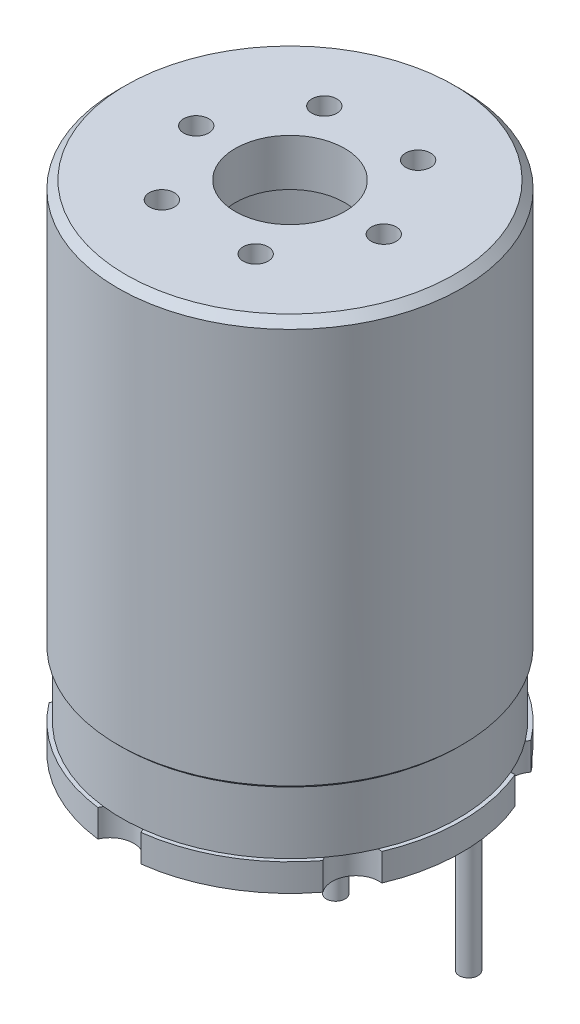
ISO-10303-21;
HEADER;
FILE_DESCRIPTION(('STEP AP214'),'2;1');
FILE_NAME('part.step','',(''),(''),'','','');
FILE_SCHEMA(('AUTOMOTIVE_DESIGN { 1 0 10303 214 1 1 1 1 }'));
ENDSEC;
DATA;
#1=APPLICATION_CONTEXT('core data for automotive mechanical design processes');
#2=APPLICATION_PROTOCOL_DEFINITION('international standard','automotive_design',2000,#1);
#3=PRODUCT_CONTEXT('',#1,'mechanical');
#4=PRODUCT('Part','Part','',(#3));
#5=PRODUCT_RELATED_PRODUCT_CATEGORY('part','',(#4));
#6=PRODUCT_DEFINITION_FORMATION('','',#4);
#7=PRODUCT_DEFINITION_CONTEXT('part definition',#1,'design');
#8=PRODUCT_DEFINITION('design','',#6,#7);
#9=PRODUCT_DEFINITION_SHAPE('','',#8);
#10=(LENGTH_UNIT() NAMED_UNIT(*) SI_UNIT(.MILLI.,.METRE.));
#11=(NAMED_UNIT(*) PLANE_ANGLE_UNIT() SI_UNIT($,.RADIAN.));
#12=(NAMED_UNIT(*) SI_UNIT($,.STERADIAN.) SOLID_ANGLE_UNIT());
#13=UNCERTAINTY_MEASURE_WITH_UNIT(LENGTH_MEASURE(1.E-05),#10,'distance_accuracy_value','');
#14=(GEOMETRIC_REPRESENTATION_CONTEXT(3) GLOBAL_UNCERTAINTY_ASSIGNED_CONTEXT((#13)) GLOBAL_UNIT_ASSIGNED_CONTEXT((#10,
#11,#12)) REPRESENTATION_CONTEXT('',''));
#15=CARTESIAN_POINT('',(0.,0.,0.));
#16=DIRECTION('',(0.,0.,1.));
#17=DIRECTION('',(1.,0.,0.));
#18=AXIS2_PLACEMENT_3D('',#15,#16,#17);
#19=CARTESIAN_POINT('',(0.,-16.4673934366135,0.));
#20=DIRECTION('',(0.,-1.,0.));
#21=DIRECTION('',(0.,0.,-1.));
#22=AXIS2_PLACEMENT_3D('',#19,#20,#21);
#23=CYLINDRICAL_SURFACE('',#22,3.5);
#24=CARTESIAN_POINT('',(0.,30.,0.));
#25=DIRECTION('',(0.,1.,0.));
#26=DIRECTION('',(0.,0.,1.));
#27=AXIS2_PLACEMENT_3D('',#24,#25,#26);
#28=CIRCLE('',#27,3.5);
#29=CARTESIAN_POINT('',(0.,30.,3.5));
#30=VERTEX_POINT('',#29);
#31=EDGE_CURVE('E1926',#30,#30,#28,.F.);
#32=ORIENTED_EDGE('',*,*,#31,.F.);
#33=EDGE_LOOP('',(#32));
#34=FACE_BOUND('',#33,.T.);
#35=CARTESIAN_POINT('',(0.,27.,0.));
#36=DIRECTION('',(0.,-1.,0.));
#37=DIRECTION('',(0.,0.,-1.));
#38=AXIS2_PLACEMENT_3D('',#35,#36,#37);
#39=CIRCLE('',#38,3.5);
#40=CARTESIAN_POINT('',(0.,27.,-3.5));
#41=VERTEX_POINT('',#40);
#42=EDGE_CURVE('E1932',#41,#41,#39,.T.);
#43=ORIENTED_EDGE('',*,*,#42,.T.);
#44=EDGE_LOOP('',(#43));
#45=FACE_BOUND('',#44,.T.);
#46=ADVANCED_FACE('F38',(#34,#45),#23,.F.);
#47=CARTESIAN_POINT('',(-3.5,27.,0.));
#48=DIRECTION('',(0.,-1.,0.));
#49=DIRECTION('',(0.,0.,-1.));
#50=AXIS2_PLACEMENT_3D('',#47,#48,#49);
#51=PLANE('',#50);
#52=CARTESIAN_POINT('',(0.,27.,0.));
#53=DIRECTION('',(0.,-1.,0.));
#54=DIRECTION('',(0.,0.,-1.));
#55=AXIS2_PLACEMENT_3D('',#52,#53,#54);
#56=CIRCLE('',#55,9.5);
#57=CARTESIAN_POINT('',(0.,27.,-9.5));
#58=VERTEX_POINT('',#57);
#59=EDGE_CURVE('E1962',#58,#58,#56,.T.);
#60=ORIENTED_EDGE('',*,*,#59,.T.);
#61=EDGE_LOOP('',(#60));
#62=FACE_BOUND('',#61,.T.);
#63=ORIENTED_EDGE('',*,*,#42,.F.);
#64=EDGE_LOOP('',(#63));
#65=FACE_BOUND('',#64,.T.);
#66=ADVANCED_FACE('F1003',(#62,#65),#51,.T.);
#67=CARTESIAN_POINT('',(0.,-16.4673934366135,0.));
#68=DIRECTION('',(0.,-1.,0.));
#69=DIRECTION('',(0.,0.,-1.));
#70=AXIS2_PLACEMENT_3D('',#67,#68,#69);
#71=CYLINDRICAL_SURFACE('',#70,9.5);
#72=CARTESIAN_POINT('',(0.,5.,0.));
#73=DIRECTION('',(0.,-1.,0.));
#74=DIRECTION('',(0.,0.,-1.));
#75=AXIS2_PLACEMENT_3D('',#72,#73,#74);
#76=CIRCLE('',#75,9.5);
#77=CARTESIAN_POINT('',(0.,5.,-9.5));
#78=VERTEX_POINT('',#77);
#79=EDGE_CURVE('E1965',#78,#78,#76,.T.);
#80=ORIENTED_EDGE('',*,*,#79,.T.);
#81=EDGE_LOOP('',(#80));
#82=FACE_BOUND('',#81,.T.);
#83=ORIENTED_EDGE('',*,*,#59,.F.);
#84=EDGE_LOOP('',(#83));
#85=FACE_BOUND('',#84,.T.);
#86=ADVANCED_FACE('F1009',(#82,#85),#71,.F.);
#87=CARTESIAN_POINT('',(-9.5,5.,0.));
#88=DIRECTION('',(0.,1.,0.));
#89=DIRECTION('',(0.,0.,1.));
#90=AXIS2_PLACEMENT_3D('',#87,#88,#89);
#91=PLANE('',#90);
#92=CARTESIAN_POINT('',(0.,5.,0.));
#93=DIRECTION('',(0.,-1.,0.));
#94=DIRECTION('',(0.,0.,-1.));
#95=AXIS2_PLACEMENT_3D('',#92,#93,#94);
#96=CIRCLE('',#95,5.);
#97=CARTESIAN_POINT('',(0.,5.,-5.));
#98=VERTEX_POINT('',#97);
#99=EDGE_CURVE('E1968',#98,#98,#96,.T.);
#100=ORIENTED_EDGE('',*,*,#99,.T.);
#101=EDGE_LOOP('',(#100));
#102=FACE_BOUND('',#101,.T.);
#103=ORIENTED_EDGE('',*,*,#79,.F.);
#104=EDGE_LOOP('',(#103));
#105=FACE_BOUND('',#104,.T.);
#106=ADVANCED_FACE('F1993',(#102,#105),#91,.T.);
#107=CARTESIAN_POINT('',(0.,-16.4673934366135,0.));
#108=DIRECTION('',(0.,-1.,0.));
#109=DIRECTION('',(0.,0.,-1.));
#110=AXIS2_PLACEMENT_3D('',#107,#108,#109);
#111=CYLINDRICAL_SURFACE('',#110,5.);
#112=CARTESIAN_POINT('',(0.,0.,0.));
#113=DIRECTION('',(0.,-1.,0.));
#114=DIRECTION('',(0.,0.,-1.));
#115=AXIS2_PLACEMENT_3D('',#112,#113,#114);
#116=CIRCLE('',#115,5.);
#117=CARTESIAN_POINT('',(0.,0.,-5.));
#118=VERTEX_POINT('',#117);
#119=EDGE_CURVE('E1971',#118,#118,#116,.T.);
#120=ORIENTED_EDGE('',*,*,#119,.T.);
#121=EDGE_LOOP('',(#120));
#122=FACE_BOUND('',#121,.T.);
#123=ORIENTED_EDGE('',*,*,#99,.F.);
#124=EDGE_LOOP('',(#123));
#125=FACE_BOUND('',#124,.T.);
#126=ADVANCED_FACE('F1987',(#122,#125),#111,.F.);
#127=CARTESIAN_POINT('',(-5.,0.,0.));
#128=DIRECTION('',(0.,1.,0.));
#129=DIRECTION('',(0.,0.,1.));
#130=AXIS2_PLACEMENT_3D('',#127,#128,#129);
#131=PLANE('',#130);
#132=CARTESIAN_POINT('',(0.,0.,0.));
#133=DIRECTION('',(0.,-1.,0.));
#134=DIRECTION('',(0.,0.,-1.));
#135=AXIS2_PLACEMENT_3D('',#132,#133,#134);
#136=CIRCLE('',#135,1.);
#137=CARTESIAN_POINT('',(0.,0.,-1.));
#138=VERTEX_POINT('',#137);
#139=EDGE_CURVE('E1974',#138,#138,#136,.T.);
#140=ORIENTED_EDGE('',*,*,#139,.T.);
#141=EDGE_LOOP('',(#140));
#142=FACE_BOUND('',#141,.T.);
#143=ORIENTED_EDGE('',*,*,#119,.F.);
#144=EDGE_LOOP('',(#143));
#145=FACE_BOUND('',#144,.T.);
#146=ADVANCED_FACE('F1978',(#142,#145),#131,.T.);
#147=CARTESIAN_POINT('',(0.,-16.4673934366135,0.));
#148=DIRECTION('',(0.,-1.,0.));
#149=DIRECTION('',(0.,0.,-1.));
#150=AXIS2_PLACEMENT_3D('',#147,#148,#149);
#151=CYLINDRICAL_SURFACE('',#150,0.999999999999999);
#152=CARTESIAN_POINT('',(0.,-1.75,0.));
#153=DIRECTION('',(0.,-1.,0.));
#154=DIRECTION('',(0.,0.,-1.));
#155=AXIS2_PLACEMENT_3D('',#152,#153,#154);
#156=CIRCLE('',#155,0.999999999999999);
#157=CARTESIAN_POINT('',(0.,-1.75,-0.999999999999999));
#158=VERTEX_POINT('',#157);
#159=EDGE_CURVE('E1928',#158,#158,#156,.F.);
#160=ORIENTED_EDGE('',*,*,#159,.F.);
#161=EDGE_LOOP('',(#160));
#162=FACE_BOUND('',#161,.T.);
#163=ORIENTED_EDGE('',*,*,#139,.F.);
#164=EDGE_LOOP('',(#163));
#165=FACE_BOUND('',#164,.T.);
#166=ADVANCED_FACE('F1857',(#162,#165),#151,.F.);
#167=CARTESIAN_POINT('',(0.,-1.75,0.));
#168=DIRECTION('',(0.,-1.,0.));
#169=DIRECTION('',(0.,0.,-1.));
#170=AXIS2_PLACEMENT_3D('',#167,#168,#169);
#171=PLANE('',#170);
#172=DIRECTION('',(-1.,0.,0.));
#173=VECTOR('',#172,1.);
#174=CARTESIAN_POINT('',(-5.6,-1.75,-6.8));
#175=LINE('',#174,#173);
#176=CARTESIAN_POINT('',(-5.8,-1.75,-6.8));
#177=VERTEX_POINT('',#176);
#178=CARTESIAN_POINT('',(-6.25,-1.75,-6.8));
#179=VERTEX_POINT('',#178);
#180=EDGE_CURVE('E1191',#177,#179,#175,.T.);
#181=ORIENTED_EDGE('',*,*,#180,.T.);
#182=DIRECTION('',(0.,0.,1.));
#183=VECTOR('',#182,1.);
#184=CARTESIAN_POINT('',(-6.25,-1.75,-6.8));
#185=LINE('',#184,#183);
#186=CARTESIAN_POINT('',(-6.25,-1.75,-3.6));
#187=VERTEX_POINT('',#186);
#188=EDGE_CURVE('E1195',#179,#187,#185,.T.);
#189=ORIENTED_EDGE('',*,*,#188,.T.);
#190=CARTESIAN_POINT('',(-2.68000000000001,-1.75,0.));
#191=DIRECTION('',(0.,1.,0.));
#192=DIRECTION('',(0.,0.,-1.));
#193=AXIS2_PLACEMENT_3D('',#190,#191,#192);
#194=CIRCLE('',#193,5.06999999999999);
#195=CARTESIAN_POINT('',(-7.75,-1.75,0.));
#196=VERTEX_POINT('',#195);
#197=EDGE_CURVE('E1198',#187,#196,#194,.T.);
#198=ORIENTED_EDGE('',*,*,#197,.T.);
#199=CARTESIAN_POINT('',(-5.6,-1.75,0.));
#200=DIRECTION('',(0.,1.,0.));
#201=DIRECTION('',(0.,0.,-1.));
#202=AXIS2_PLACEMENT_3D('',#199,#200,#201);
#203=CIRCLE('',#202,2.15);
#204=CARTESIAN_POINT('',(-7.67674052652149,-1.75,0.556460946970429));
#205=VERTEX_POINT('',#204);
#206=EDGE_CURVE('E1201',#196,#205,#203,.T.);
#207=ORIENTED_EDGE('',*,*,#206,.T.);
#208=DIRECTION('',(0.258819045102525,0.,0.965925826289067));
#209=VECTOR('',#208,1.);
#210=CARTESIAN_POINT('',(-7.67674052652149,-1.75,0.556460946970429));
#211=LINE('',#210,#209);
#212=CARTESIAN_POINT('',(-6.75404701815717,-1.75,4.));
#213=VERTEX_POINT('',#212);
#214=EDGE_CURVE('E1204',#205,#213,#211,.T.);
#215=ORIENTED_EDGE('',*,*,#214,.T.);
#216=DIRECTION('',(0.642787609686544,0.,0.766044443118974));
#217=VECTOR('',#216,1.);
#218=CARTESIAN_POINT('',(-6.75404701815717,-1.75,4.));
#219=LINE('',#218,#217);
#220=CARTESIAN_POINT('',(-3.98501823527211,-1.75,7.3));
#221=VERTEX_POINT('',#220);
#222=EDGE_CURVE('E1207',#213,#221,#219,.T.);
#223=ORIENTED_EDGE('',*,*,#222,.T.);
#224=DIRECTION('',(0.838670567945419,0.,-0.544639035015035));
#225=VECTOR('',#224,1.);
#226=CARTESIAN_POINT('',(-3.98501823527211,-1.75,7.3));
#227=LINE('',#226,#225);
#228=CARTESIAN_POINT('',(-2.5592782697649,-1.75,6.37411364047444));
#229=VERTEX_POINT('',#228);
#230=EDGE_CURVE('E1210',#221,#229,#227,.T.);
#231=ORIENTED_EDGE('',*,*,#230,.T.);
#232=DIRECTION('',(-0.438371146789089,0.,-0.898794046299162));
#233=VECTOR('',#232,1.);
#234=CARTESIAN_POINT('',(-2.5592782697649,-1.75,6.37411364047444));
#235=LINE('',#234,#233);
#236=CARTESIAN_POINT('',(-4.44771280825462,-1.75,2.50224905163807));
#237=VERTEX_POINT('',#236);
#238=EDGE_CURVE('E1213',#229,#237,#235,.T.);
#239=ORIENTED_EDGE('',*,*,#238,.T.);
#240=CARTESIAN_POINT('',(-3.8448200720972,-1.75,2.20819861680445));
#241=DIRECTION('',(0.,-1.,0.));
#242=DIRECTION('',(0.,0.,1.));
#243=AXIS2_PLACEMENT_3D('',#240,#241,#242);
#244=CIRCLE('',#243,0.670779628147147);
#245=CARTESIAN_POINT('',(-4.26220075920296,-1.75,1.68309036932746));
#246=VERTEX_POINT('',#245);
#247=EDGE_CURVE('E1216',#237,#246,#244,.T.);
#248=ORIENTED_EDGE('',*,*,#247,.T.);
#249=CARTESIAN_POINT('',(-5.6,-1.75,0.));
#250=DIRECTION('',(0.,1.,0.));
#251=DIRECTION('',(0.,0.,-1.));
#252=AXIS2_PLACEMENT_3D('',#249,#250,#251);
#253=CIRCLE('',#252,2.15);
#254=CARTESIAN_POINT('',(-3.69033206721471,-1.75,-0.987759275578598));
#255=VERTEX_POINT('',#254);
#256=EDGE_CURVE('E1219',#246,#255,#253,.T.);
#257=ORIENTED_EDGE('',*,*,#256,.T.);
#258=CARTESIAN_POINT('',(-2.7,-1.75,-1.5));
#259=DIRECTION('',(0.,-1.,0.));
#260=DIRECTION('',(0.,0.,-1.));
#261=AXIS2_PLACEMENT_3D('',#258,#259,#260);
#262=CIRCLE('',#261,1.1149655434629);
#263=CARTESIAN_POINT('',(-2.77399462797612,-1.75,-2.61250750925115));
#264=VERTEX_POINT('',#263);
#265=EDGE_CURVE('E1148',#255,#264,#262,.T.);
#266=ORIENTED_EDGE('',*,*,#265,.T.);
#267=CARTESIAN_POINT('',(-2.83967431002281,-1.75,-3.6));
#268=DIRECTION('',(0.,1.,0.));
#269=DIRECTION('',(0.,0.,1.));
#270=AXIS2_PLACEMENT_3D('',#267,#268,#269);
#271=CIRCLE('',#270,0.989674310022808);
#272=CARTESIAN_POINT('',(-1.85,-1.75,-3.6));
#273=VERTEX_POINT('',#272);
#274=EDGE_CURVE('E1143',#264,#273,#271,.T.);
#275=ORIENTED_EDGE('',*,*,#274,.T.);
#276=DIRECTION('',(0.,0.,-1.));
#277=VECTOR('',#276,1.);
#278=CARTESIAN_POINT('',(-1.85,-1.75,-3.6));
#279=LINE('',#278,#277);
#280=CARTESIAN_POINT('',(-1.85,-1.75,-6.8));
#281=VERTEX_POINT('',#280);
#282=EDGE_CURVE('E1188',#273,#281,#279,.T.);
#283=ORIENTED_EDGE('',*,*,#282,.T.);
#284=CARTESIAN_POINT('',(-2.7,-1.75,-6.8));
#285=VERTEX_POINT('',#284);
#286=EDGE_CURVE('E1192',#281,#285,#175,.T.);
#287=ORIENTED_EDGE('',*,*,#286,.T.);
#288=DIRECTION('',(1.,0.,0.));
#289=VECTOR('',#288,1.);
#290=CARTESIAN_POINT('',(-5.8,-1.75,-6.8));
#291=LINE('',#290,#289);
#292=EDGE_CURVE('E1137',#177,#285,#291,.T.);
#293=ORIENTED_EDGE('',*,*,#292,.F.);
#294=EDGE_LOOP('',(#181,#189,#198,#207,#215,#223,#231,#239,#248,#257,#266,#275,#283,#287,#293));
#295=FACE_BOUND('',#294,.T.);
#296=ORIENTED_EDGE('',*,*,#159,.T.);
#297=EDGE_LOOP('',(#296));
#298=FACE_BOUND('',#297,.T.);
#299=CARTESIAN_POINT('',(0.,-1.75,11.5));
#300=DIRECTION('',(0.,-1.,0.));
#301=DIRECTION('',(0.,0.,-1.));
#302=AXIS2_PLACEMENT_3D('',#299,#300,#301);
#303=CIRCLE('',#302,1.5);
#304=CARTESIAN_POINT('',(-1.38039198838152,-1.75,10.9130434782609));
#305=VERTEX_POINT('',#304);
#306=CARTESIAN_POINT('',(1.38039198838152,-1.75,10.9130434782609));
#307=VERTEX_POINT('',#306);
#308=EDGE_CURVE('E3140',#305,#307,#303,.T.);
#309=ORIENTED_EDGE('',*,*,#308,.F.);
#310=CARTESIAN_POINT('',(0.,-1.75,0.));
#311=DIRECTION('',(0.,-1.,0.));
#312=DIRECTION('',(0.,0.,-1.));
#313=AXIS2_PLACEMENT_3D('',#310,#311,#312);
#314=CIRCLE('',#313,11.);
#315=CARTESIAN_POINT('',(-8.76077689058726,-1.75,6.65197626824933));
#316=VERTEX_POINT('',#315);
#317=EDGE_CURVE('E1662',#316,#305,#314,.F.);
#318=ORIENTED_EDGE('',*,*,#317,.F.);
#319=CARTESIAN_POINT('',(-9.95929214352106,-1.75,5.74999999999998));
#320=DIRECTION('',(0.,-1.,0.));
#321=DIRECTION('',(0.86602540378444,0.,-0.499999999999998));
#322=AXIS2_PLACEMENT_3D('',#319,#320,#321);
#323=CIRCLE('',#322,1.5);
#324=CARTESIAN_POINT('',(-10.1411688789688,-1.75,4.2610672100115));
#325=VERTEX_POINT('',#324);
#326=EDGE_CURVE('E1742',#325,#316,#323,.T.);
#327=ORIENTED_EDGE('',*,*,#326,.F.);
#328=CARTESIAN_POINT('',(-10.1411688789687,-1.75,-4.26106721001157));
#329=VERTEX_POINT('',#328);
#330=EDGE_CURVE('E1660',#329,#325,#314,.F.);
#331=ORIENTED_EDGE('',*,*,#330,.F.);
#332=CARTESIAN_POINT('',(-9.95929214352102,-1.75,-5.75000000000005));
#333=DIRECTION('',(0.,-1.,0.));
#334=DIRECTION('',(0.866025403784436,0.,0.500000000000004));
#335=AXIS2_PLACEMENT_3D('',#332,#333,#334);
#336=CIRCLE('',#335,1.5);
#337=CARTESIAN_POINT('',(-8.76077689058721,-1.75,-6.65197626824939));
#338=VERTEX_POINT('',#337);
#339=EDGE_CURVE('E1726',#338,#329,#336,.T.);
#340=ORIENTED_EDGE('',*,*,#339,.F.);
#341=CARTESIAN_POINT('',(-8.48528137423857,-1.75,-7.));
#342=VERTEX_POINT('',#341);
#343=EDGE_CURVE('E1650',#342,#338,#314,.F.);
#344=ORIENTED_EDGE('',*,*,#343,.F.);
#345=DIRECTION('',(1.,0.,0.));
#346=VECTOR('',#345,1.);
#347=CARTESIAN_POINT('',(-8.48528137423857,-1.75,-7.));
#348=LINE('',#347,#346);
#349=CARTESIAN_POINT('',(-3.,-1.75,-7.));
#350=VERTEX_POINT('',#349);
#351=EDGE_CURVE('E2990',#342,#350,#348,.T.);
#352=ORIENTED_EDGE('',*,*,#351,.T.);
#353=CARTESIAN_POINT('',(0.,-1.75,-7.));
#354=DIRECTION('',(0.,-1.,0.));
#355=DIRECTION('',(0.,0.,-1.));
#356=AXIS2_PLACEMENT_3D('',#353,#354,#355);
#357=CIRCLE('',#356,3.);
#358=CARTESIAN_POINT('',(3.,-1.75,-7.));
#359=VERTEX_POINT('',#358);
#360=EDGE_CURVE('E1771',#350,#359,#357,.T.);
#361=ORIENTED_EDGE('',*,*,#360,.T.);
#362=DIRECTION('',(1.,0.,0.));
#363=VECTOR('',#362,1.);
#364=CARTESIAN_POINT('',(-8.48528137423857,-1.75,-7.));
#365=LINE('',#364,#363);
#366=CARTESIAN_POINT('',(8.48528137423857,-1.75,-7.));
#367=VERTEX_POINT('',#366);
#368=EDGE_CURVE('E1684',#359,#367,#365,.T.);
#369=ORIENTED_EDGE('',*,*,#368,.T.);
#370=CARTESIAN_POINT('',(8.7607768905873,-1.75,-6.65197626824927));
#371=VERTEX_POINT('',#370);
#372=EDGE_CURVE('E1647',#371,#367,#314,.F.);
#373=ORIENTED_EDGE('',*,*,#372,.F.);
#374=CARTESIAN_POINT('',(9.9592921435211,-1.75,-5.74999999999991));
#375=DIRECTION('',(0.,-1.,0.));
#376=DIRECTION('',(0.,0.,-1.));
#377=AXIS2_PLACEMENT_3D('',#374,#375,#376);
#378=CIRCLE('',#377,1.5);
#379=CARTESIAN_POINT('',(10.1411688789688,-1.75,-4.26106721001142));
#380=VERTEX_POINT('',#379);
#381=EDGE_CURVE('E3017',#380,#371,#378,.T.);
#382=ORIENTED_EDGE('',*,*,#381,.F.);
#383=CARTESIAN_POINT('',(10.1411688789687,-1.75,4.26106721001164));
#384=VERTEX_POINT('',#383);
#385=EDGE_CURVE('E1666',#384,#380,#314,.F.);
#386=ORIENTED_EDGE('',*,*,#385,.F.);
#387=CARTESIAN_POINT('',(9.95929214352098,-1.75,5.75000000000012));
#388=DIRECTION('',(0.,-1.,0.));
#389=DIRECTION('',(0.,0.,-1.));
#390=AXIS2_PLACEMENT_3D('',#387,#388,#389);
#391=CIRCLE('',#390,1.5);
#392=CARTESIAN_POINT('',(8.76077689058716,-1.75,6.65197626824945));
#393=VERTEX_POINT('',#392);
#394=EDGE_CURVE('E3014',#393,#384,#391,.T.);
#395=ORIENTED_EDGE('',*,*,#394,.F.);
#396=EDGE_CURVE('E1664',#307,#393,#314,.F.);
#397=ORIENTED_EDGE('',*,*,#396,.F.);
#398=EDGE_LOOP('',(#309,#318,#327,#331,#340,#344,#352,#361,#369,#373,#382,#386,#395,#397));
#399=FACE_BOUND('',#398,.T.);
#400=DIRECTION('',(0.,0.,-1.));
#401=VECTOR('',#400,1.);
#402=CARTESIAN_POINT('',(1.85,-1.75,-3.6));
#403=LINE('',#402,#401);
#404=CARTESIAN_POINT('',(1.85,-1.75,-3.6));
#405=VERTEX_POINT('',#404);
#406=CARTESIAN_POINT('',(1.85,-1.75,-6.8));
#407=VERTEX_POINT('',#406);
#408=EDGE_CURVE('E1585',#405,#407,#403,.T.);
#409=ORIENTED_EDGE('',*,*,#408,.F.);
#410=CARTESIAN_POINT('',(2.83967431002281,-1.75,-3.6));
#411=DIRECTION('',(0.,-1.,0.));
#412=DIRECTION('',(0.,0.,1.));
#413=AXIS2_PLACEMENT_3D('',#410,#411,#412);
#414=CIRCLE('',#413,0.989674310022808);
#415=CARTESIAN_POINT('',(2.77399462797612,-1.75,-2.61250750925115));
#416=VERTEX_POINT('',#415);
#417=EDGE_CURVE('E1551',#416,#405,#414,.T.);
#418=ORIENTED_EDGE('',*,*,#417,.F.);
#419=CARTESIAN_POINT('',(2.7,-1.75,-1.5));
#420=DIRECTION('',(0.,1.,0.));
#421=DIRECTION('',(0.,0.,-1.));
#422=AXIS2_PLACEMENT_3D('',#419,#420,#421);
#423=CIRCLE('',#422,1.1149655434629);
#424=CARTESIAN_POINT('',(3.69033206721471,-1.75,-0.987759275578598));
#425=VERTEX_POINT('',#424);
#426=EDGE_CURVE('E1556',#425,#416,#423,.T.);
#427=ORIENTED_EDGE('',*,*,#426,.F.);
#428=CARTESIAN_POINT('',(5.6,-1.75,0.));
#429=DIRECTION('',(0.,-1.,0.));
#430=DIRECTION('',(0.,0.,-1.));
#431=AXIS2_PLACEMENT_3D('',#428,#429,#430);
#432=CIRCLE('',#431,2.15);
#433=CARTESIAN_POINT('',(4.26220075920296,-1.75,1.68309036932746));
#434=VERTEX_POINT('',#433);
#435=EDGE_CURVE('E1607',#434,#425,#432,.T.);
#436=ORIENTED_EDGE('',*,*,#435,.F.);
#437=CARTESIAN_POINT('',(3.8448200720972,-1.75,2.20819861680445));
#438=DIRECTION('',(0.,1.,0.));
#439=DIRECTION('',(0.,0.,1.));
#440=AXIS2_PLACEMENT_3D('',#437,#438,#439);
#441=CIRCLE('',#440,0.670779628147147);
#442=CARTESIAN_POINT('',(4.44771280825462,-1.75,2.50224905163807));
#443=VERTEX_POINT('',#442);
#444=EDGE_CURVE('E1605',#443,#434,#441,.T.);
#445=ORIENTED_EDGE('',*,*,#444,.F.);
#446=DIRECTION('',(0.438371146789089,0.,-0.898794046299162));
#447=VECTOR('',#446,1.);
#448=CARTESIAN_POINT('',(2.5592782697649,-1.75,6.37411364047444));
#449=LINE('',#448,#447);
#450=CARTESIAN_POINT('',(2.5592782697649,-1.75,6.37411364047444));
#451=VERTEX_POINT('',#450);
#452=EDGE_CURVE('E1603',#451,#443,#449,.T.);
#453=ORIENTED_EDGE('',*,*,#452,.F.);
#454=DIRECTION('',(-0.838670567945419,0.,-0.544639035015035));
#455=VECTOR('',#454,1.);
#456=CARTESIAN_POINT('',(3.98501823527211,-1.75,7.3));
#457=LINE('',#456,#455);
#458=CARTESIAN_POINT('',(3.98501823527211,-1.75,7.3));
#459=VERTEX_POINT('',#458);
#460=EDGE_CURVE('E1601',#459,#451,#457,.T.);
#461=ORIENTED_EDGE('',*,*,#460,.F.);
#462=DIRECTION('',(-0.642787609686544,0.,0.766044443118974));
#463=VECTOR('',#462,1.);
#464=CARTESIAN_POINT('',(6.75404701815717,-1.75,4.));
#465=LINE('',#464,#463);
#466=CARTESIAN_POINT('',(6.75404701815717,-1.75,4.));
#467=VERTEX_POINT('',#466);
#468=EDGE_CURVE('E1599',#467,#459,#465,.T.);
#469=ORIENTED_EDGE('',*,*,#468,.F.);
#470=DIRECTION('',(-0.258819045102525,0.,0.965925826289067));
#471=VECTOR('',#470,1.);
#472=CARTESIAN_POINT('',(7.67674052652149,-1.75,0.556460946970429));
#473=LINE('',#472,#471);
#474=CARTESIAN_POINT('',(7.67674052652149,-1.75,0.556460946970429));
#475=VERTEX_POINT('',#474);
#476=EDGE_CURVE('E1597',#475,#467,#473,.T.);
#477=ORIENTED_EDGE('',*,*,#476,.F.);
#478=CARTESIAN_POINT('',(5.6,-1.75,0.));
#479=DIRECTION('',(0.,-1.,0.));
#480=DIRECTION('',(0.,0.,-1.));
#481=AXIS2_PLACEMENT_3D('',#478,#479,#480);
#482=CIRCLE('',#481,2.15);
#483=CARTESIAN_POINT('',(7.75,-1.75,0.));
#484=VERTEX_POINT('',#483);
#485=EDGE_CURVE('E1595',#484,#475,#482,.T.);
#486=ORIENTED_EDGE('',*,*,#485,.F.);
#487=CARTESIAN_POINT('',(2.68000000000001,-1.75,0.));
#488=DIRECTION('',(0.,-1.,0.));
#489=DIRECTION('',(0.,0.,-1.));
#490=AXIS2_PLACEMENT_3D('',#487,#488,#489);
#491=CIRCLE('',#490,5.06999999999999);
#492=CARTESIAN_POINT('',(6.25,-1.75,-3.6));
#493=VERTEX_POINT('',#492);
#494=EDGE_CURVE('E1593',#493,#484,#491,.T.);
#495=ORIENTED_EDGE('',*,*,#494,.F.);
#496=DIRECTION('',(0.,0.,1.));
#497=VECTOR('',#496,1.);
#498=CARTESIAN_POINT('',(6.25,-1.75,-6.8));
#499=LINE('',#498,#497);
#500=CARTESIAN_POINT('',(6.25,-1.75,-6.8));
#501=VERTEX_POINT('',#500);
#502=EDGE_CURVE('E1591',#501,#493,#499,.T.);
#503=ORIENTED_EDGE('',*,*,#502,.F.);
#504=DIRECTION('',(1.,0.,0.));
#505=VECTOR('',#504,1.);
#506=CARTESIAN_POINT('',(5.6,-1.75,-6.8));
#507=LINE('',#506,#505);
#508=CARTESIAN_POINT('',(5.8,-1.75,-6.8));
#509=VERTEX_POINT('',#508);
#510=EDGE_CURVE('E1587',#509,#501,#507,.T.);
#511=ORIENTED_EDGE('',*,*,#510,.F.);
#512=DIRECTION('',(-1.,0.,0.));
#513=VECTOR('',#512,1.);
#514=CARTESIAN_POINT('',(5.8,-1.75,-6.8));
#515=LINE('',#514,#513);
#516=CARTESIAN_POINT('',(2.7,-1.75,-6.8));
#517=VERTEX_POINT('',#516);
#518=EDGE_CURVE('E1545',#509,#517,#515,.T.);
#519=ORIENTED_EDGE('',*,*,#518,.T.);
#520=EDGE_CURVE('E1588',#407,#517,#507,.T.);
#521=ORIENTED_EDGE('',*,*,#520,.F.);
#522=EDGE_LOOP('',(#409,#418,#427,#436,#445,#453,#461,#469,#477,#486,#495,#503,#511,#519,#521));
#523=FACE_BOUND('',#522,.T.);
#524=DIRECTION('',(0.,0.,1.));
#525=VECTOR('',#524,1.);
#526=CARTESIAN_POINT('',(6.49198753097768,-1.75,-5.09723803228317));
#527=LINE('',#526,#525);
#528=CARTESIAN_POINT('',(6.49198753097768,-1.75,-5.09723803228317));
#529=VERTEX_POINT('',#528);
#530=CARTESIAN_POINT('',(6.49198753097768,-1.75,-4.85979145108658));
#531=VERTEX_POINT('',#530);
#532=EDGE_CURVE('E645',#529,#531,#527,.T.);
#533=ORIENTED_EDGE('',*,*,#532,.T.);
#534=DIRECTION('',(1.,0.,0.));
#535=VECTOR('',#534,1.);
#536=CARTESIAN_POINT('',(6.49198753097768,-1.75,-4.85979145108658));
#537=LINE('',#536,#535);
#538=CARTESIAN_POINT('',(7.2721691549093,-1.75,-4.85979145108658));
#539=VERTEX_POINT('',#538);
#540=EDGE_CURVE('E54',#531,#539,#537,.T.);
#541=ORIENTED_EDGE('',*,*,#540,.T.);
#542=DIRECTION('',(0.,0.,1.));
#543=VECTOR('',#542,1.);
#544=CARTESIAN_POINT('',(7.2721691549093,-1.75,-4.85979145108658));
#545=LINE('',#544,#543);
#546=CARTESIAN_POINT('',(7.2721691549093,-1.75,-4.07960982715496));
#547=VERTEX_POINT('',#546);
#548=EDGE_CURVE('E649',#539,#547,#545,.T.);
#549=ORIENTED_EDGE('',*,*,#548,.T.);
#550=DIRECTION('',(1.,0.,0.));
#551=VECTOR('',#550,1.);
#552=CARTESIAN_POINT('',(7.2721691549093,-1.75,-4.07960982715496));
#553=LINE('',#552,#551);
#554=CARTESIAN_POINT('',(7.50961573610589,-1.75,-4.07960982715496));
#555=VERTEX_POINT('',#554);
#556=EDGE_CURVE('E1891',#547,#555,#553,.T.);
#557=ORIENTED_EDGE('',*,*,#556,.T.);
#558=DIRECTION('',(0.,0.,-1.));
#559=VECTOR('',#558,1.);
#560=CARTESIAN_POINT('',(7.50961573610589,-1.75,-4.07960982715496));
#561=LINE('',#560,#559);
#562=CARTESIAN_POINT('',(7.50961573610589,-1.75,-4.85979145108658));
#563=VERTEX_POINT('',#562);
#564=EDGE_CURVE('E1893',#555,#563,#561,.T.);
#565=ORIENTED_EDGE('',*,*,#564,.T.);
#566=DIRECTION('',(1.,0.,0.));
#567=VECTOR('',#566,1.);
#568=CARTESIAN_POINT('',(7.50961573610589,-1.75,-4.85979145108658));
#569=LINE('',#568,#567);
#570=CARTESIAN_POINT('',(8.28979736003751,-1.75,-4.85979145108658));
#571=VERTEX_POINT('',#570);
#572=EDGE_CURVE('E1897',#563,#571,#569,.T.);
#573=ORIENTED_EDGE('',*,*,#572,.T.);
#574=DIRECTION('',(0.,0.,-1.));
#575=VECTOR('',#574,1.);
#576=CARTESIAN_POINT('',(8.28979736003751,-1.75,-4.85979145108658));
#577=LINE('',#576,#575);
#578=CARTESIAN_POINT('',(8.28979736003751,-1.75,-5.09723803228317));
#579=VERTEX_POINT('',#578);
#580=EDGE_CURVE('E1904',#571,#579,#577,.T.);
#581=ORIENTED_EDGE('',*,*,#580,.T.);
#582=DIRECTION('',(-1.,0.,0.));
#583=VECTOR('',#582,1.);
#584=CARTESIAN_POINT('',(8.28979736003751,-1.75,-5.09723803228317));
#585=LINE('',#584,#583);
#586=CARTESIAN_POINT('',(7.50961573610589,-1.75,-5.09723803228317));
#587=VERTEX_POINT('',#586);
#588=EDGE_CURVE('E1907',#579,#587,#585,.T.);
#589=ORIENTED_EDGE('',*,*,#588,.T.);
#590=DIRECTION('',(0.,0.,-1.));
#591=VECTOR('',#590,1.);
#592=CARTESIAN_POINT('',(7.50961573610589,-1.75,-5.09723803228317));
#593=LINE('',#592,#591);
#594=CARTESIAN_POINT('',(7.50961573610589,-1.75,-5.87741965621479));
#595=VERTEX_POINT('',#594);
#596=EDGE_CURVE('E1910',#587,#595,#593,.T.);
#597=ORIENTED_EDGE('',*,*,#596,.T.);
#598=DIRECTION('',(-1.,0.,0.));
#599=VECTOR('',#598,1.);
#600=CARTESIAN_POINT('',(7.50961573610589,-1.75,-5.87741965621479));
#601=LINE('',#600,#599);
#602=CARTESIAN_POINT('',(7.2721691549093,-1.75,-5.87741965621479));
#603=VERTEX_POINT('',#602);
#604=EDGE_CURVE('E1913',#595,#603,#601,.T.);
#605=ORIENTED_EDGE('',*,*,#604,.T.);
#606=DIRECTION('',(0.,0.,1.));
#607=VECTOR('',#606,1.);
#608=CARTESIAN_POINT('',(7.2721691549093,-1.75,-5.87741965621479));
#609=LINE('',#608,#607);
#610=CARTESIAN_POINT('',(7.2721691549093,-1.75,-5.09723803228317));
#611=VERTEX_POINT('',#610);
#612=EDGE_CURVE('E1866',#603,#611,#609,.T.);
#613=ORIENTED_EDGE('',*,*,#612,.T.);
#614=DIRECTION('',(-1.,0.,0.));
#615=VECTOR('',#614,1.);
#616=CARTESIAN_POINT('',(7.2721691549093,-1.75,-5.09723803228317));
#617=LINE('',#616,#615);
#618=EDGE_CURVE('E1863',#611,#529,#617,.T.);
#619=ORIENTED_EDGE('',*,*,#618,.T.);
#620=EDGE_LOOP('',(#533,#541,#549,#557,#565,#573,#581,#589,#597,#605,#613,#619));
#621=FACE_BOUND('',#620,.T.);
#622=ADVANCED_FACE('F920',(#295,#298,#399,#523,#621),#171,.T.);
#623=CARTESIAN_POINT('',(5.8,-5.25,-7.05));
#624=DIRECTION('',(0.,0.,-1.));
#625=DIRECTION('',(-1.,0.,0.));
#626=AXIS2_PLACEMENT_3D('',#623,#624,#625);
#627=PLANE('',#626);
#628=DIRECTION('',(0.,1.,0.));
#629=VECTOR('',#628,1.);
#630=CARTESIAN_POINT('',(3.66316527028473,-15.25,-7.05));
#631=LINE('',#630,#629);
#632=CARTESIAN_POINT('',(3.66316527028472,-4.39371407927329,-7.05));
#633=VERTEX_POINT('',#632);
#634=CARTESIAN_POINT('',(3.66316527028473,-5.15064573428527,-7.05));
#635=VERTEX_POINT('',#634);
#636=EDGE_CURVE('E749',#633,#635,#631,.F.);
#637=ORIENTED_EDGE('',*,*,#636,.F.);
#638=CARTESIAN_POINT('',(4.25,-3.85,-7.05));
#639=DIRECTION('',(0.,0.,-1.));
#640=DIRECTION('',(-1.,0.,0.));
#641=AXIS2_PLACEMENT_3D('',#638,#639,#640);
#642=CIRCLE('',#641,0.8);
#643=CARTESIAN_POINT('',(3.66316527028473,-3.30628592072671,-7.05));
#644=VERTEX_POINT('',#643);
#645=EDGE_CURVE('E1472',#633,#644,#642,.T.);
#646=ORIENTED_EDGE('',*,*,#645,.T.);
#647=CARTESIAN_POINT('',(3.66316527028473,-3.25,-7.05));
#648=VERTEX_POINT('',#647);
#649=EDGE_CURVE('E750',#648,#644,#631,.F.);
#650=ORIENTED_EDGE('',*,*,#649,.F.);
#651=DIRECTION('',(-1.,0.,0.));
#652=VECTOR('',#651,1.);
#653=CARTESIAN_POINT('',(5.8,-3.25,-7.05));
#654=LINE('',#653,#652);
#655=CARTESIAN_POINT('',(3.72084973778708,-3.25,-7.05));
#656=VERTEX_POINT('',#655);
#657=EDGE_CURVE('E1454',#656,#648,#654,.T.);
#658=ORIENTED_EDGE('',*,*,#657,.F.);
#659=CARTESIAN_POINT('',(4.77915026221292,-3.25,-7.05));
#660=VERTEX_POINT('',#659);
#661=EDGE_CURVE('E1512',#656,#660,#642,.T.);
#662=ORIENTED_EDGE('',*,*,#661,.T.);
#663=CARTESIAN_POINT('',(4.83683472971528,-3.25,-7.05));
#664=VERTEX_POINT('',#663);
#665=EDGE_CURVE('E1450',#664,#660,#654,.T.);
#666=ORIENTED_EDGE('',*,*,#665,.F.);
#667=DIRECTION('',(0.,1.,0.));
#668=VECTOR('',#667,1.);
#669=CARTESIAN_POINT('',(4.83683472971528,-15.25,-7.05));
#670=LINE('',#669,#668);
#671=CARTESIAN_POINT('',(4.83683472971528,-3.30628592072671,-7.05));
#672=VERTEX_POINT('',#671);
#673=EDGE_CURVE('E1457',#672,#664,#670,.T.);
#674=ORIENTED_EDGE('',*,*,#673,.F.);
#675=CARTESIAN_POINT('',(4.83683472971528,-4.39371407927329,-7.05));
#676=VERTEX_POINT('',#675);
#677=EDGE_CURVE('E1508',#672,#676,#642,.T.);
#678=ORIENTED_EDGE('',*,*,#677,.T.);
#679=CARTESIAN_POINT('',(4.83683472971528,-5.15064573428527,-7.05));
#680=VERTEX_POINT('',#679);
#681=EDGE_CURVE('E758',#680,#676,#670,.T.);
#682=ORIENTED_EDGE('',*,*,#681,.F.);
#683=CARTESIAN_POINT('',(4.3,-3.75,-7.05));
#684=DIRECTION('',(0.,0.,-1.));
#685=DIRECTION('',(-1.,0.,0.));
#686=AXIS2_PLACEMENT_3D('',#683,#684,#685);
#687=CIRCLE('',#686,1.5);
#688=CARTESIAN_POINT('',(5.8,-3.75,-7.05));
#689=VERTEX_POINT('',#688);
#690=EDGE_CURVE('E1481',#680,#689,#687,.F.);
#691=ORIENTED_EDGE('',*,*,#690,.T.);
#692=DIRECTION('',(0.,-1.,0.));
#693=VECTOR('',#692,1.);
#694=CARTESIAN_POINT('',(5.8,-5.25,-7.05));
#695=LINE('',#694,#693);
#696=CARTESIAN_POINT('',(5.8,-2.25,-7.05));
#697=VERTEX_POINT('',#696);
#698=EDGE_CURVE('E1524',#697,#689,#695,.T.);
#699=ORIENTED_EDGE('',*,*,#698,.F.);
#700=DIRECTION('',(-1.,0.,0.));
#701=VECTOR('',#700,1.);
#702=CARTESIAN_POINT('',(5.8,-2.25,-7.05));
#703=LINE('',#702,#701);
#704=CARTESIAN_POINT('',(2.7,-2.25,-7.05));
#705=VERTEX_POINT('',#704);
#706=EDGE_CURVE('E1540',#697,#705,#703,.T.);
#707=ORIENTED_EDGE('',*,*,#706,.T.);
#708=DIRECTION('',(0.,-1.,0.));
#709=VECTOR('',#708,1.);
#710=CARTESIAN_POINT('',(2.7,-5.25,-7.05));
#711=LINE('',#710,#709);
#712=CARTESIAN_POINT('',(2.7,-3.75,-7.05));
#713=VERTEX_POINT('',#712);
#714=EDGE_CURVE('E1478',#705,#713,#711,.T.);
#715=ORIENTED_EDGE('',*,*,#714,.T.);
#716=CARTESIAN_POINT('',(4.2,-3.75,-7.05));
#717=DIRECTION('',(0.,0.,-1.));
#718=DIRECTION('',(-1.,0.,0.));
#719=AXIS2_PLACEMENT_3D('',#716,#717,#718);
#720=CIRCLE('',#719,1.5);
#721=EDGE_CURVE('E1475',#713,#635,#720,.F.);
#722=ORIENTED_EDGE('',*,*,#721,.T.);
#723=EDGE_LOOP('',(#637,#646,#650,#658,#662,#666,#674,#678,#682,#691,#699,#707,#715,#722));
#724=FACE_BOUND('',#723,.T.);
#725=ADVANCED_FACE('F988',(#724),#627,.F.);
#726=CARTESIAN_POINT('',(5.8,-2.25,-7.3));
#727=DIRECTION('',(0.,0.,1.));
#728=DIRECTION('',(1.,0.,0.));
#729=AXIS2_PLACEMENT_3D('',#726,#727,#728);
#730=PLANE('',#729);
#731=DIRECTION('',(0.,1.,0.));
#732=VECTOR('',#731,1.);
#733=CARTESIAN_POINT('',(4.83683472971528,-15.25,-7.3));
#734=LINE('',#733,#732);
#735=CARTESIAN_POINT('',(4.83683472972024,-4.39371407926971,-7.2999999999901));
#736=VERTEX_POINT('',#735);
#737=CARTESIAN_POINT('',(4.83683472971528,-5.15064573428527,-7.3));
#738=VERTEX_POINT('',#737);
#739=EDGE_CURVE('E748',#736,#738,#734,.F.);
#740=ORIENTED_EDGE('',*,*,#739,.F.);
#741=CARTESIAN_POINT('',(4.25,-3.85,-7.3));
#742=DIRECTION('',(0.,0.,-1.));
#743=DIRECTION('',(-1.,0.,0.));
#744=AXIS2_PLACEMENT_3D('',#741,#742,#743);
#745=CIRCLE('',#744,0.8);
#746=CARTESIAN_POINT('',(4.83683472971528,-3.30628592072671,-7.3));
#747=VERTEX_POINT('',#746);
#748=EDGE_CURVE('E1510',#747,#736,#745,.T.);
#749=ORIENTED_EDGE('',*,*,#748,.F.);
#750=CARTESIAN_POINT('',(4.83683472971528,-3.25,-7.3));
#751=VERTEX_POINT('',#750);
#752=EDGE_CURVE('E1455',#751,#747,#734,.F.);
#753=ORIENTED_EDGE('',*,*,#752,.F.);
#754=DIRECTION('',(1.,0.,0.));
#755=VECTOR('',#754,1.);
#756=CARTESIAN_POINT('',(5.8,-3.25,-7.3));
#757=LINE('',#756,#755);
#758=CARTESIAN_POINT('',(4.77915026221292,-3.25,-7.3));
#759=VERTEX_POINT('',#758);
#760=EDGE_CURVE('E1447',#759,#751,#757,.T.);
#761=ORIENTED_EDGE('',*,*,#760,.F.);
#762=CARTESIAN_POINT('',(3.72084973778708,-3.25,-7.3));
#763=VERTEX_POINT('',#762);
#764=EDGE_CURVE('E1515',#763,#759,#745,.T.);
#765=ORIENTED_EDGE('',*,*,#764,.F.);
#766=CARTESIAN_POINT('',(3.66316527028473,-3.25,-7.3));
#767=VERTEX_POINT('',#766);
#768=EDGE_CURVE('E1451',#767,#763,#757,.T.);
#769=ORIENTED_EDGE('',*,*,#768,.F.);
#770=DIRECTION('',(0.,1.,0.));
#771=VECTOR('',#770,1.);
#772=CARTESIAN_POINT('',(3.66316527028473,-15.25,-7.3));
#773=LINE('',#772,#771);
#774=CARTESIAN_POINT('',(3.66316527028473,-3.30628592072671,-7.3));
#775=VERTEX_POINT('',#774);
#776=EDGE_CURVE('E1459',#775,#767,#773,.T.);
#777=ORIENTED_EDGE('',*,*,#776,.F.);
#778=CARTESIAN_POINT('',(3.66316527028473,-4.39371407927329,-7.3));
#779=VERTEX_POINT('',#778);
#780=EDGE_CURVE('E757',#779,#775,#745,.T.);
#781=ORIENTED_EDGE('',*,*,#780,.F.);
#782=CARTESIAN_POINT('',(3.66316527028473,-5.15064573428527,-7.3));
#783=VERTEX_POINT('',#782);
#784=EDGE_CURVE('E1460',#783,#779,#773,.T.);
#785=ORIENTED_EDGE('',*,*,#784,.F.);
#786=CARTESIAN_POINT('',(4.2,-3.75,-7.3));
#787=DIRECTION('',(0.,0.,1.));
#788=DIRECTION('',(1.,0.,0.));
#789=AXIS2_PLACEMENT_3D('',#786,#787,#788);
#790=CIRCLE('',#789,1.5);
#791=CARTESIAN_POINT('',(2.7,-3.75,-7.3));
#792=VERTEX_POINT('',#791);
#793=EDGE_CURVE('E1487',#783,#792,#790,.F.);
#794=ORIENTED_EDGE('',*,*,#793,.T.);
#795=DIRECTION('',(0.,1.,0.));
#796=VECTOR('',#795,1.);
#797=CARTESIAN_POINT('',(2.7,-2.25,-7.3));
#798=LINE('',#797,#796);
#799=CARTESIAN_POINT('',(2.7,-2.25,-7.3));
#800=VERTEX_POINT('',#799);
#801=EDGE_CURVE('E1520',#792,#800,#798,.T.);
#802=ORIENTED_EDGE('',*,*,#801,.T.);
#803=DIRECTION('',(-1.,0.,0.));
#804=VECTOR('',#803,1.);
#805=CARTESIAN_POINT('',(5.8,-2.25,-7.3));
#806=LINE('',#805,#804);
#807=CARTESIAN_POINT('',(5.8,-2.25,-7.3));
#808=VERTEX_POINT('',#807);
#809=EDGE_CURVE('E1528',#808,#800,#806,.T.);
#810=ORIENTED_EDGE('',*,*,#809,.F.);
#811=DIRECTION('',(0.,1.,0.));
#812=VECTOR('',#811,1.);
#813=CARTESIAN_POINT('',(5.8,-2.25,-7.3));
#814=LINE('',#813,#812);
#815=CARTESIAN_POINT('',(5.8,-3.75,-7.3));
#816=VERTEX_POINT('',#815);
#817=EDGE_CURVE('E1526',#816,#808,#814,.T.);
#818=ORIENTED_EDGE('',*,*,#817,.F.);
#819=CARTESIAN_POINT('',(4.3,-3.75,-7.3));
#820=DIRECTION('',(0.,0.,1.));
#821=DIRECTION('',(1.,0.,0.));
#822=AXIS2_PLACEMENT_3D('',#819,#820,#821);
#823=CIRCLE('',#822,1.5);
#824=EDGE_CURVE('E1482',#816,#738,#823,.F.);
#825=ORIENTED_EDGE('',*,*,#824,.T.);
#826=EDGE_LOOP('',(#740,#749,#753,#761,#765,#769,#777,#781,#785,#794,#802,#810,#818,#825));
#827=FACE_BOUND('',#826,.T.);
#828=ADVANCED_FACE('F764',(#827),#730,.F.);
#829=CARTESIAN_POINT('',(4.3,-3.75,-6.8));
#830=DIRECTION('',(0.,0.,-1.));
#831=DIRECTION('',(-1.,0.,0.));
#832=AXIS2_PLACEMENT_3D('',#829,#830,#831);
#833=CYLINDRICAL_SURFACE('',#832,1.5);
#834=ORIENTED_EDGE('',*,*,#690,.F.);
#835=CARTESIAN_POINT('',(4.83683472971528,-5.15064573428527,-7.05));
#836=CARTESIAN_POINT('',(4.8401474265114,-5.14937518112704,-7.06555432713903));
#837=CARTESIAN_POINT('',(4.84284417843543,-5.14832942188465,-7.08125155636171));
#838=CARTESIAN_POINT('',(4.84698403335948,-5.14671520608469,-7.11283556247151));
#839=CARTESIAN_POINT('',(4.84842705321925,-5.14614678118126,-7.12872235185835));
#840=CARTESIAN_POINT('',(4.85081089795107,-5.14521162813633,-7.17589744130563));
#841=CARTESIAN_POINT('',(4.84993660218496,-5.14556362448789,-7.20731549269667));
#842=CARTESIAN_POINT('',(4.8444427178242,-5.14770430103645,-7.25913381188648));
#843=CARTESIAN_POINT('',(4.84117175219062,-5.14897379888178,-7.27970877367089));
#844=CARTESIAN_POINT('',(4.83683472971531,-5.15064573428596,-7.29999999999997));
#845=B_SPLINE_CURVE_WITH_KNOTS('',3,(#835,#836,#837,#838,#839,#840,#841,#842,#843,#844),
.UNSPECIFIED.,.F.,.F.,(4,2,2,2,4),(0.,0.0478338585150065,0.0956708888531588,0.189477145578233,
0.251948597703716),.UNSPECIFIED.);
#846=EDGE_CURVE('E752',#680,#738,#845,.T.);
#847=ORIENTED_EDGE('',*,*,#846,.T.);
#848=ORIENTED_EDGE('',*,*,#824,.F.);
#849=DIRECTION('',(0.,0.,-1.));
#850=VECTOR('',#849,1.);
#851=CARTESIAN_POINT('',(5.8,-3.75,-6.8));
#852=LINE('',#851,#850);
#853=EDGE_CURVE('E1776',#689,#816,#852,.T.);
#854=ORIENTED_EDGE('',*,*,#853,.F.);
#855=EDGE_LOOP('',(#834,#847,#848,#854));
#856=FACE_BOUND('',#855,.T.);
#857=ADVANCED_FACE('F760',(#856),#833,.T.);
#858=CARTESIAN_POINT('',(4.2,-3.75,-7.3));
#859=DIRECTION('',(0.,0.,1.));
#860=DIRECTION('',(1.,0.,0.));
#861=AXIS2_PLACEMENT_3D('',#858,#859,#860);
#862=CYLINDRICAL_SURFACE('',#861,1.5);
#863=ORIENTED_EDGE('',*,*,#793,.F.);
#864=CARTESIAN_POINT('',(3.66316527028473,-5.15064573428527,-7.3));
#865=CARTESIAN_POINT('',(3.6598525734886,-5.14937518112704,-7.28444567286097));
#866=CARTESIAN_POINT('',(3.65715582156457,-5.14832942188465,-7.26874844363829));
#867=CARTESIAN_POINT('',(3.65301596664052,-5.14671520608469,-7.23716443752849));
#868=CARTESIAN_POINT('',(3.65157294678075,-5.14614678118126,-7.22127764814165));
#869=CARTESIAN_POINT('',(3.64918910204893,-5.14521162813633,-7.17410255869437));
#870=CARTESIAN_POINT('',(3.65006339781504,-5.14556362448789,-7.14268450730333));
#871=CARTESIAN_POINT('',(3.6555572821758,-5.14770430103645,-7.09086618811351));
#872=CARTESIAN_POINT('',(3.65882824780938,-5.14897379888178,-7.07029122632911));
#873=CARTESIAN_POINT('',(3.66316527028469,-5.15064573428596,-7.05000000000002));
#874=B_SPLINE_CURVE_WITH_KNOTS('',3,(#864,#865,#866,#867,#868,#869,#870,#871,#872,#873),
.UNSPECIFIED.,.F.,.F.,(4,2,2,2,4),(0.,0.0478338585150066,0.0956708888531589,0.189477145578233,
0.251948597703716),.UNSPECIFIED.);
#875=EDGE_CURVE('E743',#783,#635,#874,.T.);
#876=ORIENTED_EDGE('',*,*,#875,.T.);
#877=ORIENTED_EDGE('',*,*,#721,.F.);
#878=DIRECTION('',(0.,0.,-1.));
#879=VECTOR('',#878,1.);
#880=CARTESIAN_POINT('',(2.7,-3.75,-7.05));
#881=LINE('',#880,#879);
#882=EDGE_CURVE('E1484',#792,#713,#881,.F.);
#883=ORIENTED_EDGE('',*,*,#882,.F.);
#884=EDGE_LOOP('',(#863,#876,#877,#883));
#885=FACE_BOUND('',#884,.T.);
#886=ADVANCED_FACE('F40',(#885),#862,.T.);
#887=CARTESIAN_POINT('',(4.25,-3.85,-4.2));
#888=DIRECTION('',(0.,0.,-1.));
#889=DIRECTION('',(-1.,0.,0.));
#890=AXIS2_PLACEMENT_3D('',#887,#888,#889);
#891=CYLINDRICAL_SURFACE('',#890,0.8);
#892=CARTESIAN_POINT('',(4.25,-4.65,-6.575));
#893=CARTESIAN_POINT('',(4.27929617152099,-4.64999643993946,-6.57500378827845));
#894=CARTESIAN_POINT('',(4.30862653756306,-4.64837412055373,-6.57716251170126));
#895=CARTESIAN_POINT('',(4.36637244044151,-4.6420268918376,-6.585666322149));
#896=CARTESIAN_POINT('',(4.39478548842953,-4.63729418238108,-6.59202193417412));
#897=CARTESIAN_POINT('',(4.4496944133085,-4.62518257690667,-6.60848529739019));
#898=CARTESIAN_POINT('',(4.47620079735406,-4.61781977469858,-6.61857024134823));
#899=CARTESIAN_POINT('',(4.52696878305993,-4.60100225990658,-6.64201690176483));
#900=CARTESIAN_POINT('',(4.55123103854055,-4.59154815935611,-6.6553776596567));
#901=CARTESIAN_POINT('',(4.5993864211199,-4.57019816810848,-6.686305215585));
#902=CARTESIAN_POINT('',(4.62303730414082,-4.55815723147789,-6.70414693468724));
#903=CARTESIAN_POINT('',(4.6672108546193,-4.53306807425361,-6.74279833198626));
#904=CARTESIAN_POINT('',(4.68772858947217,-4.52001831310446,-6.76361259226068));
#905=CARTESIAN_POINT('',(4.72934865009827,-4.49108449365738,-6.81243318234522));
#906=CARTESIAN_POINT('',(4.74972231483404,-4.47516341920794,-6.84104147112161));
#907=CARTESIAN_POINT('',(4.78544799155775,-4.44484577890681,-6.90198040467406));
#908=CARTESIAN_POINT('',(4.80080686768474,-4.43044714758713,-6.93430587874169));
#909=CARTESIAN_POINT('',(4.82152251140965,-4.4099086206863,-6.99080113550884));
#910=CARTESIAN_POINT('',(4.82850269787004,-4.40263100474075,-7.01395627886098));
#911=CARTESIAN_POINT('',(4.83968269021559,-4.39068637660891,-7.06155709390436));
#912=CARTESIAN_POINT('',(4.84388886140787,-4.38601339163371,-7.08599967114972));
#913=CARTESIAN_POINT('',(4.8492512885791,-4.38001503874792,-7.1358730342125));
#914=CARTESIAN_POINT('',(4.85037981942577,-4.37872010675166,-7.16131072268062));
#915=CARTESIAN_POINT('',(4.84939285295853,-4.37983812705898,-7.21204596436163));
#916=CARTESIAN_POINT('',(4.84727619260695,-4.38225240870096,-7.23734346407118));
#917=CARTESIAN_POINT('',(4.84039095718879,-4.38987049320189,-7.28427653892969));
#918=CARTESIAN_POINT('',(4.83592994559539,-4.39474862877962,-7.30601454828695));
#919=CARTESIAN_POINT('',(4.82482268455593,-4.4064567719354,-7.34837555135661));
#920=CARTESIAN_POINT('',(4.81817433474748,-4.41328865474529,-7.36899745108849));
#921=CARTESIAN_POINT('',(4.79813225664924,-4.43296707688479,-7.42150255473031));
#922=CARTESIAN_POINT('',(4.78312059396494,-4.44690259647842,-7.45236016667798));
#923=CARTESIAN_POINT('',(4.74847209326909,-4.47613319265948,-7.510678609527));
#924=CARTESIAN_POINT('',(4.7288240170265,-4.49143151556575,-7.53813093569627));
#925=CARTESIAN_POINT('',(4.68460641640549,-4.52220668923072,-7.59010135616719));
#926=CARTESIAN_POINT('',(4.65992550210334,-4.53767834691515,-7.61452824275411));
#927=CARTESIAN_POINT('',(4.60616900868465,-4.56699215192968,-7.65910545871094));
#928=CARTESIAN_POINT('',(4.5771020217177,-4.58083739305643,-7.67926396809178));
#929=CARTESIAN_POINT('',(4.52116083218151,-4.60311890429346,-7.71099231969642));
#930=CARTESIAN_POINT('',(4.49501594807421,-4.61208308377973,-7.72347383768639));
#931=CARTESIAN_POINT('',(4.44054086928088,-4.62749161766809,-7.74468995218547));
#932=CARTESIAN_POINT('',(4.41221205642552,-4.63393755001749,-7.75342689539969));
#933=CARTESIAN_POINT('',(4.3538704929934,-4.64378235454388,-7.7667013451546));
#934=CARTESIAN_POINT('',(4.32384851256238,-4.64716237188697,-7.77121287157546));
#935=CARTESIAN_POINT('',(4.26328049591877,-4.6504635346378,-7.77561983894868));
#936=CARTESIAN_POINT('',(4.23273468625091,-4.65038613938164,-7.77551722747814));
#937=CARTESIAN_POINT('',(4.17527831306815,-4.64697018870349,-7.77095565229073));
#938=CARTESIAN_POINT('',(4.14831106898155,-4.6439603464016,-7.76693578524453));
#939=CARTESIAN_POINT('',(4.09555573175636,-4.63540528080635,-7.75541048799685));
#940=CARTESIAN_POINT('',(4.0697678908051,-4.62985951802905,-7.74790431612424));
#941=CARTESIAN_POINT('',(4.0190332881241,-4.61639932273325,-7.72944498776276));
#942=CARTESIAN_POINT('',(3.99414833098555,-4.60840820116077,-7.71837952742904));
#943=CARTESIAN_POINT('',(3.94659258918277,-4.59066794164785,-7.69333101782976));
#944=CARTESIAN_POINT('',(3.92392211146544,-4.58091856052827,-7.67934756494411));
#945=CARTESIAN_POINT('',(3.87739534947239,-4.558476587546,-7.64628670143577));
#946=CARTESIAN_POINT('',(3.85397329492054,-4.54556438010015,-7.62674858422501));
#947=CARTESIAN_POINT('',(3.81051210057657,-4.51895581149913,-7.58459649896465));
#948=CARTESIAN_POINT('',(3.79048067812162,-4.50525775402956,-7.56197572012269));
#949=CARTESIAN_POINT('',(3.75048983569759,-4.47547651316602,-7.5093400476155));
#950=CARTESIAN_POINT('',(3.73126782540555,-4.45943487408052,-7.47873697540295));
#951=CARTESIAN_POINT('',(3.69830705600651,-4.42976236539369,-7.41365596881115));
#952=CARTESIAN_POINT('',(3.68455199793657,-4.41612439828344,-7.37918995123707));
#953=CARTESIAN_POINT('',(3.66753706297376,-4.3984755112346,-7.32083422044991));
#954=CARTESIAN_POINT('',(3.66227596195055,-4.39278324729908,-7.29804354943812));
#955=CARTESIAN_POINT('',(3.65443391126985,-4.38416822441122,-7.25151718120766));
#956=CARTESIAN_POINT('',(3.65184697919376,-4.38123928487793,-7.22778371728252));
#957=CARTESIAN_POINT('',(3.64953871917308,-4.37863040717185,-7.17986836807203));
#958=CARTESIAN_POINT('',(3.64983193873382,-4.37896696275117,-7.15568482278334));
#959=CARTESIAN_POINT('',(3.65329246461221,-4.38286579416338,-7.10777726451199));
#960=CARTESIAN_POINT('',(3.65646347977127,-4.38643223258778,-7.0840538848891));
#961=CARTESIAN_POINT('',(3.66642463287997,-4.39726939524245,-7.0326341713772));
#962=CARTESIAN_POINT('',(3.67385372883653,-4.40517882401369,-7.0052011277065));
#963=CARTESIAN_POINT('',(3.69212149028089,-4.42353185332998,-6.95238606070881));
#964=CARTESIAN_POINT('',(3.70296876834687,-4.43398183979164,-6.92700942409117));
#965=CARTESIAN_POINT('',(3.73200432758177,-4.46006591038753,-6.86999174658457));
#966=CARTESIAN_POINT('',(3.75143384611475,-4.4762408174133,-6.83923136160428));
#967=CARTESIAN_POINT('',(3.79539711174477,-4.50885403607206,-6.78174958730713));
#968=CARTESIAN_POINT('',(3.81993540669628,-4.52529257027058,-6.75503183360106));
#969=CARTESIAN_POINT('',(3.87414919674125,-4.55691597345,-6.70586724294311));
#970=CARTESIAN_POINT('',(3.90386534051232,-4.57208940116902,-6.68345739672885));
#971=CARTESIAN_POINT('',(3.96793615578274,-4.59942909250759,-6.64411085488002));
#972=CARTESIAN_POINT('',(4.00227946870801,-4.61160251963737,-6.62716109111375));
#973=CARTESIAN_POINT('',(4.06406442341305,-4.62854699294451,-6.60388003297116));
#974=CARTESIAN_POINT('',(4.09058029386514,-4.63444185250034,-6.59589266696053));
#975=CARTESIAN_POINT('',(4.14486162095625,-4.64353439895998,-6.58363347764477));
#976=CARTESIAN_POINT('',(4.17262335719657,-4.64673961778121,-6.57935127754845));
#977=CARTESIAN_POINT('',(4.21701843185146,-4.64949075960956,-6.57567898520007));
#978=CARTESIAN_POINT('',(4.2335037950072,-4.65000200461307,-6.57499786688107));
#979=CARTESIAN_POINT('',(4.25,-4.65,-6.575));
#980=B_SPLINE_CURVE_WITH_KNOTS('',3,(#892,#893,#894,#895,#896,#897,#898,#899,#900,#901,#902,
#903,#904,#905,#906,#907,#908,#909,#910,#911,#912,#913,#914,#915,#916,#917,#918,#919,#920,#921,
#922,#923,#924,#925,#926,#927,#928,#929,#930,#931,#932,#933,#934,#935,#936,#937,#938,#939,#940,
#941,#942,#943,#944,#945,#946,#947,#948,#949,#950,#951,#952,#953,#954,#955,#956,#957,#958,#959,
#960,#961,#962,#963,#964,#965,#966,#967,#968,#969,#970,#971,#972,#973,#974,#975,#976,#977,#978,
#979),.UNSPECIFIED.,.T.,.F.,(4,2,2,2,2,2,2,2,2,2,2,2,2,2,2,2,2,2,2,2,2,2,2,2,2,2,2,2,2,2,2,2,2,
2,2,2,2,2,2,2,2,2,2,4),(0.,0.0878287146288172,0.175878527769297,0.263398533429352,
0.350892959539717,0.446489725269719,0.542235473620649,0.657440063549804,0.772486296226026,
0.847998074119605,0.923335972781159,0.999350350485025,1.07539197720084,1.14330756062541,
1.21128855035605,1.32179732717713,1.43257676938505,1.54614353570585,1.65949064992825,
1.75010601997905,1.84066451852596,1.93177623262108,2.02284948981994,2.10476474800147,
2.18669744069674,2.27152175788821,2.35635781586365,2.45536152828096,2.5545876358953,
2.67267438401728,2.79040638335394,2.86235664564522,2.93414559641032,3.00629733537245,
3.07854219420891,3.16655868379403,3.25479874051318,3.37364898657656,3.49260548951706,
3.61254179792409,3.73218888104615,3.81678279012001,3.90113900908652,3.95059395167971),.UNSPECIFIED.);
#981=EDGE_CURVE('E47',#676,#736,#980,.T.);
#982=ORIENTED_EDGE('',*,*,#981,.F.);
#983=ORIENTED_EDGE('',*,*,#677,.F.);
#984=CARTESIAN_POINT('',(4.25,-3.05,-6.575));
#985=CARTESIAN_POINT('',(4.22070382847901,-3.05000356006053,-6.57500378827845));
#986=CARTESIAN_POINT('',(4.19137346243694,-3.05162587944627,-6.57716251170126));
#987=CARTESIAN_POINT('',(4.13362755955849,-3.0579731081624,-6.585666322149));
#988=CARTESIAN_POINT('',(4.10521451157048,-3.06270581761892,-6.59202193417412));
#989=CARTESIAN_POINT('',(4.0503055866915,-3.07481742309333,-6.60848529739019));
#990=CARTESIAN_POINT('',(4.02379920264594,-3.08218022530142,-6.61857024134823));
#991=CARTESIAN_POINT('',(3.97303121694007,-3.09899774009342,-6.64201690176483));
#992=CARTESIAN_POINT('',(3.94876896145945,-3.10845184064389,-6.6553776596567));
#993=CARTESIAN_POINT('',(3.9006135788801,-3.12980183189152,-6.686305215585));
#994=CARTESIAN_POINT('',(3.87696269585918,-3.14184276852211,-6.70414693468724));
#995=CARTESIAN_POINT('',(3.8327891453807,-3.16693192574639,-6.74279833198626));
#996=CARTESIAN_POINT('',(3.81227141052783,-3.17998168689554,-6.76361259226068));
#997=CARTESIAN_POINT('',(3.77065134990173,-3.20891550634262,-6.81243318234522));
#998=CARTESIAN_POINT('',(3.75027768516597,-3.22483658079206,-6.84104147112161));
#999=CARTESIAN_POINT('',(3.71455200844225,-3.25515422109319,-6.90198040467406));
#1000=CARTESIAN_POINT('',(3.69919313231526,-3.26955285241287,-6.93430587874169));
#1001=CARTESIAN_POINT('',(3.67847748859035,-3.2900913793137,-6.99080113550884));
#1002=CARTESIAN_POINT('',(3.67149730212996,-3.29736899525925,-7.01395627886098));
#1003=CARTESIAN_POINT('',(3.66031730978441,-3.30931362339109,-7.06155709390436));
#1004=CARTESIAN_POINT('',(3.65611113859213,-3.31398660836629,-7.08599967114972));
#1005=CARTESIAN_POINT('',(3.6507487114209,-3.31998496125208,-7.1358730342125));
#1006=CARTESIAN_POINT('',(3.64962018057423,-3.32127989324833,-7.16131072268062));
#1007=CARTESIAN_POINT('',(3.65060714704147,-3.32016187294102,-7.21204596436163));
#1008=CARTESIAN_POINT('',(3.65272380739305,-3.31774759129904,-7.23734346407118));
#1009=CARTESIAN_POINT('',(3.65960904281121,-3.31012950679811,-7.28427653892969));
#1010=CARTESIAN_POINT('',(3.66407005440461,-3.30525137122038,-7.30601454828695));
#1011=CARTESIAN_POINT('',(3.67517731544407,-3.2935432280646,-7.34837555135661));
#1012=CARTESIAN_POINT('',(3.68182566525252,-3.28671134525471,-7.36899745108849));
#1013=CARTESIAN_POINT('',(3.70186774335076,-3.26703292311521,-7.42150255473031));
#1014=CARTESIAN_POINT('',(3.71687940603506,-3.25309740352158,-7.45236016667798));
#1015=CARTESIAN_POINT('',(3.75152790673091,-3.22386680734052,-7.510678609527));
#1016=CARTESIAN_POINT('',(3.7711759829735,-3.20856848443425,-7.53813093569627));
#1017=CARTESIAN_POINT('',(3.81539358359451,-3.17779331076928,-7.59010135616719));
#1018=CARTESIAN_POINT('',(3.84007449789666,-3.16232165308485,-7.61452824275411));
#1019=CARTESIAN_POINT('',(3.89383099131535,-3.13300784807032,-7.65910545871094));
#1020=CARTESIAN_POINT('',(3.9228979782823,-3.11916260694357,-7.67926396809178));
#1021=CARTESIAN_POINT('',(3.97883916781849,-3.09688109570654,-7.71099231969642));
#1022=CARTESIAN_POINT('',(4.00498405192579,-3.08791691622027,-7.72347383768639));
#1023=CARTESIAN_POINT('',(4.05945913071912,-3.07250838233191,-7.74468995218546));
#1024=CARTESIAN_POINT('',(4.08778794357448,-3.06606244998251,-7.75342689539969));
#1025=CARTESIAN_POINT('',(4.1461295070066,-3.05621764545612,-7.7667013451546));
#1026=CARTESIAN_POINT('',(4.17615148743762,-3.05283762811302,-7.77121287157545));
#1027=CARTESIAN_POINT('',(4.23671950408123,-3.0495364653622,-7.77561983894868));
#1028=CARTESIAN_POINT('',(4.26726531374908,-3.04961386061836,-7.77551722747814));
#1029=CARTESIAN_POINT('',(4.32472168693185,-3.05302981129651,-7.77095565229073));
#1030=CARTESIAN_POINT('',(4.35168893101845,-3.0560396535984,-7.76693578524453));
#1031=CARTESIAN_POINT('',(4.40444426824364,-3.06459471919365,-7.75541048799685));
#1032=CARTESIAN_POINT('',(4.4302321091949,-3.07014048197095,-7.74790431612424));
#1033=CARTESIAN_POINT('',(4.48096671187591,-3.08360067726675,-7.72944498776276));
#1034=CARTESIAN_POINT('',(4.50585166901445,-3.09159179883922,-7.71837952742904));
#1035=CARTESIAN_POINT('',(4.55340741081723,-3.10933205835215,-7.69333101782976));
#1036=CARTESIAN_POINT('',(4.57607788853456,-3.11908143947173,-7.67934756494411));
#1037=CARTESIAN_POINT('',(4.62260465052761,-3.141523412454,-7.64628670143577));
#1038=CARTESIAN_POINT('',(4.64602670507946,-3.15443561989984,-7.62674858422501));
#1039=CARTESIAN_POINT('',(4.68948789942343,-3.18104418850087,-7.58459649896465));
#1040=CARTESIAN_POINT('',(4.70951932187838,-3.19474224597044,-7.56197572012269));
#1041=CARTESIAN_POINT('',(4.74951016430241,-3.22452348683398,-7.5093400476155));
#1042=CARTESIAN_POINT('',(4.76873217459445,-3.24056512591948,-7.47873697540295));
#1043=CARTESIAN_POINT('',(4.80169294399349,-3.27023763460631,-7.41365596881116));
#1044=CARTESIAN_POINT('',(4.81544800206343,-3.28387560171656,-7.37918995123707));
#1045=CARTESIAN_POINT('',(4.83246293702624,-3.3015244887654,-7.32083422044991));
#1046=CARTESIAN_POINT('',(4.83772403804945,-3.30721675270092,-7.29804354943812));
#1047=CARTESIAN_POINT('',(4.84556608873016,-3.31583177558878,-7.25151718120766));
#1048=CARTESIAN_POINT('',(4.84815302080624,-3.31876071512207,-7.22778371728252));
#1049=CARTESIAN_POINT('',(4.85046128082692,-3.32136959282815,-7.17986836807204));
#1050=CARTESIAN_POINT('',(4.85016806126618,-3.32103303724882,-7.15568482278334));
#1051=CARTESIAN_POINT('',(4.84670753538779,-3.31713420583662,-7.10777726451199));
#1052=CARTESIAN_POINT('',(4.84353652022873,-3.31356776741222,-7.0840538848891));
#1053=CARTESIAN_POINT('',(4.83357536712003,-3.30273060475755,-7.0326341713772));
#1054=CARTESIAN_POINT('',(4.82614627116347,-3.29482117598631,-7.0052011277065));
#1055=CARTESIAN_POINT('',(4.80787850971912,-3.27646814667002,-6.95238606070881));
#1056=CARTESIAN_POINT('',(4.79703123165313,-3.26601816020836,-6.92700942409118));
#1057=CARTESIAN_POINT('',(4.76799567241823,-3.23993408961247,-6.86999174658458));
#1058=CARTESIAN_POINT('',(4.74856615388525,-3.2237591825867,-6.83923136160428));
#1059=CARTESIAN_POINT('',(4.70460288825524,-3.19114596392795,-6.78174958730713));
#1060=CARTESIAN_POINT('',(4.68006459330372,-3.17470742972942,-6.75503183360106));
#1061=CARTESIAN_POINT('',(4.62585080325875,-3.14308402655,-6.70586724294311));
#1062=CARTESIAN_POINT('',(4.59613465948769,-3.12791059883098,-6.68345739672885));
#1063=CARTESIAN_POINT('',(4.53206384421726,-3.10057090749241,-6.64411085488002));
#1064=CARTESIAN_POINT('',(4.497720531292,-3.08839748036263,-6.62716109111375));
#1065=CARTESIAN_POINT('',(4.43593557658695,-3.07145300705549,-6.60388003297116));
#1066=CARTESIAN_POINT('',(4.40941970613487,-3.06555814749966,-6.59589266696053));
#1067=CARTESIAN_POINT('',(4.35513837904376,-3.05646560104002,-6.58363347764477));
#1068=CARTESIAN_POINT('',(4.32737664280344,-3.05326038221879,-6.57935127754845));
#1069=CARTESIAN_POINT('',(4.28298156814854,-3.05050924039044,-6.57567898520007));
#1070=CARTESIAN_POINT('',(4.2664962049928,-3.04999799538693,-6.57499786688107));
#1071=CARTESIAN_POINT('',(4.25,-3.05,-6.575));
#1072=B_SPLINE_CURVE_WITH_KNOTS('',3,(#984,#985,#986,#987,#988,#989,#990,#991,#992,#993,#994,
#995,#996,#997,#998,#999,#1000,#1001,#1002,#1003,#1004,#1005,#1006,#1007,#1008,#1009,#1010,
#1011,#1012,#1013,#1014,#1015,#1016,#1017,#1018,#1019,#1020,#1021,#1022,#1023,#1024,#1025,#1026,
#1027,#1028,#1029,#1030,#1031,#1032,#1033,#1034,#1035,#1036,#1037,#1038,#1039,#1040,#1041,#1042,
#1043,#1044,#1045,#1046,#1047,#1048,#1049,#1050,#1051,#1052,#1053,#1054,#1055,#1056,#1057,#1058,
#1059,#1060,#1061,#1062,#1063,#1064,#1065,#1066,#1067,#1068,#1069,#1070,#1071),.UNSPECIFIED.,
.T.,.F.,(4,2,2,2,2,2,2,2,2,2,2,2,2,2,2,2,2,2,2,2,2,2,2,2,2,2,2,2,2,2,2,2,2,2,2,2,2,2,2,2,2,2,2,
4),(0.,0.0878287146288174,0.175878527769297,0.263398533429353,0.350892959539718,
0.446489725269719,0.542235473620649,0.657440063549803,0.772486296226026,0.847998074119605,
0.92333597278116,0.999350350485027,1.07539197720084,1.14330756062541,1.21128855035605,
1.32179732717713,1.43257676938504,1.54614353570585,1.65949064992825,1.75010601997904,
1.84066451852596,1.93177623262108,2.02284948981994,2.10476474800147,2.18669744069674,
2.27152175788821,2.35635781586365,2.45536152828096,2.5545876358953,2.67267438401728,
2.79040638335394,2.86235664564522,2.93414559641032,3.00629733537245,3.07854219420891,
3.16655868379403,3.25479874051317,3.37364898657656,3.49260548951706,3.61254179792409,
3.73218888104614,3.81678279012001,3.90113900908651,3.95059395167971),.UNSPECIFIED.);
#1073=EDGE_CURVE('E733',#747,#672,#1072,.T.);
#1074=ORIENTED_EDGE('',*,*,#1073,.F.);
#1075=ORIENTED_EDGE('',*,*,#748,.T.);
#1076=EDGE_LOOP('',(#982,#983,#1074,#1075));
#1077=FACE_BOUND('',#1076,.T.);
#1078=ADVANCED_FACE('F727',(#1077),#891,.F.);
#1079=EDGE_CURVE('E739',#779,#633,#980,.T.);
#1080=ORIENTED_EDGE('',*,*,#1079,.F.);
#1081=ORIENTED_EDGE('',*,*,#780,.T.);
#1082=EDGE_CURVE('E1499',#644,#775,#1072,.T.);
#1083=ORIENTED_EDGE('',*,*,#1082,.F.);
#1084=ORIENTED_EDGE('',*,*,#645,.F.);
#1085=EDGE_LOOP('',(#1080,#1081,#1083,#1084));
#1086=FACE_BOUND('',#1085,.T.);
#1087=ADVANCED_FACE('F1787',(#1086),#891,.F.);
#1088=DIRECTION('',(0.,0.,-1.));
#1089=VECTOR('',#1088,1.);
#1090=CARTESIAN_POINT('',(3.72084973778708,-3.25,-4.2));
#1091=LINE('',#1090,#1089);
#1092=EDGE_CURVE('E1494',#763,#656,#1091,.F.);
#1093=ORIENTED_EDGE('',*,*,#1092,.F.);
#1094=ORIENTED_EDGE('',*,*,#764,.T.);
#1095=DIRECTION('',(0.,0.,-1.));
#1096=VECTOR('',#1095,1.);
#1097=CARTESIAN_POINT('',(4.77915026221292,-3.25,-4.2));
#1098=LINE('',#1097,#1096);
#1099=EDGE_CURVE('E1492',#660,#759,#1098,.T.);
#1100=ORIENTED_EDGE('',*,*,#1099,.F.);
#1101=ORIENTED_EDGE('',*,*,#661,.F.);
#1102=EDGE_LOOP('',(#1093,#1094,#1100,#1101));
#1103=FACE_BOUND('',#1102,.T.);
#1104=ADVANCED_FACE('F1788',(#1103),#891,.F.);
#1105=CARTESIAN_POINT('',(5.6,-2.,-6.8));
#1106=DIRECTION('',(0.,0.,1.));
#1107=DIRECTION('',(1.,0.,0.));
#1108=AXIS2_PLACEMENT_3D('',#1105,#1106,#1107);
#1109=PLANE('',#1108);
#1110=DIRECTION('',(0.,-1.,0.));
#1111=VECTOR('',#1110,1.);
#1112=CARTESIAN_POINT('',(5.8,-2.,-6.8));
#1113=LINE('',#1112,#1111);
#1114=CARTESIAN_POINT('',(5.8,-2.,-6.8));
#1115=VERTEX_POINT('',#1114);
#1116=EDGE_CURVE('E1519',#509,#1115,#1113,.T.);
#1117=ORIENTED_EDGE('',*,*,#1116,.F.);
#1118=ORIENTED_EDGE('',*,*,#510,.T.);
#1119=DIRECTION('',(0.,1.,0.));
#1120=VECTOR('',#1119,1.);
#1121=CARTESIAN_POINT('',(6.25,-2.,-6.8));
#1122=LINE('',#1121,#1120);
#1123=CARTESIAN_POINT('',(6.25,-2.,-6.8));
#1124=VERTEX_POINT('',#1123);
#1125=EDGE_CURVE('E1639',#1124,#501,#1122,.T.);
#1126=ORIENTED_EDGE('',*,*,#1125,.F.);
#1127=DIRECTION('',(1.,0.,0.));
#1128=VECTOR('',#1127,1.);
#1129=CARTESIAN_POINT('',(1.85,-2.,-6.8));
#1130=LINE('',#1129,#1128);
#1131=EDGE_CURVE('E1558',#1115,#1124,#1130,.T.);
#1132=ORIENTED_EDGE('',*,*,#1131,.F.);
#1133=EDGE_LOOP('',(#1117,#1118,#1126,#1132));
#1134=FACE_BOUND('',#1133,.T.);
#1135=ADVANCED_FACE('F904',(#1134),#1109,.F.);
#1136=CARTESIAN_POINT('',(-8.48528137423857,-1.25,-7.));
#1137=DIRECTION('',(0.,0.,1.));
#1138=DIRECTION('',(1.,0.,0.));
#1139=AXIS2_PLACEMENT_3D('',#1136,#1137,#1138);
#1140=PLANE('',#1139);
#1141=ORIENTED_EDGE('',*,*,#368,.F.);
#1142=DIRECTION('',(0.,1.,0.));
#1143=VECTOR('',#1142,1.);
#1144=CARTESIAN_POINT('',(3.,-13.2352813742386,-7.));
#1145=LINE('',#1144,#1143);
#1146=CARTESIAN_POINT('',(3.,-1.25,-7.));
#1147=VERTEX_POINT('',#1146);
#1148=EDGE_CURVE('E1769',#1147,#359,#1145,.F.);
#1149=ORIENTED_EDGE('',*,*,#1148,.F.);
#1150=DIRECTION('',(-1.,0.,0.));
#1151=VECTOR('',#1150,1.);
#1152=CARTESIAN_POINT('',(-8.48528137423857,-1.25,-7.));
#1153=LINE('',#1152,#1151);
#1154=CARTESIAN_POINT('',(8.48528137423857,-1.25,-7.));
#1155=VERTEX_POINT('',#1154);
#1156=EDGE_CURVE('E1687',#1155,#1147,#1153,.T.);
#1157=ORIENTED_EDGE('',*,*,#1156,.F.);
#1158=DIRECTION('',(0.,-1.,0.));
#1159=VECTOR('',#1158,1.);
#1160=CARTESIAN_POINT('',(8.48528137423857,-1.25,-7.));
#1161=LINE('',#1160,#1159);
#1162=EDGE_CURVE('E1677',#1155,#367,#1161,.T.);
#1163=ORIENTED_EDGE('',*,*,#1162,.T.);
#1164=EDGE_LOOP('',(#1141,#1149,#1157,#1163));
#1165=FACE_BOUND('',#1164,.T.);
#1166=ADVANCED_FACE('F901',(#1165),#1140,.F.);
#1167=ORIENTED_EDGE('',*,*,#351,.F.);
#1168=DIRECTION('',(0.,-1.,0.));
#1169=VECTOR('',#1168,1.);
#1170=CARTESIAN_POINT('',(-8.48528137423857,-1.25,-7.));
#1171=LINE('',#1170,#1169);
#1172=CARTESIAN_POINT('',(-8.48528137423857,-1.25,-7.));
#1173=VERTEX_POINT('',#1172);
#1174=EDGE_CURVE('E1688',#1173,#342,#1171,.T.);
#1175=ORIENTED_EDGE('',*,*,#1174,.F.);
#1176=CARTESIAN_POINT('',(-3.,-1.25,-7.));
#1177=VERTEX_POINT('',#1176);
#1178=EDGE_CURVE('E1693',#1177,#1173,#1153,.T.);
#1179=ORIENTED_EDGE('',*,*,#1178,.F.);
#1180=DIRECTION('',(0.,1.,0.));
#1181=VECTOR('',#1180,1.);
#1182=CARTESIAN_POINT('',(-3.,-13.2352813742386,-7.));
#1183=LINE('',#1182,#1181);
#1184=EDGE_CURVE('E1766',#350,#1177,#1183,.T.);
#1185=ORIENTED_EDGE('',*,*,#1184,.F.);
#1186=EDGE_LOOP('',(#1167,#1175,#1179,#1185));
#1187=FACE_BOUND('',#1186,.T.);
#1188=ADVANCED_FACE('F846',(#1187),#1140,.F.);
#1189=CARTESIAN_POINT('',(0.,-1.75,0.));
#1190=DIRECTION('',(0.,1.,0.));
#1191=DIRECTION('',(0.,0.,1.));
#1192=AXIS2_PLACEMENT_3D('',#1189,#1190,#1191);
#1193=CYLINDRICAL_SURFACE('',#1192,11.);
#1194=ORIENTED_EDGE('',*,*,#372,.T.);
#1195=ORIENTED_EDGE('',*,*,#1162,.F.);
#1196=CARTESIAN_POINT('',(0.,-1.25,0.));
#1197=DIRECTION('',(0.,-1.,0.));
#1198=DIRECTION('',(0.,0.,-1.));
#1199=AXIS2_PLACEMENT_3D('',#1196,#1197,#1198);
#1200=CIRCLE('',#1199,11.);
#1201=CARTESIAN_POINT('',(1.3803919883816,-1.25,-10.9130434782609));
#1202=VERTEX_POINT('',#1201);
#1203=EDGE_CURVE('E1697',#1202,#1155,#1200,.T.);
#1204=ORIENTED_EDGE('',*,*,#1203,.F.);
#1205=DIRECTION('',(0.,-1.,0.));
#1206=VECTOR('',#1205,1.);
#1207=CARTESIAN_POINT('',(1.3803919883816,-0.875,-10.9130434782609));
#1208=LINE('',#1207,#1206);
#1209=CARTESIAN_POINT('',(1.3803919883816,0.,-10.9130434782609));
#1210=VERTEX_POINT('',#1209);
#1211=EDGE_CURVE('E1721',#1202,#1210,#1208,.F.);
#1212=ORIENTED_EDGE('',*,*,#1211,.T.);
#1213=CARTESIAN_POINT('',(0.,0.,0.));
#1214=DIRECTION('',(0.,-1.,0.));
#1215=DIRECTION('',(0.,0.,-1.));
#1216=AXIS2_PLACEMENT_3D('',#1213,#1214,#1215);
#1217=CIRCLE('',#1216,11.);
#1218=CARTESIAN_POINT('',(8.7607768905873,0.,-6.65197626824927));
#1219=VERTEX_POINT('',#1218);
#1220=EDGE_CURVE('E3042',#1210,#1219,#1217,.T.);
#1221=ORIENTED_EDGE('',*,*,#1220,.T.);
#1222=DIRECTION('',(0.,-1.,0.));
#1223=VECTOR('',#1222,1.);
#1224=CARTESIAN_POINT('',(8.7607768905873,-0.875,-6.65197626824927));
#1225=LINE('',#1224,#1223);
#1226=EDGE_CURVE('E1679',#1219,#371,#1225,.T.);
#1227=ORIENTED_EDGE('',*,*,#1226,.T.);
#1228=EDGE_LOOP('',(#1194,#1195,#1204,#1212,#1221,#1227));
#1229=FACE_BOUND('',#1228,.T.);
#1230=ADVANCED_FACE('F842',(#1229),#1193,.T.);
#1231=ORIENTED_EDGE('',*,*,#385,.T.);
#1232=DIRECTION('',(0.,-1.,0.));
#1233=VECTOR('',#1232,1.);
#1234=CARTESIAN_POINT('',(10.1411688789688,-0.875,-4.26106721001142));
#1235=LINE('',#1234,#1233);
#1236=CARTESIAN_POINT('',(10.1411688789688,0.,-4.26106721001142));
#1237=VERTEX_POINT('',#1236);
#1238=EDGE_CURVE('E1712',#380,#1237,#1235,.F.);
#1239=ORIENTED_EDGE('',*,*,#1238,.T.);
#1240=CARTESIAN_POINT('',(10.1411688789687,0.,4.26106721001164));
#1241=VERTEX_POINT('',#1240);
#1242=EDGE_CURVE('E3037',#1237,#1241,#1217,.T.);
#1243=ORIENTED_EDGE('',*,*,#1242,.T.);
#1244=DIRECTION('',(0.,-1.,0.));
#1245=VECTOR('',#1244,1.);
#1246=CARTESIAN_POINT('',(10.1411688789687,-0.875,4.26106721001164));
#1247=LINE('',#1246,#1245);
#1248=EDGE_CURVE('E1708',#1241,#384,#1247,.T.);
#1249=ORIENTED_EDGE('',*,*,#1248,.T.);
#1250=EDGE_LOOP('',(#1231,#1239,#1243,#1249));
#1251=FACE_BOUND('',#1250,.T.);
#1252=ADVANCED_FACE('F845',(#1251),#1193,.T.);
#1253=ORIENTED_EDGE('',*,*,#396,.T.);
#1254=DIRECTION('',(0.,-1.,0.));
#1255=VECTOR('',#1254,1.);
#1256=CARTESIAN_POINT('',(8.76077689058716,-0.875,6.65197626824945));
#1257=LINE('',#1256,#1255);
#1258=CARTESIAN_POINT('',(8.76077689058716,0.,6.65197626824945));
#1259=VERTEX_POINT('',#1258);
#1260=EDGE_CURVE('E1701',#393,#1259,#1257,.F.);
#1261=ORIENTED_EDGE('',*,*,#1260,.T.);
#1262=CARTESIAN_POINT('',(1.38039198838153,0.,10.9130434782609));
#1263=VERTEX_POINT('',#1262);
#1264=EDGE_CURVE('E3043',#1259,#1263,#1217,.T.);
#1265=ORIENTED_EDGE('',*,*,#1264,.T.);
#1266=DIRECTION('',(0.,-1.,0.));
#1267=VECTOR('',#1266,1.);
#1268=CARTESIAN_POINT('',(1.38039198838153,-0.875,10.9130434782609));
#1269=LINE('',#1268,#1267);
#1270=EDGE_CURVE('E3046',#1263,#307,#1269,.T.);
#1271=ORIENTED_EDGE('',*,*,#1270,.T.);
#1272=EDGE_LOOP('',(#1253,#1261,#1265,#1271));
#1273=FACE_BOUND('',#1272,.T.);
#1274=ADVANCED_FACE('F2689',(#1273),#1193,.T.);
#1275=ORIENTED_EDGE('',*,*,#317,.T.);
#1276=DIRECTION('',(0.,-1.,0.));
#1277=VECTOR('',#1276,1.);
#1278=CARTESIAN_POINT('',(-1.38039198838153,-0.875,10.9130434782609));
#1279=LINE('',#1278,#1277);
#1280=CARTESIAN_POINT('',(-1.38039198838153,0.,10.9130434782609));
#1281=VERTEX_POINT('',#1280);
#1282=EDGE_CURVE('E3120',#305,#1281,#1279,.F.);
#1283=ORIENTED_EDGE('',*,*,#1282,.T.);
#1284=CARTESIAN_POINT('',(-8.76077689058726,0.,6.65197626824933));
#1285=VERTEX_POINT('',#1284);
#1286=EDGE_CURVE('E3047',#1281,#1285,#1217,.T.);
#1287=ORIENTED_EDGE('',*,*,#1286,.T.);
#1288=DIRECTION('',(0.,-1.,0.));
#1289=VECTOR('',#1288,1.);
#1290=CARTESIAN_POINT('',(-8.76077689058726,-0.875,6.65197626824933));
#1291=LINE('',#1290,#1289);
#1292=EDGE_CURVE('E3118',#1285,#316,#1291,.T.);
#1293=ORIENTED_EDGE('',*,*,#1292,.T.);
#1294=EDGE_LOOP('',(#1275,#1283,#1287,#1293));
#1295=FACE_BOUND('',#1294,.T.);
#1296=ADVANCED_FACE('F2681',(#1295),#1193,.T.);
#1297=ORIENTED_EDGE('',*,*,#330,.T.);
#1298=DIRECTION('',(0.,-1.,0.));
#1299=VECTOR('',#1298,1.);
#1300=CARTESIAN_POINT('',(-10.1411688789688,-0.875,4.2610672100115));
#1301=LINE('',#1300,#1299);
#1302=CARTESIAN_POINT('',(-10.1411688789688,0.,4.2610672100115));
#1303=VERTEX_POINT('',#1302);
#1304=EDGE_CURVE('E3137',#325,#1303,#1301,.F.);
#1305=ORIENTED_EDGE('',*,*,#1304,.T.);
#1306=CARTESIAN_POINT('',(-10.1411688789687,0.,-4.26106721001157));
#1307=VERTEX_POINT('',#1306);
#1308=EDGE_CURVE('E3052',#1303,#1307,#1217,.T.);
#1309=ORIENTED_EDGE('',*,*,#1308,.T.);
#1310=DIRECTION('',(0.,-1.,0.));
#1311=VECTOR('',#1310,1.);
#1312=CARTESIAN_POINT('',(-10.1411688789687,-0.875,-4.26106721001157));
#1313=LINE('',#1312,#1311);
#1314=EDGE_CURVE('E1739',#1307,#329,#1313,.T.);
#1315=ORIENTED_EDGE('',*,*,#1314,.T.);
#1316=EDGE_LOOP('',(#1297,#1305,#1309,#1315));
#1317=FACE_BOUND('',#1316,.T.);
#1318=ADVANCED_FACE('F2675',(#1317),#1193,.T.);
#1319=ORIENTED_EDGE('',*,*,#343,.T.);
#1320=DIRECTION('',(0.,-1.,0.));
#1321=VECTOR('',#1320,1.);
#1322=CARTESIAN_POINT('',(-8.76077689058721,-0.875,-6.65197626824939));
#1323=LINE('',#1322,#1321);
#1324=CARTESIAN_POINT('',(-8.76077689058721,0.,-6.65197626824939));
#1325=VERTEX_POINT('',#1324);
#1326=EDGE_CURVE('E1743',#338,#1325,#1323,.F.);
#1327=ORIENTED_EDGE('',*,*,#1326,.T.);
#1328=CARTESIAN_POINT('',(-1.38039198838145,0.,-10.9130434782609));
#1329=VERTEX_POINT('',#1328);
#1330=EDGE_CURVE('E3045',#1325,#1329,#1217,.T.);
#1331=ORIENTED_EDGE('',*,*,#1330,.T.);
#1332=DIRECTION('',(0.,-1.,0.));
#1333=VECTOR('',#1332,1.);
#1334=CARTESIAN_POINT('',(-1.38039198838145,-0.875,-10.9130434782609));
#1335=LINE('',#1334,#1333);
#1336=CARTESIAN_POINT('',(-1.38039198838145,-1.25,-10.9130434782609));
#1337=VERTEX_POINT('',#1336);
#1338=EDGE_CURVE('E1727',#1329,#1337,#1335,.T.);
#1339=ORIENTED_EDGE('',*,*,#1338,.T.);
#1340=EDGE_CURVE('E1691',#1173,#1337,#1200,.T.);
#1341=ORIENTED_EDGE('',*,*,#1340,.F.);
#1342=ORIENTED_EDGE('',*,*,#1174,.T.);
#1343=EDGE_LOOP('',(#1319,#1327,#1331,#1339,#1341,#1342));
#1344=FACE_BOUND('',#1343,.T.);
#1345=ADVANCED_FACE('F848',(#1344),#1193,.T.);
#1346=CARTESIAN_POINT('',(0.,-13.2352813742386,-7.));
#1347=DIRECTION('',(0.,1.,0.));
#1348=DIRECTION('',(0.,0.,1.));
#1349=AXIS2_PLACEMENT_3D('',#1346,#1347,#1348);
#1350=CYLINDRICAL_SURFACE('',#1349,3.);
#1351=ORIENTED_EDGE('',*,*,#360,.F.);
#1352=ORIENTED_EDGE('',*,*,#1184,.T.);
#1353=CARTESIAN_POINT('',(0.,-1.25,-7.));
#1354=DIRECTION('',(0.,-1.,0.));
#1355=DIRECTION('',(0.,0.,-1.));
#1356=AXIS2_PLACEMENT_3D('',#1353,#1354,#1355);
#1357=CIRCLE('',#1356,3.);
#1358=CARTESIAN_POINT('',(0.,-1.25,-10.));
#1359=VERTEX_POINT('',#1358);
#1360=EDGE_CURVE('E3175',#1177,#1359,#1357,.T.);
#1361=ORIENTED_EDGE('',*,*,#1360,.T.);
#1362=EDGE_CURVE('E3174',#1359,#1147,#1357,.T.);
#1363=ORIENTED_EDGE('',*,*,#1362,.T.);
#1364=ORIENTED_EDGE('',*,*,#1148,.T.);
#1365=EDGE_LOOP('',(#1351,#1352,#1361,#1363,#1364));
#1366=FACE_BOUND('',#1365,.T.);
#1367=ADVANCED_FACE('F909',(#1366),#1350,.T.);
#1368=CARTESIAN_POINT('',(-8.48528137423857,-1.25,-11.));
#1369=DIRECTION('',(0.,-1.,0.));
#1370=DIRECTION('',(0.,0.,-1.));
#1371=AXIS2_PLACEMENT_3D('',#1368,#1369,#1370);
#1372=PLANE('',#1371);
#1373=CARTESIAN_POINT('',(0.,-1.25,-11.5));
#1374=DIRECTION('',(0.,-1.,0.));
#1375=DIRECTION('',(0.,0.,-1.));
#1376=AXIS2_PLACEMENT_3D('',#1373,#1374,#1375);
#1377=CIRCLE('',#1376,1.5);
#1378=EDGE_CURVE('E1763',#1337,#1359,#1377,.F.);
#1379=ORIENTED_EDGE('',*,*,#1378,.T.);
#1380=ORIENTED_EDGE('',*,*,#1360,.F.);
#1381=ORIENTED_EDGE('',*,*,#1178,.T.);
#1382=ORIENTED_EDGE('',*,*,#1340,.T.);
#1383=EDGE_LOOP('',(#1379,#1380,#1381,#1382));
#1384=FACE_BOUND('',#1383,.T.);
#1385=ADVANCED_FACE('F906',(#1384),#1372,.T.);
#1386=ORIENTED_EDGE('',*,*,#1156,.T.);
#1387=ORIENTED_EDGE('',*,*,#1362,.F.);
#1388=EDGE_CURVE('E1767',#1359,#1202,#1377,.F.);
#1389=ORIENTED_EDGE('',*,*,#1388,.T.);
#1390=ORIENTED_EDGE('',*,*,#1203,.T.);
#1391=EDGE_LOOP('',(#1386,#1387,#1389,#1390));
#1392=FACE_BOUND('',#1391,.T.);
#1393=ADVANCED_FACE('F881',(#1392),#1372,.T.);
#1394=CARTESIAN_POINT('',(0.,4.24264068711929,-11.5));
#1395=DIRECTION('',(0.,-1.,0.));
#1396=DIRECTION('',(0.,0.,-1.));
#1397=AXIS2_PLACEMENT_3D('',#1394,#1395,#1396);
#1398=CYLINDRICAL_SURFACE('',#1397,1.5);
#1399=ORIENTED_EDGE('',*,*,#1378,.F.);
#1400=ORIENTED_EDGE('',*,*,#1338,.F.);
#1401=CARTESIAN_POINT('',(0.,0.,-11.5));
#1402=DIRECTION('',(0.,-1.,0.));
#1403=DIRECTION('',(0.,0.,-1.));
#1404=AXIS2_PLACEMENT_3D('',#1401,#1402,#1403);
#1405=CIRCLE('',#1404,1.5);
#1406=CARTESIAN_POINT('',(-1.25381918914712,0.,-10.6766304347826));
#1407=VERTEX_POINT('',#1406);
#1408=EDGE_CURVE('E1718',#1329,#1407,#1405,.F.);
#1409=ORIENTED_EDGE('',*,*,#1408,.T.);
#1410=CARTESIAN_POINT('',(1.25381918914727,0.,-10.6766304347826));
#1411=VERTEX_POINT('',#1410);
#1412=EDGE_CURVE('E1722',#1407,#1411,#1405,.F.);
#1413=ORIENTED_EDGE('',*,*,#1412,.T.);
#1414=EDGE_CURVE('E1717',#1411,#1210,#1405,.F.);
#1415=ORIENTED_EDGE('',*,*,#1414,.T.);
#1416=ORIENTED_EDGE('',*,*,#1211,.F.);
#1417=ORIENTED_EDGE('',*,*,#1388,.F.);
#1418=EDGE_LOOP('',(#1399,#1400,#1409,#1413,#1415,#1416,#1417));
#1419=FACE_BOUND('',#1418,.T.);
#1420=ADVANCED_FACE('F878',(#1419),#1398,.F.);
#1421=CARTESIAN_POINT('',(0.,0.,0.));
#1422=DIRECTION('',(0.,-1.,0.));
#1423=DIRECTION('',(0.,0.,-1.));
#1424=AXIS2_PLACEMENT_3D('',#1421,#1422,#1423);
#1425=PLANE('',#1424);
#1426=ORIENTED_EDGE('',*,*,#1264,.F.);
#1427=CARTESIAN_POINT('',(9.95929214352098,0.,5.75000000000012));
#1428=DIRECTION('',(0.,-1.,0.));
#1429=DIRECTION('',(0.,0.,-1.));
#1430=AXIS2_PLACEMENT_3D('',#1427,#1428,#1429);
#1431=CIRCLE('',#1430,1.5);
#1432=CARTESIAN_POINT('',(8.61932358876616,0.,6.42415448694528));
#1433=VERTEX_POINT('',#1432);
#1434=EDGE_CURVE('E1702',#1433,#1259,#1431,.F.);
#1435=ORIENTED_EDGE('',*,*,#1434,.F.);
#1436=CARTESIAN_POINT('',(0.,0.,0.));
#1437=DIRECTION('',(0.,-1.,0.));
#1438=DIRECTION('',(0.,0.,-1.));
#1439=AXIS2_PLACEMENT_3D('',#1436,#1437,#1438);
#1440=CIRCLE('',#1439,10.75);
#1441=CARTESIAN_POINT('',(1.25381918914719,0.,10.6766304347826));
#1442=VERTEX_POINT('',#1441);
#1443=EDGE_CURVE('E3090',#1433,#1442,#1440,.T.);
#1444=ORIENTED_EDGE('',*,*,#1443,.T.);
#1445=CARTESIAN_POINT('',(0.,0.,11.5));
#1446=DIRECTION('',(0.,-1.,0.));
#1447=DIRECTION('',(0.,0.,-1.));
#1448=AXIS2_PLACEMENT_3D('',#1445,#1446,#1447);
#1449=CIRCLE('',#1448,1.5);
#1450=EDGE_CURVE('E3094',#1442,#1263,#1449,.T.);
#1451=ORIENTED_EDGE('',*,*,#1450,.T.);
#1452=EDGE_LOOP('',(#1426,#1435,#1444,#1451));
#1453=FACE_BOUND('',#1452,.T.);
#1454=ADVANCED_FACE('F853',(#1453),#1425,.F.);
#1455=CARTESIAN_POINT('',(9.87314277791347,0.,-4.25247594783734));
#1456=VERTEX_POINT('',#1455);
#1457=CARTESIAN_POINT('',(9.87314277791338,0.,4.25247594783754));
#1458=VERTEX_POINT('',#1457);
#1459=EDGE_CURVE('E3152',#1456,#1458,#1440,.T.);
#1460=ORIENTED_EDGE('',*,*,#1459,.T.);
#1461=EDGE_CURVE('E1703',#1241,#1458,#1431,.F.);
#1462=ORIENTED_EDGE('',*,*,#1461,.F.);
#1463=ORIENTED_EDGE('',*,*,#1242,.F.);
#1464=CARTESIAN_POINT('',(9.9592921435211,0.,-5.74999999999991));
#1465=DIRECTION('',(0.,-1.,0.));
#1466=DIRECTION('',(0.,0.,-1.));
#1467=AXIS2_PLACEMENT_3D('',#1464,#1465,#1466);
#1468=CIRCLE('',#1467,1.5);
#1469=EDGE_CURVE('E1707',#1456,#1237,#1468,.F.);
#1470=ORIENTED_EDGE('',*,*,#1469,.F.);
#1471=EDGE_LOOP('',(#1460,#1462,#1463,#1470));
#1472=FACE_BOUND('',#1471,.T.);
#1473=ADVANCED_FACE('F2637',(#1472),#1425,.F.);
#1474=CARTESIAN_POINT('',(8.6193235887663,0.,-6.4241544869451));
#1475=VERTEX_POINT('',#1474);
#1476=EDGE_CURVE('E3153',#1411,#1475,#1440,.T.);
#1477=ORIENTED_EDGE('',*,*,#1476,.T.);
#1478=EDGE_CURVE('E1709',#1219,#1475,#1468,.F.);
#1479=ORIENTED_EDGE('',*,*,#1478,.F.);
#1480=ORIENTED_EDGE('',*,*,#1220,.F.);
#1481=ORIENTED_EDGE('',*,*,#1414,.F.);
#1482=EDGE_LOOP('',(#1477,#1479,#1480,#1481));
#1483=FACE_BOUND('',#1482,.T.);
#1484=ADVANCED_FACE('F2629',(#1483),#1425,.F.);
#1485=CARTESIAN_POINT('',(-8.61932358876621,0.,-6.42415448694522));
#1486=VERTEX_POINT('',#1485);
#1487=EDGE_CURVE('E3155',#1486,#1407,#1440,.T.);
#1488=ORIENTED_EDGE('',*,*,#1487,.T.);
#1489=ORIENTED_EDGE('',*,*,#1408,.F.);
#1490=ORIENTED_EDGE('',*,*,#1330,.F.);
#1491=CARTESIAN_POINT('',(-9.95929214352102,0.,-5.75000000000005));
#1492=DIRECTION('',(0.,-1.,0.));
#1493=DIRECTION('',(0.,0.,-1.));
#1494=AXIS2_PLACEMENT_3D('',#1491,#1492,#1493);
#1495=CIRCLE('',#1494,1.5);
#1496=EDGE_CURVE('E3020',#1325,#1486,#1495,.T.);
#1497=ORIENTED_EDGE('',*,*,#1496,.T.);
#1498=EDGE_LOOP('',(#1488,#1489,#1490,#1497));
#1499=FACE_BOUND('',#1498,.T.);
#1500=ADVANCED_FACE('F2622',(#1499),#1425,.F.);
#1501=CARTESIAN_POINT('',(-1.25381918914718,0.,10.6766304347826));
#1502=VERTEX_POINT('',#1501);
#1503=CARTESIAN_POINT('',(-8.61932358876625,0.,6.42415448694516));
#1504=VERTEX_POINT('',#1503);
#1505=EDGE_CURVE('E3098',#1502,#1504,#1440,.T.);
#1506=ORIENTED_EDGE('',*,*,#1505,.T.);
#1507=CARTESIAN_POINT('',(-9.95929214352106,0.,5.74999999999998));
#1508=DIRECTION('',(0.,-1.,0.));
#1509=DIRECTION('',(0.,0.,-1.));
#1510=AXIS2_PLACEMENT_3D('',#1507,#1508,#1509);
#1511=CIRCLE('',#1510,1.5);
#1512=EDGE_CURVE('E3103',#1504,#1285,#1511,.T.);
#1513=ORIENTED_EDGE('',*,*,#1512,.T.);
#1514=ORIENTED_EDGE('',*,*,#1286,.F.);
#1515=CARTESIAN_POINT('',(0.,0.,11.5));
#1516=DIRECTION('',(0.,-1.,0.));
#1517=DIRECTION('',(0.,0.,-1.));
#1518=AXIS2_PLACEMENT_3D('',#1515,#1516,#1517);
#1519=CIRCLE('',#1518,1.5);
#1520=EDGE_CURVE('E3053',#1502,#1281,#1519,.F.);
#1521=ORIENTED_EDGE('',*,*,#1520,.F.);
#1522=EDGE_LOOP('',(#1506,#1513,#1514,#1521));
#1523=FACE_BOUND('',#1522,.T.);
#1524=ADVANCED_FACE('F784',(#1523),#1425,.F.);
#1525=CARTESIAN_POINT('',(0.,30.,0.));
#1526=DIRECTION('',(0.,1.,0.));
#1527=DIRECTION('',(0.,0.,1.));
#1528=AXIS2_PLACEMENT_3D('',#1525,#1526,#1527);
#1529=PLANE('',#1528);
#1530=CARTESIAN_POINT('',(0.,30.,0.));
#1531=DIRECTION('',(0.,1.,0.));
#1532=DIRECTION('',(0.,0.,1.));
#1533=AXIS2_PLACEMENT_3D('',#1530,#1531,#1532);
#1534=CIRCLE('',#1533,10.5);
#1535=CARTESIAN_POINT('',(0.,30.,10.5));
#1536=VERTEX_POINT('',#1535);
#1537=EDGE_CURVE('E1756',#1536,#1536,#1534,.T.);
#1538=ORIENTED_EDGE('',*,*,#1537,.T.);
#1539=EDGE_LOOP('',(#1538));
#1540=FACE_BOUND('',#1539,.T.);
#1541=CARTESIAN_POINT('',(6.,30.,0.));
#1542=DIRECTION('',(0.,1.,0.));
#1543=DIRECTION('',(0.,0.,1.));
#1544=AXIS2_PLACEMENT_3D('',#1541,#1542,#1543);
#1545=CIRCLE('',#1544,0.799999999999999);
#1546=CARTESIAN_POINT('',(6.,30.,0.799999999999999));
#1547=VERTEX_POINT('',#1546);
#1548=EDGE_CURVE('E3084',#1547,#1547,#1545,.T.);
#1549=ORIENTED_EDGE('',*,*,#1548,.F.);
#1550=EDGE_LOOP('',(#1549));
#1551=FACE_BOUND('',#1550,.T.);
#1552=CARTESIAN_POINT('',(2.99999999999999,30.,5.19615242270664));
#1553=DIRECTION('',(0.,1.,0.));
#1554=DIRECTION('',(0.,0.,1.));
#1555=AXIS2_PLACEMENT_3D('',#1552,#1553,#1554);
#1556=CIRCLE('',#1555,0.8);
#1557=CARTESIAN_POINT('',(2.99999999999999,30.,5.99615242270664));
#1558=VERTEX_POINT('',#1557);
#1559=EDGE_CURVE('E3078',#1558,#1558,#1556,.T.);
#1560=ORIENTED_EDGE('',*,*,#1559,.F.);
#1561=EDGE_LOOP('',(#1560));
#1562=FACE_BOUND('',#1561,.T.);
#1563=CARTESIAN_POINT('',(-3.00000000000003,30.,5.19615242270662));
#1564=DIRECTION('',(0.,1.,0.));
#1565=DIRECTION('',(0.,0.,1.));
#1566=AXIS2_PLACEMENT_3D('',#1563,#1564,#1565);
#1567=CIRCLE('',#1566,0.799999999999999);
#1568=CARTESIAN_POINT('',(-3.00000000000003,30.,5.99615242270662));
#1569=VERTEX_POINT('',#1568);
#1570=EDGE_CURVE('E3072',#1569,#1569,#1567,.T.);
#1571=ORIENTED_EDGE('',*,*,#1570,.F.);
#1572=EDGE_LOOP('',(#1571));
#1573=FACE_BOUND('',#1572,.T.);
#1574=CARTESIAN_POINT('',(-6.,30.,0.));
#1575=DIRECTION('',(0.,1.,0.));
#1576=DIRECTION('',(0.,0.,1.));
#1577=AXIS2_PLACEMENT_3D('',#1574,#1575,#1576);
#1578=CIRCLE('',#1577,0.799999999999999);
#1579=CARTESIAN_POINT('',(-6.,30.,0.799999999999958));
#1580=VERTEX_POINT('',#1579);
#1581=EDGE_CURVE('E3066',#1580,#1580,#1578,.T.);
#1582=ORIENTED_EDGE('',*,*,#1581,.F.);
#1583=EDGE_LOOP('',(#1582));
#1584=FACE_BOUND('',#1583,.T.);
#1585=CARTESIAN_POINT('',(-2.99999999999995,30.,-5.19615242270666));
#1586=DIRECTION('',(0.,1.,0.));
#1587=DIRECTION('',(0.,0.,1.));
#1588=AXIS2_PLACEMENT_3D('',#1585,#1586,#1587);
#1589=CIRCLE('',#1588,0.799999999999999);
#1590=CARTESIAN_POINT('',(-2.99999999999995,30.,-4.39615242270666));
#1591=VERTEX_POINT('',#1590);
#1592=EDGE_CURVE('E3060',#1591,#1591,#1589,.T.);
#1593=ORIENTED_EDGE('',*,*,#1592,.F.);
#1594=EDGE_LOOP('',(#1593));
#1595=FACE_BOUND('',#1594,.T.);
#1596=CARTESIAN_POINT('',(3.00000000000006,30.,-5.1961524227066));
#1597=DIRECTION('',(0.,1.,0.));
#1598=DIRECTION('',(0.,0.,1.));
#1599=AXIS2_PLACEMENT_3D('',#1596,#1597,#1598);
#1600=CIRCLE('',#1599,0.8);
#1601=CARTESIAN_POINT('',(3.00000000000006,30.,-4.3961524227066));
#1602=VERTEX_POINT('',#1601);
#1603=EDGE_CURVE('E3051',#1602,#1602,#1600,.T.);
#1604=ORIENTED_EDGE('',*,*,#1603,.F.);
#1605=EDGE_LOOP('',(#1604));
#1606=FACE_BOUND('',#1605,.T.);
#1607=ORIENTED_EDGE('',*,*,#31,.T.);
#1608=EDGE_LOOP('',(#1607));
#1609=FACE_BOUND('',#1608,.T.);
#1610=ADVANCED_FACE('F780',(#1540,#1551,#1562,#1573,#1584,#1595,#1606,#1609),#1529,.T.);
#1611=CARTESIAN_POINT('',(0.,30.,0.));
#1612=DIRECTION('',(0.,-1.,0.));
#1613=DIRECTION('',(0.,0.,-1.));
#1614=AXIS2_PLACEMENT_3D('',#1611,#1612,#1613);
#1615=CYLINDRICAL_SURFACE('',#1614,11.);
#1616=CARTESIAN_POINT('',(0.,4.20000000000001,0.));
#1617=DIRECTION('',(0.,-1.,0.));
#1618=DIRECTION('',(0.,0.,-1.));
#1619=AXIS2_PLACEMENT_3D('',#1616,#1617,#1618);
#1620=CIRCLE('',#1619,11.);
#1621=CARTESIAN_POINT('',(0.,4.20000000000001,-11.));
#1622=VERTEX_POINT('',#1621);
#1623=EDGE_CURVE('E1761',#1622,#1622,#1620,.F.);
#1624=ORIENTED_EDGE('',*,*,#1623,.T.);
#1625=EDGE_LOOP('',(#1624));
#1626=FACE_BOUND('',#1625,.T.);
#1627=CARTESIAN_POINT('',(0.,29.5,0.));
#1628=DIRECTION('',(0.,1.,0.));
#1629=DIRECTION('',(0.,0.,1.));
#1630=AXIS2_PLACEMENT_3D('',#1627,#1628,#1629);
#1631=CIRCLE('',#1630,11.);
#1632=CARTESIAN_POINT('',(0.,29.5,11.));
#1633=VERTEX_POINT('',#1632);
#1634=EDGE_CURVE('E3008',#1633,#1633,#1631,.F.);
#1635=ORIENTED_EDGE('',*,*,#1634,.T.);
#1636=EDGE_LOOP('',(#1635));
#1637=FACE_BOUND('',#1636,.T.);
#1638=ADVANCED_FACE('F776',(#1626,#1637),#1615,.T.);
#1639=CARTESIAN_POINT('',(0.,4.,0.));
#1640=DIRECTION('',(0.,-1.,0.));
#1641=DIRECTION('',(0.,0.,-1.));
#1642=AXIS2_PLACEMENT_3D('',#1639,#1640,#1641);
#1643=PLANE('',#1642);
#1644=CARTESIAN_POINT('',(0.,4.,0.));
#1645=DIRECTION('',(0.,-1.,0.));
#1646=DIRECTION('',(0.,0.,-1.));
#1647=AXIS2_PLACEMENT_3D('',#1644,#1645,#1646);
#1648=CIRCLE('',#1647,10.8);
#1649=CARTESIAN_POINT('',(0.,4.,-10.8));
#1650=VERTEX_POINT('',#1649);
#1651=EDGE_CURVE('E3005',#1650,#1650,#1648,.T.);
#1652=ORIENTED_EDGE('',*,*,#1651,.T.);
#1653=EDGE_LOOP('',(#1652));
#1654=FACE_BOUND('',#1653,.T.);
#1655=CARTESIAN_POINT('',(0.,4.,0.));
#1656=DIRECTION('',(0.,-1.,0.));
#1657=DIRECTION('',(0.,0.,-1.));
#1658=AXIS2_PLACEMENT_3D('',#1655,#1656,#1657);
#1659=CIRCLE('',#1658,10.75);
#1660=CARTESIAN_POINT('',(0.,4.,-10.75));
#1661=VERTEX_POINT('',#1660);
#1662=EDGE_CURVE('E3091',#1661,#1661,#1659,.T.);
#1663=ORIENTED_EDGE('',*,*,#1662,.F.);
#1664=EDGE_LOOP('',(#1663));
#1665=FACE_BOUND('',#1664,.T.);
#1666=ADVANCED_FACE('F779',(#1654,#1665),#1643,.T.);
#1667=CARTESIAN_POINT('',(0.,4.,0.));
#1668=DIRECTION('',(0.,-1.,0.));
#1669=DIRECTION('',(0.,0.,-1.));
#1670=AXIS2_PLACEMENT_3D('',#1667,#1668,#1669);
#1671=CYLINDRICAL_SURFACE('',#1670,10.75);
#1672=ORIENTED_EDGE('',*,*,#1662,.T.);
#1673=EDGE_LOOP('',(#1672));
#1674=FACE_BOUND('',#1673,.T.);
#1675=EDGE_CURVE('E3095',#1442,#1502,#1440,.T.);
#1676=ORIENTED_EDGE('',*,*,#1675,.F.);
#1677=ORIENTED_EDGE('',*,*,#1443,.F.);
#1678=CARTESIAN_POINT('',(0.,0.,0.));
#1679=DIRECTION('',(0.,-1.,0.));
#1680=DIRECTION('',(0.,0.,-1.));
#1681=AXIS2_PLACEMENT_3D('',#1678,#1679,#1680);
#1682=CIRCLE('',#1681,10.75);
#1683=EDGE_CURVE('E1704',#1433,#1458,#1682,.F.);
#1684=ORIENTED_EDGE('',*,*,#1683,.T.);
#1685=ORIENTED_EDGE('',*,*,#1459,.F.);
#1686=CARTESIAN_POINT('',(0.,0.,0.));
#1687=DIRECTION('',(0.,-1.,0.));
#1688=DIRECTION('',(0.,0.,-1.));
#1689=AXIS2_PLACEMENT_3D('',#1686,#1687,#1688);
#1690=CIRCLE('',#1689,10.75);
#1691=EDGE_CURVE('E1714',#1456,#1475,#1690,.F.);
#1692=ORIENTED_EDGE('',*,*,#1691,.T.);
#1693=ORIENTED_EDGE('',*,*,#1476,.F.);
#1694=CARTESIAN_POINT('',(0.,0.,0.));
#1695=DIRECTION('',(0.,-1.,0.));
#1696=DIRECTION('',(0.,0.,-1.));
#1697=AXIS2_PLACEMENT_3D('',#1694,#1695,#1696);
#1698=CIRCLE('',#1697,10.75);
#1699=EDGE_CURVE('E1723',#1411,#1407,#1698,.F.);
#1700=ORIENTED_EDGE('',*,*,#1699,.T.);
#1701=ORIENTED_EDGE('',*,*,#1487,.F.);
#1702=CARTESIAN_POINT('',(-9.87314277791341,0.,-4.25247594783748));
#1703=VERTEX_POINT('',#1702);
#1704=EDGE_CURVE('E3164',#1703,#1486,#1440,.T.);
#1705=ORIENTED_EDGE('',*,*,#1704,.F.);
#1706=CARTESIAN_POINT('',(-9.87314277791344,0.,4.25247594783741));
#1707=VERTEX_POINT('',#1706);
#1708=EDGE_CURVE('E3162',#1707,#1703,#1440,.T.);
#1709=ORIENTED_EDGE('',*,*,#1708,.F.);
#1710=EDGE_CURVE('E3161',#1504,#1707,#1440,.T.);
#1711=ORIENTED_EDGE('',*,*,#1710,.F.);
#1712=ORIENTED_EDGE('',*,*,#1505,.F.);
#1713=EDGE_LOOP('',(#1676,#1677,#1684,#1685,#1692,#1693,#1700,#1701,#1705,#1709,#1711,#1712));
#1714=FACE_BOUND('',#1713,.T.);
#1715=ADVANCED_FACE('F788',(#1674,#1714),#1671,.T.);
#1716=CARTESIAN_POINT('',(6.,28.,0.));
#1717=DIRECTION('',(0.,1.,0.));
#1718=DIRECTION('',(0.,0.,1.));
#1719=AXIS2_PLACEMENT_3D('',#1716,#1717,#1718);
#1720=CONICAL_SURFACE('',#1719,0.799999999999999,1.02974425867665);
#1721=CARTESIAN_POINT('',(6.,27.5193115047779,0.));
#1722=VERTEX_POINT('',#1721);
#1723=VERTEX_LOOP('',#1722);
#1724=FACE_BOUND('',#1723,.T.);
#1725=CARTESIAN_POINT('',(6.,28.,0.));
#1726=DIRECTION('',(0.,1.,0.));
#1727=DIRECTION('',(0.,0.,1.));
#1728=AXIS2_PLACEMENT_3D('',#1725,#1726,#1727);
#1729=CIRCLE('',#1728,0.799999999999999);
#1730=CARTESIAN_POINT('',(6.,28.,0.799999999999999));
#1731=VERTEX_POINT('',#1730);
#1732=EDGE_CURVE('E3087',#1731,#1731,#1729,.T.);
#1733=ORIENTED_EDGE('',*,*,#1732,.T.);
#1734=EDGE_LOOP('',(#1733));
#1735=FACE_BOUND('',#1734,.T.);
#1736=ADVANCED_FACE('F792',(#1724,#1735),#1720,.F.);
#1737=CARTESIAN_POINT('',(6.,30.,0.));
#1738=DIRECTION('',(0.,1.,0.));
#1739=DIRECTION('',(0.,0.,1.));
#1740=AXIS2_PLACEMENT_3D('',#1737,#1738,#1739);
#1741=CYLINDRICAL_SURFACE('',#1740,0.799999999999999);
#1742=ORIENTED_EDGE('',*,*,#1732,.F.);
#1743=EDGE_LOOP('',(#1742));
#1744=FACE_BOUND('',#1743,.T.);
#1745=ORIENTED_EDGE('',*,*,#1548,.T.);
#1746=EDGE_LOOP('',(#1745));
#1747=FACE_BOUND('',#1746,.T.);
#1748=ADVANCED_FACE('F796',(#1744,#1747),#1741,.F.);
#1749=CARTESIAN_POINT('',(2.99999999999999,28.,5.19615242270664));
#1750=DIRECTION('',(0.,1.,0.));
#1751=DIRECTION('',(0.,0.,1.));
#1752=AXIS2_PLACEMENT_3D('',#1749,#1750,#1751);
#1753=CONICAL_SURFACE('',#1752,0.799999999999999,1.02974425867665);
#1754=CARTESIAN_POINT('',(2.99999999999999,27.5193115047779,5.19615242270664));
#1755=VERTEX_POINT('',#1754);
#1756=VERTEX_LOOP('',#1755);
#1757=FACE_BOUND('',#1756,.T.);
#1758=CARTESIAN_POINT('',(2.99999999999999,28.,5.19615242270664));
#1759=DIRECTION('',(0.,1.,0.));
#1760=DIRECTION('',(0.,0.,1.));
#1761=AXIS2_PLACEMENT_3D('',#1758,#1759,#1760);
#1762=CIRCLE('',#1761,0.799999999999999);
#1763=CARTESIAN_POINT('',(2.99999999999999,28.,5.99615242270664));
#1764=VERTEX_POINT('',#1763);
#1765=EDGE_CURVE('E3081',#1764,#1764,#1762,.T.);
#1766=ORIENTED_EDGE('',*,*,#1765,.T.);
#1767=EDGE_LOOP('',(#1766));
#1768=FACE_BOUND('',#1767,.T.);
#1769=ADVANCED_FACE('F800',(#1757,#1768),#1753,.F.);
#1770=CARTESIAN_POINT('',(2.99999999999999,30.,5.19615242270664));
#1771=DIRECTION('',(0.,1.,0.));
#1772=DIRECTION('',(0.,0.,1.));
#1773=AXIS2_PLACEMENT_3D('',#1770,#1771,#1772);
#1774=CYLINDRICAL_SURFACE('',#1773,0.799999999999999);
#1775=ORIENTED_EDGE('',*,*,#1765,.F.);
#1776=EDGE_LOOP('',(#1775));
#1777=FACE_BOUND('',#1776,.T.);
#1778=ORIENTED_EDGE('',*,*,#1559,.T.);
#1779=EDGE_LOOP('',(#1778));
#1780=FACE_BOUND('',#1779,.T.);
#1781=ADVANCED_FACE('F804',(#1777,#1780),#1774,.F.);
#1782=CARTESIAN_POINT('',(-3.00000000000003,28.,5.19615242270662));
#1783=DIRECTION('',(0.,1.,0.));
#1784=DIRECTION('',(0.,0.,1.));
#1785=AXIS2_PLACEMENT_3D('',#1782,#1783,#1784);
#1786=CONICAL_SURFACE('',#1785,0.799999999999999,1.02974425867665);
#1787=CARTESIAN_POINT('',(-3.00000000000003,27.5193115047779,5.19615242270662));
#1788=VERTEX_POINT('',#1787);
#1789=VERTEX_LOOP('',#1788);
#1790=FACE_BOUND('',#1789,.T.);
#1791=CARTESIAN_POINT('',(-3.00000000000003,28.,5.19615242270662));
#1792=DIRECTION('',(0.,1.,0.));
#1793=DIRECTION('',(0.,0.,1.));
#1794=AXIS2_PLACEMENT_3D('',#1791,#1792,#1793);
#1795=CIRCLE('',#1794,0.799999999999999);
#1796=CARTESIAN_POINT('',(-3.00000000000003,28.,5.99615242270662));
#1797=VERTEX_POINT('',#1796);
#1798=EDGE_CURVE('E3075',#1797,#1797,#1795,.T.);
#1799=ORIENTED_EDGE('',*,*,#1798,.T.);
#1800=EDGE_LOOP('',(#1799));
#1801=FACE_BOUND('',#1800,.T.);
#1802=ADVANCED_FACE('F808',(#1790,#1801),#1786,.F.);
#1803=CARTESIAN_POINT('',(-3.00000000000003,30.,5.19615242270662));
#1804=DIRECTION('',(0.,1.,0.));
#1805=DIRECTION('',(0.,0.,1.));
#1806=AXIS2_PLACEMENT_3D('',#1803,#1804,#1805);
#1807=CYLINDRICAL_SURFACE('',#1806,0.799999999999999);
#1808=ORIENTED_EDGE('',*,*,#1798,.F.);
#1809=EDGE_LOOP('',(#1808));
#1810=FACE_BOUND('',#1809,.T.);
#1811=ORIENTED_EDGE('',*,*,#1570,.T.);
#1812=EDGE_LOOP('',(#1811));
#1813=FACE_BOUND('',#1812,.T.);
#1814=ADVANCED_FACE('F812',(#1810,#1813),#1807,.F.);
#1815=CARTESIAN_POINT('',(-6.,28.,0.));
#1816=DIRECTION('',(0.,1.,0.));
#1817=DIRECTION('',(0.,0.,1.));
#1818=AXIS2_PLACEMENT_3D('',#1815,#1816,#1817);
#1819=CONICAL_SURFACE('',#1818,0.799999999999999,1.02974425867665);
#1820=CARTESIAN_POINT('',(-6.,27.5193115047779,0.));
#1821=VERTEX_POINT('',#1820);
#1822=VERTEX_LOOP('',#1821);
#1823=FACE_BOUND('',#1822,.T.);
#1824=CARTESIAN_POINT('',(-6.,28.,0.));
#1825=DIRECTION('',(0.,1.,0.));
#1826=DIRECTION('',(0.,0.,1.));
#1827=AXIS2_PLACEMENT_3D('',#1824,#1825,#1826);
#1828=CIRCLE('',#1827,0.799999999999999);
#1829=CARTESIAN_POINT('',(-6.,28.,0.799999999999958));
#1830=VERTEX_POINT('',#1829);
#1831=EDGE_CURVE('E3069',#1830,#1830,#1828,.T.);
#1832=ORIENTED_EDGE('',*,*,#1831,.T.);
#1833=EDGE_LOOP('',(#1832));
#1834=FACE_BOUND('',#1833,.T.);
#1835=ADVANCED_FACE('F816',(#1823,#1834),#1819,.F.);
#1836=CARTESIAN_POINT('',(-6.,30.,0.));
#1837=DIRECTION('',(0.,1.,0.));
#1838=DIRECTION('',(0.,0.,1.));
#1839=AXIS2_PLACEMENT_3D('',#1836,#1837,#1838);
#1840=CYLINDRICAL_SURFACE('',#1839,0.799999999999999);
#1841=ORIENTED_EDGE('',*,*,#1831,.F.);
#1842=EDGE_LOOP('',(#1841));
#1843=FACE_BOUND('',#1842,.T.);
#1844=ORIENTED_EDGE('',*,*,#1581,.T.);
#1845=EDGE_LOOP('',(#1844));
#1846=FACE_BOUND('',#1845,.T.);
#1847=ADVANCED_FACE('F820',(#1843,#1846),#1840,.F.);
#1848=CARTESIAN_POINT('',(-2.99999999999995,28.,-5.19615242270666));
#1849=DIRECTION('',(0.,1.,0.));
#1850=DIRECTION('',(0.,0.,1.));
#1851=AXIS2_PLACEMENT_3D('',#1848,#1849,#1850);
#1852=CONICAL_SURFACE('',#1851,0.799999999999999,1.02974425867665);
#1853=CARTESIAN_POINT('',(-2.99999999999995,27.5193115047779,-5.19615242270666));
#1854=VERTEX_POINT('',#1853);
#1855=VERTEX_LOOP('',#1854);
#1856=FACE_BOUND('',#1855,.T.);
#1857=CARTESIAN_POINT('',(-2.99999999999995,28.,-5.19615242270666));
#1858=DIRECTION('',(0.,1.,0.));
#1859=DIRECTION('',(0.,0.,1.));
#1860=AXIS2_PLACEMENT_3D('',#1857,#1858,#1859);
#1861=CIRCLE('',#1860,0.799999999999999);
#1862=CARTESIAN_POINT('',(-2.99999999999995,28.,-4.39615242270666));
#1863=VERTEX_POINT('',#1862);
#1864=EDGE_CURVE('E3063',#1863,#1863,#1861,.T.);
#1865=ORIENTED_EDGE('',*,*,#1864,.T.);
#1866=EDGE_LOOP('',(#1865));
#1867=FACE_BOUND('',#1866,.T.);
#1868=ADVANCED_FACE('F824',(#1856,#1867),#1852,.F.);
#1869=CARTESIAN_POINT('',(-2.99999999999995,30.,-5.19615242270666));
#1870=DIRECTION('',(0.,1.,0.));
#1871=DIRECTION('',(0.,0.,1.));
#1872=AXIS2_PLACEMENT_3D('',#1869,#1870,#1871);
#1873=CYLINDRICAL_SURFACE('',#1872,0.799999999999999);
#1874=ORIENTED_EDGE('',*,*,#1864,.F.);
#1875=EDGE_LOOP('',(#1874));
#1876=FACE_BOUND('',#1875,.T.);
#1877=ORIENTED_EDGE('',*,*,#1592,.T.);
#1878=EDGE_LOOP('',(#1877));
#1879=FACE_BOUND('',#1878,.T.);
#1880=ADVANCED_FACE('F828',(#1876,#1879),#1873,.F.);
#1881=CARTESIAN_POINT('',(3.00000000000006,28.,-5.1961524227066));
#1882=DIRECTION('',(0.,1.,0.));
#1883=DIRECTION('',(0.,0.,1.));
#1884=AXIS2_PLACEMENT_3D('',#1881,#1882,#1883);
#1885=CONICAL_SURFACE('',#1884,0.799999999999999,1.02974425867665);
#1886=CARTESIAN_POINT('',(3.00000000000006,27.5193115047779,-5.1961524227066));
#1887=VERTEX_POINT('',#1886);
#1888=VERTEX_LOOP('',#1887);
#1889=FACE_BOUND('',#1888,.T.);
#1890=CARTESIAN_POINT('',(3.00000000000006,28.,-5.1961524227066));
#1891=DIRECTION('',(0.,1.,0.));
#1892=DIRECTION('',(0.,0.,1.));
#1893=AXIS2_PLACEMENT_3D('',#1890,#1891,#1892);
#1894=CIRCLE('',#1893,0.799999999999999);
#1895=CARTESIAN_POINT('',(3.00000000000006,28.,-4.3961524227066));
#1896=VERTEX_POINT('',#1895);
#1897=EDGE_CURVE('E3057',#1896,#1896,#1894,.T.);
#1898=ORIENTED_EDGE('',*,*,#1897,.T.);
#1899=EDGE_LOOP('',(#1898));
#1900=FACE_BOUND('',#1899,.T.);
#1901=ADVANCED_FACE('F832',(#1889,#1900),#1885,.F.);
#1902=CARTESIAN_POINT('',(3.00000000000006,30.,-5.1961524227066));
#1903=DIRECTION('',(0.,1.,0.));
#1904=DIRECTION('',(0.,0.,1.));
#1905=AXIS2_PLACEMENT_3D('',#1902,#1903,#1904);
#1906=CYLINDRICAL_SURFACE('',#1905,0.799999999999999);
#1907=ORIENTED_EDGE('',*,*,#1897,.F.);
#1908=EDGE_LOOP('',(#1907));
#1909=FACE_BOUND('',#1908,.T.);
#1910=ORIENTED_EDGE('',*,*,#1603,.T.);
#1911=EDGE_LOOP('',(#1910));
#1912=FACE_BOUND('',#1911,.T.);
#1913=ADVANCED_FACE('F836',(#1909,#1912),#1906,.F.);
#1914=ORIENTED_EDGE('',*,*,#1708,.T.);
#1915=CARTESIAN_POINT('',(-9.95929214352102,0.,-5.75000000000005));
#1916=DIRECTION('',(0.,-1.,0.));
#1917=DIRECTION('',(0.,0.,-1.));
#1918=AXIS2_PLACEMENT_3D('',#1915,#1916,#1917);
#1919=CIRCLE('',#1918,1.5);
#1920=EDGE_CURVE('E1730',#1307,#1703,#1919,.F.);
#1921=ORIENTED_EDGE('',*,*,#1920,.F.);
#1922=ORIENTED_EDGE('',*,*,#1308,.F.);
#1923=EDGE_CURVE('E3101',#1303,#1707,#1511,.T.);
#1924=ORIENTED_EDGE('',*,*,#1923,.T.);
#1925=EDGE_LOOP('',(#1914,#1921,#1922,#1924));
#1926=FACE_BOUND('',#1925,.T.);
#1927=ADVANCED_FACE('F840',(#1926),#1425,.F.);
#1928=CARTESIAN_POINT('',(0.,0.,0.));
#1929=DIRECTION('',(0.,-1.,0.));
#1930=DIRECTION('',(0.,0.,-1.));
#1931=AXIS2_PLACEMENT_3D('',#1928,#1929,#1930);
#1932=PLANE('',#1931);
#1933=EDGE_CURVE('E3125',#1442,#1502,#1519,.F.);
#1934=ORIENTED_EDGE('',*,*,#1933,.F.);
#1935=ORIENTED_EDGE('',*,*,#1675,.T.);
#1936=EDGE_LOOP('',(#1934,#1935));
#1937=FACE_BOUND('',#1936,.T.);
#1938=ADVANCED_FACE('F851',(#1937),#1932,.T.);
#1939=CARTESIAN_POINT('',(0.,4.24264068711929,11.5));
#1940=DIRECTION('',(0.,-1.,0.));
#1941=DIRECTION('',(0.,0.,-1.));
#1942=AXIS2_PLACEMENT_3D('',#1939,#1940,#1941);
#1943=CYLINDRICAL_SURFACE('',#1942,1.5);
#1944=ORIENTED_EDGE('',*,*,#1450,.F.);
#1945=ORIENTED_EDGE('',*,*,#1933,.T.);
#1946=ORIENTED_EDGE('',*,*,#1520,.T.);
#1947=ORIENTED_EDGE('',*,*,#1282,.F.);
#1948=ORIENTED_EDGE('',*,*,#308,.T.);
#1949=ORIENTED_EDGE('',*,*,#1270,.F.);
#1950=EDGE_LOOP('',(#1944,#1945,#1946,#1947,#1948,#1949));
#1951=FACE_BOUND('',#1950,.T.);
#1952=ADVANCED_FACE('F854',(#1951),#1943,.F.);
#1953=CARTESIAN_POINT('',(0.,0.,0.));
#1954=DIRECTION('',(0.,-1.,0.));
#1955=DIRECTION('',(0.,0.,-1.));
#1956=AXIS2_PLACEMENT_3D('',#1953,#1954,#1955);
#1957=PLANE('',#1956);
#1958=CARTESIAN_POINT('',(-9.95929214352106,0.,5.74999999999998));
#1959=DIRECTION('',(0.,-1.,0.));
#1960=DIRECTION('',(0.,0.,-1.));
#1961=AXIS2_PLACEMENT_3D('',#1958,#1959,#1960);
#1962=CIRCLE('',#1961,1.5);
#1963=EDGE_CURVE('E3133',#1504,#1707,#1962,.F.);
#1964=ORIENTED_EDGE('',*,*,#1963,.F.);
#1965=ORIENTED_EDGE('',*,*,#1710,.T.);
#1966=EDGE_LOOP('',(#1964,#1965));
#1967=FACE_BOUND('',#1966,.T.);
#1968=ADVANCED_FACE('F857',(#1967),#1957,.T.);
#1969=CARTESIAN_POINT('',(-9.95929214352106,4.24264068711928,5.74999999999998));
#1970=DIRECTION('',(0.,-1.,0.));
#1971=DIRECTION('',(0.,0.,-1.));
#1972=AXIS2_PLACEMENT_3D('',#1969,#1970,#1971);
#1973=CYLINDRICAL_SURFACE('',#1972,1.5);
#1974=ORIENTED_EDGE('',*,*,#1512,.F.);
#1975=ORIENTED_EDGE('',*,*,#1963,.T.);
#1976=ORIENTED_EDGE('',*,*,#1923,.F.);
#1977=ORIENTED_EDGE('',*,*,#1304,.F.);
#1978=ORIENTED_EDGE('',*,*,#326,.T.);
#1979=ORIENTED_EDGE('',*,*,#1292,.F.);
#1980=EDGE_LOOP('',(#1974,#1975,#1976,#1977,#1978,#1979));
#1981=FACE_BOUND('',#1980,.T.);
#1982=ADVANCED_FACE('F862',(#1981),#1973,.F.);
#1983=CARTESIAN_POINT('',(0.,0.,0.));
#1984=DIRECTION('',(0.,-1.,0.));
#1985=DIRECTION('',(0.,0.,-1.));
#1986=AXIS2_PLACEMENT_3D('',#1983,#1984,#1985);
#1987=PLANE('',#1986);
#1988=EDGE_CURVE('E1736',#1703,#1486,#1919,.F.);
#1989=ORIENTED_EDGE('',*,*,#1988,.F.);
#1990=ORIENTED_EDGE('',*,*,#1704,.T.);
#1991=EDGE_LOOP('',(#1989,#1990));
#1992=FACE_BOUND('',#1991,.T.);
#1993=ADVANCED_FACE('F865',(#1992),#1987,.T.);
#1994=CARTESIAN_POINT('',(-9.95929214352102,4.24264068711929,-5.75000000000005));
#1995=DIRECTION('',(0.,-1.,0.));
#1996=DIRECTION('',(0.,0.,-1.));
#1997=AXIS2_PLACEMENT_3D('',#1994,#1995,#1996);
#1998=CYLINDRICAL_SURFACE('',#1997,1.5);
#1999=ORIENTED_EDGE('',*,*,#1920,.T.);
#2000=ORIENTED_EDGE('',*,*,#1988,.T.);
#2001=ORIENTED_EDGE('',*,*,#1496,.F.);
#2002=ORIENTED_EDGE('',*,*,#1326,.F.);
#2003=ORIENTED_EDGE('',*,*,#339,.T.);
#2004=ORIENTED_EDGE('',*,*,#1314,.F.);
#2005=EDGE_LOOP('',(#1999,#2000,#2001,#2002,#2003,#2004));
#2006=FACE_BOUND('',#2005,.T.);
#2007=ADVANCED_FACE('F870',(#2006),#1998,.F.);
#2008=CARTESIAN_POINT('',(0.,0.,0.));
#2009=DIRECTION('',(0.,-1.,0.));
#2010=DIRECTION('',(0.,0.,-1.));
#2011=AXIS2_PLACEMENT_3D('',#2008,#2009,#2010);
#2012=PLANE('',#2011);
#2013=ORIENTED_EDGE('',*,*,#1412,.F.);
#2014=ORIENTED_EDGE('',*,*,#1699,.F.);
#2015=EDGE_LOOP('',(#2013,#2014));
#2016=FACE_BOUND('',#2015,.T.);
#2017=ADVANCED_FACE('F873',(#2016),#2012,.T.);
#2018=CARTESIAN_POINT('',(0.,0.,0.));
#2019=DIRECTION('',(0.,-1.,0.));
#2020=DIRECTION('',(0.,0.,-1.));
#2021=AXIS2_PLACEMENT_3D('',#2018,#2019,#2020);
#2022=PLANE('',#2021);
#2023=EDGE_CURVE('E1713',#1475,#1456,#1468,.F.);
#2024=ORIENTED_EDGE('',*,*,#2023,.F.);
#2025=ORIENTED_EDGE('',*,*,#1691,.F.);
#2026=EDGE_LOOP('',(#2024,#2025));
#2027=FACE_BOUND('',#2026,.T.);
#2028=ADVANCED_FACE('F885',(#2027),#2022,.T.);
#2029=CARTESIAN_POINT('',(9.9592921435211,4.24264068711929,-5.74999999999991));
#2030=DIRECTION('',(0.,-1.,0.));
#2031=DIRECTION('',(0.,0.,-1.));
#2032=AXIS2_PLACEMENT_3D('',#2029,#2030,#2031);
#2033=CYLINDRICAL_SURFACE('',#2032,1.5);
#2034=ORIENTED_EDGE('',*,*,#1478,.T.);
#2035=ORIENTED_EDGE('',*,*,#2023,.T.);
#2036=ORIENTED_EDGE('',*,*,#1469,.T.);
#2037=ORIENTED_EDGE('',*,*,#1238,.F.);
#2038=ORIENTED_EDGE('',*,*,#381,.T.);
#2039=ORIENTED_EDGE('',*,*,#1226,.F.);
#2040=EDGE_LOOP('',(#2034,#2035,#2036,#2037,#2038,#2039));
#2041=FACE_BOUND('',#2040,.T.);
#2042=ADVANCED_FACE('F887',(#2041),#2033,.F.);
#2043=CARTESIAN_POINT('',(0.,0.,0.));
#2044=DIRECTION('',(0.,-1.,0.));
#2045=DIRECTION('',(0.,0.,-1.));
#2046=AXIS2_PLACEMENT_3D('',#2043,#2044,#2045);
#2047=PLANE('',#2046);
#2048=EDGE_CURVE('E1698',#1458,#1433,#1431,.F.);
#2049=ORIENTED_EDGE('',*,*,#2048,.F.);
#2050=ORIENTED_EDGE('',*,*,#1683,.F.);
#2051=EDGE_LOOP('',(#2049,#2050));
#2052=FACE_BOUND('',#2051,.T.);
#2053=ADVANCED_FACE('F890',(#2052),#2047,.T.);
#2054=CARTESIAN_POINT('',(9.95929214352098,4.24264068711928,5.75000000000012));
#2055=DIRECTION('',(0.,-1.,0.));
#2056=DIRECTION('',(0.,0.,-1.));
#2057=AXIS2_PLACEMENT_3D('',#2054,#2055,#2056);
#2058=CYLINDRICAL_SURFACE('',#2057,1.5);
#2059=ORIENTED_EDGE('',*,*,#1461,.T.);
#2060=ORIENTED_EDGE('',*,*,#2048,.T.);
#2061=ORIENTED_EDGE('',*,*,#1434,.T.);
#2062=ORIENTED_EDGE('',*,*,#1260,.F.);
#2063=ORIENTED_EDGE('',*,*,#394,.T.);
#2064=ORIENTED_EDGE('',*,*,#1248,.F.);
#2065=EDGE_LOOP('',(#2059,#2060,#2061,#2062,#2063,#2064));
#2066=FACE_BOUND('',#2065,.T.);
#2067=ADVANCED_FACE('F774',(#2066),#2058,.F.);
#2068=CARTESIAN_POINT('',(0.,30.,0.));
#2069=DIRECTION('',(0.,-1.,0.));
#2070=DIRECTION('',(0.,0.,-1.));
#2071=AXIS2_PLACEMENT_3D('',#2068,#2069,#2070);
#2072=CONICAL_SURFACE('',#2071,10.5,0.785398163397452);
#2073=ORIENTED_EDGE('',*,*,#1634,.F.);
#2074=EDGE_LOOP('',(#2073));
#2075=FACE_BOUND('',#2074,.T.);
#2076=ORIENTED_EDGE('',*,*,#1537,.F.);
#2077=EDGE_LOOP('',(#2076));
#2078=FACE_BOUND('',#2077,.T.);
#2079=ADVANCED_FACE('F770',(#2075,#2078),#2072,.T.);
#2080=CARTESIAN_POINT('',(0.,4.,0.));
#2081=DIRECTION('',(0.,1.,0.));
#2082=DIRECTION('',(0.,0.,1.));
#2083=AXIS2_PLACEMENT_3D('',#2080,#2081,#2082);
#2084=CONICAL_SURFACE('',#2083,10.8,0.785398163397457);
#2085=ORIENTED_EDGE('',*,*,#1623,.F.);
#2086=EDGE_LOOP('',(#2085));
#2087=FACE_BOUND('',#2086,.T.);
#2088=ORIENTED_EDGE('',*,*,#1651,.F.);
#2089=EDGE_LOOP('',(#2088));
#2090=FACE_BOUND('',#2089,.T.);
#2091=ADVANCED_FACE('F766',(#2087,#2090),#2084,.T.);
#2092=CARTESIAN_POINT('',(2.83967431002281,-2.,-3.6));
#2093=DIRECTION('',(0.,1.,0.));
#2094=DIRECTION('',(0.,0.,1.));
#2095=AXIS2_PLACEMENT_3D('',#2092,#2093,#2094);
#2096=PLANE('',#2095);
#2097=CARTESIAN_POINT('',(2.83967431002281,-2.,-3.6));
#2098=DIRECTION('',(0.,-1.,0.));
#2099=DIRECTION('',(0.,0.,1.));
#2100=AXIS2_PLACEMENT_3D('',#2097,#2098,#2099);
#2101=CIRCLE('',#2100,0.989674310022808);
#2102=CARTESIAN_POINT('',(2.77399462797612,-2.,-2.61250750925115));
#2103=VERTEX_POINT('',#2102);
#2104=CARTESIAN_POINT('',(1.85,-2.,-3.6));
#2105=VERTEX_POINT('',#2104);
#2106=EDGE_CURVE('E1552',#2103,#2105,#2101,.T.);
#2107=ORIENTED_EDGE('',*,*,#2106,.T.);
#2108=DIRECTION('',(0.,0.,-1.));
#2109=VECTOR('',#2108,1.);
#2110=CARTESIAN_POINT('',(1.85,-2.,-3.6));
#2111=LINE('',#2110,#2109);
#2112=CARTESIAN_POINT('',(1.85,-2.,-6.8));
#2113=VERTEX_POINT('',#2112);
#2114=EDGE_CURVE('E1555',#2105,#2113,#2111,.T.);
#2115=ORIENTED_EDGE('',*,*,#2114,.T.);
#2116=CARTESIAN_POINT('',(2.7,-2.,-6.8));
#2117=VERTEX_POINT('',#2116);
#2118=EDGE_CURVE('E1559',#2113,#2117,#1130,.T.);
#2119=ORIENTED_EDGE('',*,*,#2118,.T.);
#2120=DIRECTION('',(-1.,0.,0.));
#2121=VECTOR('',#2120,1.);
#2122=CARTESIAN_POINT('',(5.8,-2.,-6.8));
#2123=LINE('',#2122,#2121);
#2124=EDGE_CURVE('E1542',#1115,#2117,#2123,.T.);
#2125=ORIENTED_EDGE('',*,*,#2124,.F.);
#2126=ORIENTED_EDGE('',*,*,#1131,.T.);
#2127=DIRECTION('',(0.,0.,1.));
#2128=VECTOR('',#2127,1.);
#2129=CARTESIAN_POINT('',(6.25,-2.,-6.8));
#2130=LINE('',#2129,#2128);
#2131=CARTESIAN_POINT('',(6.25,-2.,-3.6));
#2132=VERTEX_POINT('',#2131);
#2133=EDGE_CURVE('E1562',#1124,#2132,#2130,.T.);
#2134=ORIENTED_EDGE('',*,*,#2133,.T.);
#2135=CARTESIAN_POINT('',(2.68000000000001,-2.,0.));
#2136=DIRECTION('',(0.,-1.,0.));
#2137=DIRECTION('',(0.,0.,-1.));
#2138=AXIS2_PLACEMENT_3D('',#2135,#2136,#2137);
#2139=CIRCLE('',#2138,5.06999999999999);
#2140=CARTESIAN_POINT('',(7.75,-2.,0.));
#2141=VERTEX_POINT('',#2140);
#2142=EDGE_CURVE('E1564',#2132,#2141,#2139,.T.);
#2143=ORIENTED_EDGE('',*,*,#2142,.T.);
#2144=CARTESIAN_POINT('',(5.6,-2.,0.));
#2145=DIRECTION('',(0.,-1.,0.));
#2146=DIRECTION('',(0.,0.,-1.));
#2147=AXIS2_PLACEMENT_3D('',#2144,#2145,#2146);
#2148=CIRCLE('',#2147,2.15);
#2149=CARTESIAN_POINT('',(7.67674052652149,-2.,0.556460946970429));
#2150=VERTEX_POINT('',#2149);
#2151=EDGE_CURVE('E1566',#2141,#2150,#2148,.T.);
#2152=ORIENTED_EDGE('',*,*,#2151,.T.);
#2153=DIRECTION('',(-0.258819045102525,0.,0.965925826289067));
#2154=VECTOR('',#2153,1.);
#2155=CARTESIAN_POINT('',(7.67674052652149,-2.,0.556460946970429));
#2156=LINE('',#2155,#2154);
#2157=CARTESIAN_POINT('',(6.75404701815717,-2.,4.));
#2158=VERTEX_POINT('',#2157);
#2159=EDGE_CURVE('E1568',#2150,#2158,#2156,.T.);
#2160=ORIENTED_EDGE('',*,*,#2159,.T.);
#2161=DIRECTION('',(-0.642787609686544,0.,0.766044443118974));
#2162=VECTOR('',#2161,1.);
#2163=CARTESIAN_POINT('',(6.75404701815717,-2.,4.));
#2164=LINE('',#2163,#2162);
#2165=CARTESIAN_POINT('',(3.98501823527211,-2.,7.3));
#2166=VERTEX_POINT('',#2165);
#2167=EDGE_CURVE('E1570',#2158,#2166,#2164,.T.);
#2168=ORIENTED_EDGE('',*,*,#2167,.T.);
#2169=DIRECTION('',(-0.838670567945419,0.,-0.544639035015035));
#2170=VECTOR('',#2169,1.);
#2171=CARTESIAN_POINT('',(3.98501823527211,-2.,7.3));
#2172=LINE('',#2171,#2170);
#2173=CARTESIAN_POINT('',(2.5592782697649,-2.,6.37411364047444));
#2174=VERTEX_POINT('',#2173);
#2175=EDGE_CURVE('E1572',#2166,#2174,#2172,.T.);
#2176=ORIENTED_EDGE('',*,*,#2175,.T.);
#2177=DIRECTION('',(0.438371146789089,0.,-0.898794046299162));
#2178=VECTOR('',#2177,1.);
#2179=CARTESIAN_POINT('',(2.5592782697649,-2.,6.37411364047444));
#2180=LINE('',#2179,#2178);
#2181=CARTESIAN_POINT('',(4.44771280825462,-2.,2.50224905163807));
#2182=VERTEX_POINT('',#2181);
#2183=EDGE_CURVE('E1574',#2174,#2182,#2180,.T.);
#2184=ORIENTED_EDGE('',*,*,#2183,.T.);
#2185=CARTESIAN_POINT('',(3.8448200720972,-2.,2.20819861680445));
#2186=DIRECTION('',(0.,1.,0.));
#2187=DIRECTION('',(0.,0.,1.));
#2188=AXIS2_PLACEMENT_3D('',#2185,#2186,#2187);
#2189=CIRCLE('',#2188,0.670779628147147);
#2190=CARTESIAN_POINT('',(4.26220075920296,-2.,1.68309036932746));
#2191=VERTEX_POINT('',#2190);
#2192=EDGE_CURVE('E1576',#2182,#2191,#2189,.T.);
#2193=ORIENTED_EDGE('',*,*,#2192,.T.);
#2194=CARTESIAN_POINT('',(5.6,-2.,0.));
#2195=DIRECTION('',(0.,-1.,0.));
#2196=DIRECTION('',(0.,0.,-1.));
#2197=AXIS2_PLACEMENT_3D('',#2194,#2195,#2196);
#2198=CIRCLE('',#2197,2.15);
#2199=CARTESIAN_POINT('',(3.69033206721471,-2.,-0.987759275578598));
#2200=VERTEX_POINT('',#2199);
#2201=EDGE_CURVE('E1578',#2191,#2200,#2198,.T.);
#2202=ORIENTED_EDGE('',*,*,#2201,.T.);
#2203=CARTESIAN_POINT('',(2.7,-2.,-1.5));
#2204=DIRECTION('',(0.,1.,0.));
#2205=DIRECTION('',(0.,0.,-1.));
#2206=AXIS2_PLACEMENT_3D('',#2203,#2204,#2205);
#2207=CIRCLE('',#2206,1.1149655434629);
#2208=EDGE_CURVE('E1580',#2200,#2103,#2207,.T.);
#2209=ORIENTED_EDGE('',*,*,#2208,.T.);
#2210=EDGE_LOOP('',(#2107,#2115,#2119,#2125,#2126,#2134,#2143,#2152,#2160,#2168,#2176,#2184,
#2193,#2202,#2209));
#2211=FACE_BOUND('',#2210,.T.);
#2212=CARTESIAN_POINT('',(5.6,-2.,0.));
#2213=DIRECTION('',(0.,-1.,0.));
#2214=DIRECTION('',(0.,0.,-1.));
#2215=AXIS2_PLACEMENT_3D('',#2212,#2213,#2214);
#2216=CIRCLE('',#2215,1.35);
#2217=CARTESIAN_POINT('',(5.6,-2.,-1.35));
#2218=VERTEX_POINT('',#2217);
#2219=EDGE_CURVE('E1548',#2218,#2218,#2216,.T.);
#2220=ORIENTED_EDGE('',*,*,#2219,.F.);
#2221=EDGE_LOOP('',(#2220));
#2222=FACE_BOUND('',#2221,.T.);
#2223=ADVANCED_FACE('F769',(#2211,#2222),#2096,.F.);
#2224=CARTESIAN_POINT('',(2.83967431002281,-2.,-3.6));
#2225=DIRECTION('',(0.,1.,0.));
#2226=DIRECTION('',(0.,0.,1.));
#2227=AXIS2_PLACEMENT_3D('',#2224,#2225,#2226);
#2228=CYLINDRICAL_SURFACE('',#2227,0.989674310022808);
#2229=ORIENTED_EDGE('',*,*,#417,.T.);
#2230=DIRECTION('',(0.,1.,0.));
#2231=VECTOR('',#2230,1.);
#2232=CARTESIAN_POINT('',(1.85,-2.,-3.6));
#2233=LINE('',#2232,#2231);
#2234=EDGE_CURVE('E1645',#2105,#405,#2233,.T.);
#2235=ORIENTED_EDGE('',*,*,#2234,.F.);
#2236=ORIENTED_EDGE('',*,*,#2106,.F.);
#2237=DIRECTION('',(0.,1.,0.));
#2238=VECTOR('',#2237,1.);
#2239=CARTESIAN_POINT('',(2.77399462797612,-2.,-2.61250750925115));
#2240=LINE('',#2239,#2238);
#2241=EDGE_CURVE('E1582',#2103,#416,#2240,.T.);
#2242=ORIENTED_EDGE('',*,*,#2241,.T.);
#2243=EDGE_LOOP('',(#2229,#2235,#2236,#2242));
#2244=FACE_BOUND('',#2243,.T.);
#2245=ADVANCED_FACE('F922',(#2244),#2228,.T.);
#2246=CARTESIAN_POINT('',(1.85,-2.,-3.6));
#2247=DIRECTION('',(1.,0.,0.));
#2248=DIRECTION('',(0.,0.,-1.));
#2249=AXIS2_PLACEMENT_3D('',#2246,#2247,#2248);
#2250=PLANE('',#2249);
#2251=ORIENTED_EDGE('',*,*,#408,.T.);
#2252=DIRECTION('',(0.,1.,0.));
#2253=VECTOR('',#2252,1.);
#2254=CARTESIAN_POINT('',(1.85,-2.,-6.8));
#2255=LINE('',#2254,#2253);
#2256=EDGE_CURVE('E1642',#2113,#407,#2255,.T.);
#2257=ORIENTED_EDGE('',*,*,#2256,.F.);
#2258=ORIENTED_EDGE('',*,*,#2114,.F.);
#2259=ORIENTED_EDGE('',*,*,#2234,.T.);
#2260=EDGE_LOOP('',(#2251,#2257,#2258,#2259));
#2261=FACE_BOUND('',#2260,.T.);
#2262=ADVANCED_FACE('F925',(#2261),#2250,.F.);
#2263=ORIENTED_EDGE('',*,*,#520,.T.);
#2264=DIRECTION('',(0.,-1.,0.));
#2265=VECTOR('',#2264,1.);
#2266=CARTESIAN_POINT('',(2.7,-2.,-6.8));
#2267=LINE('',#2266,#2265);
#2268=EDGE_CURVE('E1531',#517,#2117,#2267,.T.);
#2269=ORIENTED_EDGE('',*,*,#2268,.T.);
#2270=ORIENTED_EDGE('',*,*,#2118,.F.);
#2271=ORIENTED_EDGE('',*,*,#2256,.T.);
#2272=EDGE_LOOP('',(#2263,#2269,#2270,#2271));
#2273=FACE_BOUND('',#2272,.T.);
#2274=ADVANCED_FACE('F929',(#2273),#1109,.F.);
#2275=CARTESIAN_POINT('',(6.25,-2.,-6.8));
#2276=DIRECTION('',(-1.,0.,0.));
#2277=DIRECTION('',(0.,0.,1.));
#2278=AXIS2_PLACEMENT_3D('',#2275,#2276,#2277);
#2279=PLANE('',#2278);
#2280=ORIENTED_EDGE('',*,*,#502,.T.);
#2281=DIRECTION('',(0.,1.,0.));
#2282=VECTOR('',#2281,1.);
#2283=CARTESIAN_POINT('',(6.25,-2.,-3.6));
#2284=LINE('',#2283,#2282);
#2285=EDGE_CURVE('E1636',#2132,#493,#2284,.T.);
#2286=ORIENTED_EDGE('',*,*,#2285,.F.);
#2287=ORIENTED_EDGE('',*,*,#2133,.F.);
#2288=ORIENTED_EDGE('',*,*,#1125,.T.);
#2289=EDGE_LOOP('',(#2280,#2286,#2287,#2288));
#2290=FACE_BOUND('',#2289,.T.);
#2291=ADVANCED_FACE('F933',(#2290),#2279,.F.);
#2292=CARTESIAN_POINT('',(2.68000000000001,-2.,0.));
#2293=DIRECTION('',(0.,1.,0.));
#2294=DIRECTION('',(0.,0.,1.));
#2295=AXIS2_PLACEMENT_3D('',#2292,#2293,#2294);
#2296=CYLINDRICAL_SURFACE('',#2295,5.06999999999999);
#2297=ORIENTED_EDGE('',*,*,#494,.T.);
#2298=DIRECTION('',(0.,1.,0.));
#2299=VECTOR('',#2298,1.);
#2300=CARTESIAN_POINT('',(7.75,-2.,0.));
#2301=LINE('',#2300,#2299);
#2302=EDGE_CURVE('E1633',#2141,#484,#2301,.T.);
#2303=ORIENTED_EDGE('',*,*,#2302,.F.);
#2304=ORIENTED_EDGE('',*,*,#2142,.F.);
#2305=ORIENTED_EDGE('',*,*,#2285,.T.);
#2306=EDGE_LOOP('',(#2297,#2303,#2304,#2305));
#2307=FACE_BOUND('',#2306,.T.);
#2308=ADVANCED_FACE('F937',(#2307),#2296,.T.);
#2309=CARTESIAN_POINT('',(5.6,-2.,0.));
#2310=DIRECTION('',(0.,1.,0.));
#2311=DIRECTION('',(0.,0.,1.));
#2312=AXIS2_PLACEMENT_3D('',#2309,#2310,#2311);
#2313=CYLINDRICAL_SURFACE('',#2312,2.15);
#2314=ORIENTED_EDGE('',*,*,#485,.T.);
#2315=DIRECTION('',(0.,1.,0.));
#2316=VECTOR('',#2315,1.);
#2317=CARTESIAN_POINT('',(7.67674052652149,-2.,0.556460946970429));
#2318=LINE('',#2317,#2316);
#2319=EDGE_CURVE('E1630',#2150,#475,#2318,.T.);
#2320=ORIENTED_EDGE('',*,*,#2319,.F.);
#2321=ORIENTED_EDGE('',*,*,#2151,.F.);
#2322=ORIENTED_EDGE('',*,*,#2302,.T.);
#2323=EDGE_LOOP('',(#2314,#2320,#2321,#2322));
#2324=FACE_BOUND('',#2323,.T.);
#2325=ADVANCED_FACE('F941',(#2324),#2313,.T.);
#2326=CARTESIAN_POINT('',(7.67674052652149,-2.,0.556460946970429));
#2327=DIRECTION('',(-0.965925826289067,0.,-0.258819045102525));
#2328=DIRECTION('',(-0.258819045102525,0.,0.965925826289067));
#2329=AXIS2_PLACEMENT_3D('',#2326,#2327,#2328);
#2330=PLANE('',#2329);
#2331=ORIENTED_EDGE('',*,*,#476,.T.);
#2332=DIRECTION('',(0.,1.,0.));
#2333=VECTOR('',#2332,1.);
#2334=CARTESIAN_POINT('',(6.75404701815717,-2.,4.));
#2335=LINE('',#2334,#2333);
#2336=EDGE_CURVE('E1627',#2158,#467,#2335,.T.);
#2337=ORIENTED_EDGE('',*,*,#2336,.F.);
#2338=ORIENTED_EDGE('',*,*,#2159,.F.);
#2339=ORIENTED_EDGE('',*,*,#2319,.T.);
#2340=EDGE_LOOP('',(#2331,#2337,#2338,#2339));
#2341=FACE_BOUND('',#2340,.T.);
#2342=ADVANCED_FACE('F945',(#2341),#2330,.F.);
#2343=CARTESIAN_POINT('',(6.75404701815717,-2.,4.));
#2344=DIRECTION('',(-0.766044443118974,0.,-0.642787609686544));
#2345=DIRECTION('',(-0.642787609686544,0.,0.766044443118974));
#2346=AXIS2_PLACEMENT_3D('',#2343,#2344,#2345);
#2347=PLANE('',#2346);
#2348=ORIENTED_EDGE('',*,*,#468,.T.);
#2349=DIRECTION('',(0.,1.,0.));
#2350=VECTOR('',#2349,1.);
#2351=CARTESIAN_POINT('',(3.98501823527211,-2.,7.3));
#2352=LINE('',#2351,#2350);
#2353=EDGE_CURVE('E1624',#2166,#459,#2352,.T.);
#2354=ORIENTED_EDGE('',*,*,#2353,.F.);
#2355=ORIENTED_EDGE('',*,*,#2167,.F.);
#2356=ORIENTED_EDGE('',*,*,#2336,.T.);
#2357=EDGE_LOOP('',(#2348,#2354,#2355,#2356));
#2358=FACE_BOUND('',#2357,.T.);
#2359=ADVANCED_FACE('F949',(#2358),#2347,.F.);
#2360=CARTESIAN_POINT('',(3.98501823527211,-2.,7.3));
#2361=DIRECTION('',(0.544639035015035,0.,-0.838670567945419));
#2362=DIRECTION('',(-0.838670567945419,0.,-0.544639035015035));
#2363=AXIS2_PLACEMENT_3D('',#2360,#2361,#2362);
#2364=PLANE('',#2363);
#2365=ORIENTED_EDGE('',*,*,#460,.T.);
#2366=DIRECTION('',(0.,1.,0.));
#2367=VECTOR('',#2366,1.);
#2368=CARTESIAN_POINT('',(2.5592782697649,-2.,6.37411364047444));
#2369=LINE('',#2368,#2367);
#2370=EDGE_CURVE('E1621',#2174,#451,#2369,.T.);
#2371=ORIENTED_EDGE('',*,*,#2370,.F.);
#2372=ORIENTED_EDGE('',*,*,#2175,.F.);
#2373=ORIENTED_EDGE('',*,*,#2353,.T.);
#2374=EDGE_LOOP('',(#2365,#2371,#2372,#2373));
#2375=FACE_BOUND('',#2374,.T.);
#2376=ADVANCED_FACE('F953',(#2375),#2364,.F.);
#2377=CARTESIAN_POINT('',(2.5592782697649,-2.,6.37411364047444));
#2378=DIRECTION('',(0.898794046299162,0.,0.438371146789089));
#2379=DIRECTION('',(0.438371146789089,0.,-0.898794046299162));
#2380=AXIS2_PLACEMENT_3D('',#2377,#2378,#2379);
#2381=PLANE('',#2380);
#2382=ORIENTED_EDGE('',*,*,#452,.T.);
#2383=DIRECTION('',(0.,1.,0.));
#2384=VECTOR('',#2383,1.);
#2385=CARTESIAN_POINT('',(4.44771280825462,-2.,2.50224905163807));
#2386=LINE('',#2385,#2384);
#2387=EDGE_CURVE('E1618',#2182,#443,#2386,.T.);
#2388=ORIENTED_EDGE('',*,*,#2387,.F.);
#2389=ORIENTED_EDGE('',*,*,#2183,.F.);
#2390=ORIENTED_EDGE('',*,*,#2370,.T.);
#2391=EDGE_LOOP('',(#2382,#2388,#2389,#2390));
#2392=FACE_BOUND('',#2391,.T.);
#2393=ADVANCED_FACE('F957',(#2392),#2381,.F.);
#2394=CARTESIAN_POINT('',(3.8448200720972,-2.,2.20819861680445));
#2395=DIRECTION('',(0.,1.,0.));
#2396=DIRECTION('',(0.,0.,1.));
#2397=AXIS2_PLACEMENT_3D('',#2394,#2395,#2396);
#2398=CYLINDRICAL_SURFACE('',#2397,0.670779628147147);
#2399=ORIENTED_EDGE('',*,*,#444,.T.);
#2400=DIRECTION('',(0.,1.,0.));
#2401=VECTOR('',#2400,1.);
#2402=CARTESIAN_POINT('',(4.26220075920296,-2.,1.68309036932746));
#2403=LINE('',#2402,#2401);
#2404=EDGE_CURVE('E1615',#2191,#434,#2403,.T.);
#2405=ORIENTED_EDGE('',*,*,#2404,.F.);
#2406=ORIENTED_EDGE('',*,*,#2192,.F.);
#2407=ORIENTED_EDGE('',*,*,#2387,.T.);
#2408=EDGE_LOOP('',(#2399,#2405,#2406,#2407));
#2409=FACE_BOUND('',#2408,.T.);
#2410=ADVANCED_FACE('F961',(#2409),#2398,.F.);
#2411=CARTESIAN_POINT('',(5.6,-2.,0.));
#2412=DIRECTION('',(0.,1.,0.));
#2413=DIRECTION('',(0.,0.,1.));
#2414=AXIS2_PLACEMENT_3D('',#2411,#2412,#2413);
#2415=CYLINDRICAL_SURFACE('',#2414,2.15);
#2416=ORIENTED_EDGE('',*,*,#435,.T.);
#2417=DIRECTION('',(0.,1.,0.));
#2418=VECTOR('',#2417,1.);
#2419=CARTESIAN_POINT('',(3.69033206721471,-2.,-0.987759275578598));
#2420=LINE('',#2419,#2418);
#2421=EDGE_CURVE('E1613',#2200,#425,#2420,.T.);
#2422=ORIENTED_EDGE('',*,*,#2421,.F.);
#2423=ORIENTED_EDGE('',*,*,#2201,.F.);
#2424=ORIENTED_EDGE('',*,*,#2404,.T.);
#2425=EDGE_LOOP('',(#2416,#2422,#2423,#2424));
#2426=FACE_BOUND('',#2425,.T.);
#2427=ADVANCED_FACE('F965',(#2426),#2415,.T.);
#2428=CARTESIAN_POINT('',(2.7,-2.,-1.5));
#2429=DIRECTION('',(0.,1.,0.));
#2430=DIRECTION('',(0.,0.,1.));
#2431=AXIS2_PLACEMENT_3D('',#2428,#2429,#2430);
#2432=CYLINDRICAL_SURFACE('',#2431,1.1149655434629);
#2433=ORIENTED_EDGE('',*,*,#426,.T.);
#2434=ORIENTED_EDGE('',*,*,#2241,.F.);
#2435=ORIENTED_EDGE('',*,*,#2208,.F.);
#2436=ORIENTED_EDGE('',*,*,#2421,.T.);
#2437=EDGE_LOOP('',(#2433,#2434,#2435,#2436));
#2438=FACE_BOUND('',#2437,.T.);
#2439=ADVANCED_FACE('F969',(#2438),#2432,.F.);
#2440=CARTESIAN_POINT('',(5.6,-2.,0.));
#2441=DIRECTION('',(0.,1.,0.));
#2442=DIRECTION('',(0.,0.,1.));
#2443=AXIS2_PLACEMENT_3D('',#2440,#2441,#2442);
#2444=CYLINDRICAL_SURFACE('',#2443,1.35);
#2445=ORIENTED_EDGE('',*,*,#2219,.T.);
#2446=EDGE_LOOP('',(#2445));
#2447=FACE_BOUND('',#2446,.T.);
#2448=CARTESIAN_POINT('',(5.6,-1.75,0.));
#2449=DIRECTION('',(0.,-1.,0.));
#2450=DIRECTION('',(0.,0.,-1.));
#2451=AXIS2_PLACEMENT_3D('',#2448,#2449,#2450);
#2452=CIRCLE('',#2451,1.35);
#2453=CARTESIAN_POINT('',(5.6,-1.75,-1.35));
#2454=VERTEX_POINT('',#2453);
#2455=EDGE_CURVE('E1773',#2454,#2454,#2452,.F.);
#2456=ORIENTED_EDGE('',*,*,#2455,.T.);
#2457=EDGE_LOOP('',(#2456));
#2458=FACE_BOUND('',#2457,.T.);
#2459=ADVANCED_FACE('F918',(#2447,#2458),#2444,.F.);
#2460=ORIENTED_EDGE('',*,*,#2455,.F.);
#2461=EDGE_LOOP('',(#2460));
#2462=FACE_BOUND('',#2461,.T.);
#2463=ADVANCED_FACE('F914',(#2462),#171,.T.);
#2464=CARTESIAN_POINT('',(5.8,-2.25,-6.8));
#2465=DIRECTION('',(-1.,0.,0.));
#2466=DIRECTION('',(0.,0.,1.));
#2467=AXIS2_PLACEMENT_3D('',#2464,#2465,#2466);
#2468=CYLINDRICAL_SURFACE('',#2467,0.5);
#2469=CARTESIAN_POINT('',(2.7,-2.25,-6.8));
#2470=DIRECTION('',(1.,0.,0.));
#2471=DIRECTION('',(0.,0.,1.));
#2472=AXIS2_PLACEMENT_3D('',#2469,#2470,#2471);
#2473=CIRCLE('',#2472,0.5);
#2474=EDGE_CURVE('E1514',#800,#517,#2473,.T.);
#2475=ORIENTED_EDGE('',*,*,#2474,.T.);
#2476=ORIENTED_EDGE('',*,*,#518,.F.);
#2477=CARTESIAN_POINT('',(5.8,-2.25,-6.8));
#2478=DIRECTION('',(1.,0.,0.));
#2479=DIRECTION('',(0.,0.,1.));
#2480=AXIS2_PLACEMENT_3D('',#2477,#2478,#2479);
#2481=CIRCLE('',#2480,0.5);
#2482=EDGE_CURVE('E1517',#808,#509,#2481,.T.);
#2483=ORIENTED_EDGE('',*,*,#2482,.F.);
#2484=ORIENTED_EDGE('',*,*,#809,.T.);
#2485=EDGE_LOOP('',(#2475,#2476,#2483,#2484));
#2486=FACE_BOUND('',#2485,.T.);
#2487=ADVANCED_FACE('F917',(#2486),#2468,.T.);
#2488=CARTESIAN_POINT('',(5.8,-2.25,-6.8));
#2489=DIRECTION('',(-1.,0.,0.));
#2490=DIRECTION('',(0.,0.,1.));
#2491=AXIS2_PLACEMENT_3D('',#2488,#2489,#2490);
#2492=CYLINDRICAL_SURFACE('',#2491,0.25);
#2493=CARTESIAN_POINT('',(2.7,-2.25,-6.8));
#2494=DIRECTION('',(-1.,0.,0.));
#2495=DIRECTION('',(0.,0.,1.));
#2496=AXIS2_PLACEMENT_3D('',#2493,#2494,#2495);
#2497=CIRCLE('',#2496,0.25);
#2498=EDGE_CURVE('E1534',#2117,#705,#2497,.T.);
#2499=ORIENTED_EDGE('',*,*,#2498,.T.);
#2500=ORIENTED_EDGE('',*,*,#706,.F.);
#2501=CARTESIAN_POINT('',(5.8,-2.25,-6.8));
#2502=DIRECTION('',(-1.,0.,0.));
#2503=DIRECTION('',(0.,0.,1.));
#2504=AXIS2_PLACEMENT_3D('',#2501,#2502,#2503);
#2505=CIRCLE('',#2504,0.25);
#2506=EDGE_CURVE('E1522',#1115,#697,#2505,.T.);
#2507=ORIENTED_EDGE('',*,*,#2506,.F.);
#2508=ORIENTED_EDGE('',*,*,#2124,.T.);
#2509=EDGE_LOOP('',(#2499,#2500,#2507,#2508));
#2510=FACE_BOUND('',#2509,.T.);
#2511=ADVANCED_FACE('F982',(#2510),#2492,.F.);
#2512=CARTESIAN_POINT('',(5.8,-2.25,-6.8));
#2513=DIRECTION('',(-1.,0.,0.));
#2514=DIRECTION('',(0.,0.,1.));
#2515=AXIS2_PLACEMENT_3D('',#2512,#2513,#2514);
#2516=PLANE('',#2515);
#2517=ORIENTED_EDGE('',*,*,#698,.T.);
#2518=ORIENTED_EDGE('',*,*,#853,.T.);
#2519=ORIENTED_EDGE('',*,*,#817,.T.);
#2520=ORIENTED_EDGE('',*,*,#2482,.T.);
#2521=ORIENTED_EDGE('',*,*,#1116,.T.);
#2522=ORIENTED_EDGE('',*,*,#2506,.T.);
#2523=EDGE_LOOP('',(#2517,#2518,#2519,#2520,#2521,#2522));
#2524=FACE_BOUND('',#2523,.T.);
#2525=ADVANCED_FACE('F986',(#2524),#2516,.F.);
#2526=CARTESIAN_POINT('',(2.7,-2.25,-6.8));
#2527=DIRECTION('',(-1.,0.,0.));
#2528=DIRECTION('',(0.,0.,1.));
#2529=AXIS2_PLACEMENT_3D('',#2526,#2527,#2528);
#2530=PLANE('',#2529);
#2531=ORIENTED_EDGE('',*,*,#801,.F.);
#2532=ORIENTED_EDGE('',*,*,#882,.T.);
#2533=ORIENTED_EDGE('',*,*,#714,.F.);
#2534=ORIENTED_EDGE('',*,*,#2498,.F.);
#2535=ORIENTED_EDGE('',*,*,#2268,.F.);
#2536=ORIENTED_EDGE('',*,*,#2474,.F.);
#2537=EDGE_LOOP('',(#2531,#2532,#2533,#2534,#2535,#2536));
#2538=FACE_BOUND('',#2537,.T.);
#2539=ADVANCED_FACE('F725',(#2538),#2530,.T.);
#2540=CARTESIAN_POINT('',(4.25,-15.25,-7.175));
#2541=DIRECTION('',(0.,1.,0.));
#2542=DIRECTION('',(0.,0.,1.));
#2543=AXIS2_PLACEMENT_3D('',#2540,#2541,#2542);
#2544=CYLINDRICAL_SURFACE('',#2543,0.6);
#2545=ORIENTED_EDGE('',*,*,#846,.F.);
#2546=ORIENTED_EDGE('',*,*,#681,.T.);
#2547=ORIENTED_EDGE('',*,*,#981,.T.);
#2548=ORIENTED_EDGE('',*,*,#739,.T.);
#2549=EDGE_LOOP('',(#2545,#2546,#2547,#2548));
#2550=FACE_BOUND('',#2549,.T.);
#2551=ORIENTED_EDGE('',*,*,#875,.F.);
#2552=ORIENTED_EDGE('',*,*,#784,.T.);
#2553=ORIENTED_EDGE('',*,*,#1079,.T.);
#2554=ORIENTED_EDGE('',*,*,#636,.T.);
#2555=EDGE_LOOP('',(#2551,#2552,#2553,#2554));
#2556=FACE_BOUND('',#2555,.T.);
#2557=CARTESIAN_POINT('',(4.25,-15.25,-7.175));
#2558=DIRECTION('',(0.,-1.,0.));
#2559=DIRECTION('',(0.,0.,-1.));
#2560=AXIS2_PLACEMENT_3D('',#2557,#2558,#2559);
#2561=CIRCLE('',#2560,0.6);
#2562=CARTESIAN_POINT('',(4.25,-15.25,-7.775));
#2563=VERTEX_POINT('',#2562);
#2564=EDGE_CURVE('E1443',#2563,#2563,#2561,.T.);
#2565=ORIENTED_EDGE('',*,*,#2564,.F.);
#2566=EDGE_LOOP('',(#2565));
#2567=FACE_BOUND('',#2566,.T.);
#2568=CARTESIAN_POINT('',(4.25,-3.25,-7.175));
#2569=DIRECTION('',(0.,-1.,0.));
#2570=DIRECTION('',(0.,0.,-1.));
#2571=AXIS2_PLACEMENT_3D('',#2568,#2569,#2570);
#2572=CIRCLE('',#2571,0.6);
#2573=EDGE_CURVE('E1437',#664,#648,#2572,.T.);
#2574=ORIENTED_EDGE('',*,*,#2573,.T.);
#2575=ORIENTED_EDGE('',*,*,#649,.T.);
#2576=ORIENTED_EDGE('',*,*,#1082,.T.);
#2577=ORIENTED_EDGE('',*,*,#776,.T.);
#2578=EDGE_CURVE('E1435',#767,#751,#2572,.T.);
#2579=ORIENTED_EDGE('',*,*,#2578,.T.);
#2580=ORIENTED_EDGE('',*,*,#752,.T.);
#2581=ORIENTED_EDGE('',*,*,#1073,.T.);
#2582=ORIENTED_EDGE('',*,*,#673,.T.);
#2583=EDGE_LOOP('',(#2574,#2575,#2576,#2577,#2579,#2580,#2581,#2582));
#2584=FACE_BOUND('',#2583,.T.);
#2585=ADVANCED_FACE('F716',(#2550,#2556,#2567,#2584),#2544,.T.);
#2586=CARTESIAN_POINT('',(4.25,-3.25,-7.175));
#2587=DIRECTION('',(0.,-1.,0.));
#2588=DIRECTION('',(0.,0.,-1.));
#2589=AXIS2_PLACEMENT_3D('',#2586,#2587,#2588);
#2590=PLANE('',#2589);
#2591=ORIENTED_EDGE('',*,*,#1092,.T.);
#2592=ORIENTED_EDGE('',*,*,#657,.T.);
#2593=ORIENTED_EDGE('',*,*,#2573,.F.);
#2594=ORIENTED_EDGE('',*,*,#665,.T.);
#2595=ORIENTED_EDGE('',*,*,#1099,.T.);
#2596=ORIENTED_EDGE('',*,*,#760,.T.);
#2597=ORIENTED_EDGE('',*,*,#2578,.F.);
#2598=ORIENTED_EDGE('',*,*,#768,.T.);
#2599=EDGE_LOOP('',(#2591,#2592,#2593,#2594,#2595,#2596,#2597,#2598));
#2600=FACE_BOUND('',#2599,.T.);
#2601=ADVANCED_FACE('F712',(#2600),#2590,.F.);
#2602=CARTESIAN_POINT('',(4.25,-15.25,-7.175));
#2603=DIRECTION('',(0.,-1.,0.));
#2604=DIRECTION('',(0.,0.,-1.));
#2605=AXIS2_PLACEMENT_3D('',#2602,#2603,#2604);
#2606=PLANE('',#2605);
#2607=ORIENTED_EDGE('',*,*,#2564,.T.);
#2608=EDGE_LOOP('',(#2607));
#2609=FACE_BOUND('',#2608,.T.);
#2610=ADVANCED_FACE('F715',(#2609),#2606,.T.);
#2611=CARTESIAN_POINT('',(-5.8,-5.25,-7.05));
#2612=DIRECTION('',(0.,0.,-1.));
#2613=DIRECTION('',(1.,0.,0.));
#2614=AXIS2_PLACEMENT_3D('',#2611,#2612,#2613);
#2615=PLANE('',#2614);
#2616=DIRECTION('',(0.,1.,0.));
#2617=VECTOR('',#2616,1.);
#2618=CARTESIAN_POINT('',(-3.66316527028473,-15.25,-7.05));
#2619=LINE('',#2618,#2617);
#2620=CARTESIAN_POINT('',(-3.66316527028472,-4.39371407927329,-7.05));
#2621=VERTEX_POINT('',#2620);
#2622=CARTESIAN_POINT('',(-3.66316527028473,-5.15064573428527,-7.05));
#2623=VERTEX_POINT('',#2622);
#2624=EDGE_CURVE('E685',#2621,#2623,#2619,.F.);
#2625=ORIENTED_EDGE('',*,*,#2624,.T.);
#2626=CARTESIAN_POINT('',(-4.2,-3.75,-7.05));
#2627=DIRECTION('',(0.,0.,1.));
#2628=DIRECTION('',(1.,0.,0.));
#2629=AXIS2_PLACEMENT_3D('',#2626,#2627,#2628);
#2630=CIRCLE('',#2629,1.5);
#2631=CARTESIAN_POINT('',(-2.7,-3.75,-7.05));
#2632=VERTEX_POINT('',#2631);
#2633=EDGE_CURVE('E1258',#2632,#2623,#2630,.F.);
#2634=ORIENTED_EDGE('',*,*,#2633,.F.);
#2635=DIRECTION('',(0.,-1.,0.));
#2636=VECTOR('',#2635,1.);
#2637=CARTESIAN_POINT('',(-2.7,-5.25,-7.05));
#2638=LINE('',#2637,#2636);
#2639=CARTESIAN_POINT('',(-2.7,-2.25,-7.05));
#2640=VERTEX_POINT('',#2639);
#2641=EDGE_CURVE('E1124',#2640,#2632,#2638,.T.);
#2642=ORIENTED_EDGE('',*,*,#2641,.F.);
#2643=DIRECTION('',(1.,0.,0.));
#2644=VECTOR('',#2643,1.);
#2645=CARTESIAN_POINT('',(-5.8,-2.25,-7.05));
#2646=LINE('',#2645,#2644);
#2647=CARTESIAN_POINT('',(-5.8,-2.25,-7.05));
#2648=VERTEX_POINT('',#2647);
#2649=EDGE_CURVE('E1131',#2648,#2640,#2646,.T.);
#2650=ORIENTED_EDGE('',*,*,#2649,.F.);
#2651=DIRECTION('',(0.,-1.,0.));
#2652=VECTOR('',#2651,1.);
#2653=CARTESIAN_POINT('',(-5.8,-5.25,-7.05));
#2654=LINE('',#2653,#2652);
#2655=CARTESIAN_POINT('',(-5.8,-3.75,-7.05));
#2656=VERTEX_POINT('',#2655);
#2657=EDGE_CURVE('E1111',#2648,#2656,#2654,.T.);
#2658=ORIENTED_EDGE('',*,*,#2657,.T.);
#2659=CARTESIAN_POINT('',(-4.3,-3.75,-7.05));
#2660=DIRECTION('',(0.,0.,1.));
#2661=DIRECTION('',(1.,0.,0.));
#2662=AXIS2_PLACEMENT_3D('',#2659,#2660,#2661);
#2663=CIRCLE('',#2662,1.5);
#2664=CARTESIAN_POINT('',(-4.83683472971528,-5.15064573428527,-7.05));
#2665=VERTEX_POINT('',#2664);
#2666=EDGE_CURVE('E1261',#2665,#2656,#2663,.F.);
#2667=ORIENTED_EDGE('',*,*,#2666,.F.);
#2668=DIRECTION('',(0.,1.,0.));
#2669=VECTOR('',#2668,1.);
#2670=CARTESIAN_POINT('',(-4.83683472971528,-15.25,-7.05));
#2671=LINE('',#2670,#2669);
#2672=CARTESIAN_POINT('',(-4.83683472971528,-4.39371407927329,-7.05));
#2673=VERTEX_POINT('',#2672);
#2674=EDGE_CURVE('E678',#2665,#2673,#2671,.T.);
#2675=ORIENTED_EDGE('',*,*,#2674,.T.);
#2676=CARTESIAN_POINT('',(-4.25,-3.85,-7.05));
#2677=DIRECTION('',(0.,0.,1.));
#2678=DIRECTION('',(1.,0.,0.));
#2679=AXIS2_PLACEMENT_3D('',#2676,#2677,#2678);
#2680=CIRCLE('',#2679,0.8);
#2681=CARTESIAN_POINT('',(-4.83683472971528,-3.30628592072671,-7.05));
#2682=VERTEX_POINT('',#2681);
#2683=EDGE_CURVE('E1092',#2682,#2673,#2680,.T.);
#2684=ORIENTED_EDGE('',*,*,#2683,.F.);
#2685=CARTESIAN_POINT('',(-4.83683472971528,-3.25,-7.05));
#2686=VERTEX_POINT('',#2685);
#2687=EDGE_CURVE('E673',#2682,#2686,#2671,.T.);
#2688=ORIENTED_EDGE('',*,*,#2687,.T.);
#2689=DIRECTION('',(1.,0.,0.));
#2690=VECTOR('',#2689,1.);
#2691=CARTESIAN_POINT('',(-5.8,-3.25,-7.05));
#2692=LINE('',#2691,#2690);
#2693=CARTESIAN_POINT('',(-4.77915026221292,-3.25,-7.05));
#2694=VERTEX_POINT('',#2693);
#2695=EDGE_CURVE('E665',#2686,#2694,#2692,.T.);
#2696=ORIENTED_EDGE('',*,*,#2695,.T.);
#2697=CARTESIAN_POINT('',(-3.72084973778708,-3.25,-7.05));
#2698=VERTEX_POINT('',#2697);
#2699=EDGE_CURVE('E1096',#2698,#2694,#2680,.T.);
#2700=ORIENTED_EDGE('',*,*,#2699,.F.);
#2701=CARTESIAN_POINT('',(-3.66316527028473,-3.25,-7.05));
#2702=VERTEX_POINT('',#2701);
#2703=EDGE_CURVE('E669',#2698,#2702,#2692,.T.);
#2704=ORIENTED_EDGE('',*,*,#2703,.T.);
#2705=CARTESIAN_POINT('',(-3.66316527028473,-3.30628592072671,-7.05));
#2706=VERTEX_POINT('',#2705);
#2707=EDGE_CURVE('E681',#2702,#2706,#2619,.F.);
#2708=ORIENTED_EDGE('',*,*,#2707,.T.);
#2709=EDGE_CURVE('E1097',#2621,#2706,#2680,.T.);
#2710=ORIENTED_EDGE('',*,*,#2709,.F.);
#2711=EDGE_LOOP('',(#2625,#2634,#2642,#2650,#2658,#2667,#2675,#2684,#2688,#2696,#2700,#2704,
#2708,#2710));
#2712=FACE_BOUND('',#2711,.T.);
#2713=ADVANCED_FACE('F720',(#2712),#2615,.F.);
#2714=CARTESIAN_POINT('',(-5.8,-2.25,-7.3));
#2715=DIRECTION('',(0.,0.,1.));
#2716=DIRECTION('',(-1.,0.,0.));
#2717=AXIS2_PLACEMENT_3D('',#2714,#2715,#2716);
#2718=PLANE('',#2717);
#2719=DIRECTION('',(0.,1.,0.));
#2720=VECTOR('',#2719,1.);
#2721=CARTESIAN_POINT('',(-4.83683472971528,-15.25,-7.3));
#2722=LINE('',#2721,#2720);
#2723=CARTESIAN_POINT('',(-4.83683472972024,-4.39371407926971,-7.2999999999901));
#2724=VERTEX_POINT('',#2723);
#2725=CARTESIAN_POINT('',(-4.83683472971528,-5.15064573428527,-7.3));
#2726=VERTEX_POINT('',#2725);
#2727=EDGE_CURVE('E674',#2724,#2726,#2722,.F.);
#2728=ORIENTED_EDGE('',*,*,#2727,.T.);
#2729=CARTESIAN_POINT('',(-4.3,-3.75,-7.3));
#2730=DIRECTION('',(0.,0.,-1.));
#2731=DIRECTION('',(-1.,0.,0.));
#2732=AXIS2_PLACEMENT_3D('',#2729,#2730,#2731);
#2733=CIRCLE('',#2732,1.5);
#2734=CARTESIAN_POINT('',(-5.8,-3.75,-7.3));
#2735=VERTEX_POINT('',#2734);
#2736=EDGE_CURVE('E1255',#2735,#2726,#2733,.F.);
#2737=ORIENTED_EDGE('',*,*,#2736,.F.);
#2738=DIRECTION('',(0.,1.,0.));
#2739=VECTOR('',#2738,1.);
#2740=CARTESIAN_POINT('',(-5.8,-2.25,-7.3));
#2741=LINE('',#2740,#2739);
#2742=CARTESIAN_POINT('',(-5.8,-2.25,-7.3));
#2743=VERTEX_POINT('',#2742);
#2744=EDGE_CURVE('E1114',#2735,#2743,#2741,.T.);
#2745=ORIENTED_EDGE('',*,*,#2744,.T.);
#2746=DIRECTION('',(1.,0.,0.));
#2747=VECTOR('',#2746,1.);
#2748=CARTESIAN_POINT('',(-5.8,-2.25,-7.3));
#2749=LINE('',#2748,#2747);
#2750=CARTESIAN_POINT('',(-2.7,-2.25,-7.3));
#2751=VERTEX_POINT('',#2750);
#2752=EDGE_CURVE('E1117',#2743,#2751,#2749,.T.);
#2753=ORIENTED_EDGE('',*,*,#2752,.T.);
#2754=DIRECTION('',(0.,1.,0.));
#2755=VECTOR('',#2754,1.);
#2756=CARTESIAN_POINT('',(-2.7,-2.25,-7.3));
#2757=LINE('',#2756,#2755);
#2758=CARTESIAN_POINT('',(-2.7,-3.75,-7.3));
#2759=VERTEX_POINT('',#2758);
#2760=EDGE_CURVE('E1107',#2759,#2751,#2757,.T.);
#2761=ORIENTED_EDGE('',*,*,#2760,.F.);
#2762=CARTESIAN_POINT('',(-4.2,-3.75,-7.3));
#2763=DIRECTION('',(0.,0.,-1.));
#2764=DIRECTION('',(-1.,0.,0.));
#2765=AXIS2_PLACEMENT_3D('',#2762,#2763,#2764);
#2766=CIRCLE('',#2765,1.5);
#2767=CARTESIAN_POINT('',(-3.66316527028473,-5.15064573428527,-7.3));
#2768=VERTEX_POINT('',#2767);
#2769=EDGE_CURVE('E1252',#2768,#2759,#2766,.F.);
#2770=ORIENTED_EDGE('',*,*,#2769,.F.);
#2771=DIRECTION('',(0.,1.,0.));
#2772=VECTOR('',#2771,1.);
#2773=CARTESIAN_POINT('',(-3.66316527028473,-15.25,-7.3));
#2774=LINE('',#2773,#2772);
#2775=CARTESIAN_POINT('',(-3.66316527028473,-4.39371407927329,-7.3));
#2776=VERTEX_POINT('',#2775);
#2777=EDGE_CURVE('E682',#2768,#2776,#2774,.T.);
#2778=ORIENTED_EDGE('',*,*,#2777,.T.);
#2779=CARTESIAN_POINT('',(-4.25,-3.85,-7.3));
#2780=DIRECTION('',(0.,0.,1.));
#2781=DIRECTION('',(1.,0.,0.));
#2782=AXIS2_PLACEMENT_3D('',#2779,#2780,#2781);
#2783=CIRCLE('',#2782,0.8);
#2784=CARTESIAN_POINT('',(-3.66316527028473,-3.30628592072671,-7.3));
#2785=VERTEX_POINT('',#2784);
#2786=EDGE_CURVE('E1103',#2776,#2785,#2783,.T.);
#2787=ORIENTED_EDGE('',*,*,#2786,.T.);
#2788=CARTESIAN_POINT('',(-3.66316527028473,-3.25,-7.3));
#2789=VERTEX_POINT('',#2788);
#2790=EDGE_CURVE('E677',#2785,#2789,#2774,.T.);
#2791=ORIENTED_EDGE('',*,*,#2790,.T.);
#2792=DIRECTION('',(-1.,0.,0.));
#2793=VECTOR('',#2792,1.);
#2794=CARTESIAN_POINT('',(-5.8,-3.25,-7.3));
#2795=LINE('',#2794,#2793);
#2796=CARTESIAN_POINT('',(-3.72084973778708,-3.25,-7.3));
#2797=VERTEX_POINT('',#2796);
#2798=EDGE_CURVE('E666',#2789,#2797,#2795,.T.);
#2799=ORIENTED_EDGE('',*,*,#2798,.T.);
#2800=CARTESIAN_POINT('',(-4.77915026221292,-3.25,-7.3));
#2801=VERTEX_POINT('',#2800);
#2802=EDGE_CURVE('E1101',#2797,#2801,#2783,.T.);
#2803=ORIENTED_EDGE('',*,*,#2802,.T.);
#2804=CARTESIAN_POINT('',(-4.83683472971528,-3.25,-7.3));
#2805=VERTEX_POINT('',#2804);
#2806=EDGE_CURVE('E662',#2801,#2805,#2795,.T.);
#2807=ORIENTED_EDGE('',*,*,#2806,.T.);
#2808=CARTESIAN_POINT('',(-4.83683472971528,-3.30628592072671,-7.3));
#2809=VERTEX_POINT('',#2808);
#2810=EDGE_CURVE('E670',#2805,#2809,#2722,.F.);
#2811=ORIENTED_EDGE('',*,*,#2810,.T.);
#2812=EDGE_CURVE('E1427',#2809,#2724,#2783,.T.);
#2813=ORIENTED_EDGE('',*,*,#2812,.T.);
#2814=EDGE_LOOP('',(#2728,#2737,#2745,#2753,#2761,#2770,#2778,#2787,#2791,#2799,#2803,#2807,
#2811,#2813));
#2815=FACE_BOUND('',#2814,.T.);
#2816=ADVANCED_FACE('F1291',(#2815),#2718,.F.);
#2817=CARTESIAN_POINT('',(-4.3,-3.75,-6.8));
#2818=DIRECTION('',(0.,0.,-1.));
#2819=DIRECTION('',(1.,0.,0.));
#2820=AXIS2_PLACEMENT_3D('',#2817,#2818,#2819);
#2821=CYLINDRICAL_SURFACE('',#2820,1.5);
#2822=ORIENTED_EDGE('',*,*,#2666,.T.);
#2823=DIRECTION('',(0.,0.,-1.));
#2824=VECTOR('',#2823,1.);
#2825=CARTESIAN_POINT('',(-5.8,-3.75,-6.8));
#2826=LINE('',#2825,#2824);
#2827=EDGE_CURVE('E1250',#2656,#2735,#2826,.T.);
#2828=ORIENTED_EDGE('',*,*,#2827,.T.);
#2829=ORIENTED_EDGE('',*,*,#2736,.T.);
#2830=CARTESIAN_POINT('',(-4.83683472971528,-5.15064573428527,-7.05));
#2831=CARTESIAN_POINT('',(-4.8401474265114,-5.14937518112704,-7.06555432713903));
#2832=CARTESIAN_POINT('',(-4.84284417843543,-5.14832942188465,-7.08125155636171));
#2833=CARTESIAN_POINT('',(-4.84698403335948,-5.14671520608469,-7.11283556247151));
#2834=CARTESIAN_POINT('',(-4.84842705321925,-5.14614678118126,-7.12872235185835));
#2835=CARTESIAN_POINT('',(-4.85081089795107,-5.14521162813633,-7.17589744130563));
#2836=CARTESIAN_POINT('',(-4.84993660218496,-5.14556362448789,-7.20731549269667));
#2837=CARTESIAN_POINT('',(-4.8444427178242,-5.14770430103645,-7.25913381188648));
#2838=CARTESIAN_POINT('',(-4.84117175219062,-5.14897379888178,-7.27970877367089));
#2839=CARTESIAN_POINT('',(-4.83683472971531,-5.15064573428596,-7.29999999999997));
#2840=B_SPLINE_CURVE_WITH_KNOTS('',3,(#2830,#2831,#2832,#2833,#2834,#2835,#2836,#2837,#2838,
#2839),.UNSPECIFIED.,.F.,.F.,(4,2,2,2,4),(0.,0.0478338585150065,0.0956708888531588,
0.189477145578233,0.251948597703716),.UNSPECIFIED.);
#2841=EDGE_CURVE('E693',#2665,#2726,#2840,.T.);
#2842=ORIENTED_EDGE('',*,*,#2841,.F.);
#2843=EDGE_LOOP('',(#2822,#2828,#2829,#2842));
#2844=FACE_BOUND('',#2843,.T.);
#2845=ADVANCED_FACE('F708',(#2844),#2821,.T.);
#2846=CARTESIAN_POINT('',(-4.2,-3.75,-7.3));
#2847=DIRECTION('',(0.,0.,1.));
#2848=DIRECTION('',(-1.,0.,0.));
#2849=AXIS2_PLACEMENT_3D('',#2846,#2847,#2848);
#2850=CYLINDRICAL_SURFACE('',#2849,1.5);
#2851=ORIENTED_EDGE('',*,*,#2769,.T.);
#2852=DIRECTION('',(0.,0.,-1.));
#2853=VECTOR('',#2852,1.);
#2854=CARTESIAN_POINT('',(-2.7,-3.75,-7.05));
#2855=LINE('',#2854,#2853);
#2856=EDGE_CURVE('E1264',#2759,#2632,#2855,.F.);
#2857=ORIENTED_EDGE('',*,*,#2856,.T.);
#2858=ORIENTED_EDGE('',*,*,#2633,.T.);
#2859=CARTESIAN_POINT('',(-3.66316527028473,-5.15064573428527,-7.3));
#2860=CARTESIAN_POINT('',(-3.6598525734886,-5.14937518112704,-7.28444567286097));
#2861=CARTESIAN_POINT('',(-3.65715582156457,-5.14832942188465,-7.26874844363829));
#2862=CARTESIAN_POINT('',(-3.65301596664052,-5.14671520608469,-7.23716443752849));
#2863=CARTESIAN_POINT('',(-3.65157294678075,-5.14614678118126,-7.22127764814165));
#2864=CARTESIAN_POINT('',(-3.64918910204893,-5.14521162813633,-7.17410255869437));
#2865=CARTESIAN_POINT('',(-3.65006339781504,-5.14556362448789,-7.14268450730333));
#2866=CARTESIAN_POINT('',(-3.6555572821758,-5.14770430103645,-7.09086618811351));
#2867=CARTESIAN_POINT('',(-3.65882824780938,-5.14897379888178,-7.07029122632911));
#2868=CARTESIAN_POINT('',(-3.66316527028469,-5.15064573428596,-7.05000000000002));
#2869=B_SPLINE_CURVE_WITH_KNOTS('',3,(#2859,#2860,#2861,#2862,#2863,#2864,#2865,#2866,#2867,
#2868),.UNSPECIFIED.,.F.,.F.,(4,2,2,2,4),(0.,0.0478338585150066,0.0956708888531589,
0.189477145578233,0.251948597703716),.UNSPECIFIED.);
#2870=EDGE_CURVE('E686',#2768,#2623,#2869,.T.);
#2871=ORIENTED_EDGE('',*,*,#2870,.F.);
#2872=EDGE_LOOP('',(#2851,#2857,#2858,#2871));
#2873=FACE_BOUND('',#2872,.T.);
#2874=ADVANCED_FACE('F703',(#2873),#2850,.T.);
#2875=CARTESIAN_POINT('',(-4.25,-3.85,-4.2));
#2876=DIRECTION('',(0.,0.,-1.));
#2877=DIRECTION('',(1.,0.,0.));
#2878=AXIS2_PLACEMENT_3D('',#2875,#2876,#2877);
#2879=CYLINDRICAL_SURFACE('',#2878,0.8);
#2880=CARTESIAN_POINT('',(-4.25,-4.65,-6.575));
#2881=CARTESIAN_POINT('',(-4.27929617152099,-4.64999643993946,-6.57500378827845));
#2882=CARTESIAN_POINT('',(-4.30862653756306,-4.64837412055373,-6.57716251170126));
#2883=CARTESIAN_POINT('',(-4.36637244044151,-4.6420268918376,-6.585666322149));
#2884=CARTESIAN_POINT('',(-4.39478548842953,-4.63729418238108,-6.59202193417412));
#2885=CARTESIAN_POINT('',(-4.4496944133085,-4.62518257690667,-6.60848529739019));
#2886=CARTESIAN_POINT('',(-4.47620079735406,-4.61781977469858,-6.61857024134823));
#2887=CARTESIAN_POINT('',(-4.52696878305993,-4.60100225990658,-6.64201690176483));
#2888=CARTESIAN_POINT('',(-4.55123103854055,-4.59154815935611,-6.6553776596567));
#2889=CARTESIAN_POINT('',(-4.5993864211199,-4.57019816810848,-6.686305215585));
#2890=CARTESIAN_POINT('',(-4.62303730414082,-4.55815723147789,-6.70414693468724));
#2891=CARTESIAN_POINT('',(-4.6672108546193,-4.53306807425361,-6.74279833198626));
#2892=CARTESIAN_POINT('',(-4.68772858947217,-4.52001831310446,-6.76361259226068));
#2893=CARTESIAN_POINT('',(-4.72934865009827,-4.49108449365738,-6.81243318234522));
#2894=CARTESIAN_POINT('',(-4.74972231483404,-4.47516341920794,-6.84104147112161));
#2895=CARTESIAN_POINT('',(-4.78544799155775,-4.44484577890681,-6.90198040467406));
#2896=CARTESIAN_POINT('',(-4.80080686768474,-4.43044714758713,-6.93430587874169));
#2897=CARTESIAN_POINT('',(-4.82152251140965,-4.4099086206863,-6.99080113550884));
#2898=CARTESIAN_POINT('',(-4.82850269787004,-4.40263100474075,-7.01395627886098));
#2899=CARTESIAN_POINT('',(-4.83968269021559,-4.39068637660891,-7.06155709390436));
#2900=CARTESIAN_POINT('',(-4.84388886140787,-4.38601339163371,-7.08599967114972));
#2901=CARTESIAN_POINT('',(-4.8492512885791,-4.38001503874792,-7.1358730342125));
#2902=CARTESIAN_POINT('',(-4.85037981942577,-4.37872010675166,-7.16131072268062));
#2903=CARTESIAN_POINT('',(-4.84939285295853,-4.37983812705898,-7.21204596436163));
#2904=CARTESIAN_POINT('',(-4.84727619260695,-4.38225240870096,-7.23734346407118));
#2905=CARTESIAN_POINT('',(-4.84039095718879,-4.38987049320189,-7.28427653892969));
#2906=CARTESIAN_POINT('',(-4.83592994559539,-4.39474862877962,-7.30601454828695));
#2907=CARTESIAN_POINT('',(-4.82482268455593,-4.4064567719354,-7.34837555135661));
#2908=CARTESIAN_POINT('',(-4.81817433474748,-4.41328865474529,-7.36899745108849));
#2909=CARTESIAN_POINT('',(-4.79813225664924,-4.43296707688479,-7.42150255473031));
#2910=CARTESIAN_POINT('',(-4.78312059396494,-4.44690259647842,-7.45236016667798));
#2911=CARTESIAN_POINT('',(-4.74847209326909,-4.47613319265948,-7.510678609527));
#2912=CARTESIAN_POINT('',(-4.7288240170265,-4.49143151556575,-7.53813093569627));
#2913=CARTESIAN_POINT('',(-4.68460641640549,-4.52220668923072,-7.59010135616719));
#2914=CARTESIAN_POINT('',(-4.65992550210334,-4.53767834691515,-7.61452824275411));
#2915=CARTESIAN_POINT('',(-4.60616900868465,-4.56699215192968,-7.65910545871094));
#2916=CARTESIAN_POINT('',(-4.5771020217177,-4.58083739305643,-7.67926396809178));
#2917=CARTESIAN_POINT('',(-4.52116083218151,-4.60311890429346,-7.71099231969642));
#2918=CARTESIAN_POINT('',(-4.49501594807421,-4.61208308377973,-7.72347383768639));
#2919=CARTESIAN_POINT('',(-4.44054086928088,-4.62749161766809,-7.74468995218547));
#2920=CARTESIAN_POINT('',(-4.41221205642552,-4.63393755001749,-7.75342689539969));
#2921=CARTESIAN_POINT('',(-4.3538704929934,-4.64378235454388,-7.7667013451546));
#2922=CARTESIAN_POINT('',(-4.32384851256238,-4.64716237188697,-7.77121287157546));
#2923=CARTESIAN_POINT('',(-4.26328049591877,-4.6504635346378,-7.77561983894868));
#2924=CARTESIAN_POINT('',(-4.23273468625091,-4.65038613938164,-7.77551722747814));
#2925=CARTESIAN_POINT('',(-4.17527831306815,-4.64697018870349,-7.77095565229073));
#2926=CARTESIAN_POINT('',(-4.14831106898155,-4.6439603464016,-7.76693578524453));
#2927=CARTESIAN_POINT('',(-4.09555573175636,-4.63540528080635,-7.75541048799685));
#2928=CARTESIAN_POINT('',(-4.0697678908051,-4.62985951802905,-7.74790431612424));
#2929=CARTESIAN_POINT('',(-4.0190332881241,-4.61639932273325,-7.72944498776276));
#2930=CARTESIAN_POINT('',(-3.99414833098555,-4.60840820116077,-7.71837952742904));
#2931=CARTESIAN_POINT('',(-3.94659258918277,-4.59066794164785,-7.69333101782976));
#2932=CARTESIAN_POINT('',(-3.92392211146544,-4.58091856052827,-7.67934756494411));
#2933=CARTESIAN_POINT('',(-3.87739534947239,-4.558476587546,-7.64628670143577));
#2934=CARTESIAN_POINT('',(-3.85397329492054,-4.54556438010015,-7.62674858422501));
#2935=CARTESIAN_POINT('',(-3.81051210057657,-4.51895581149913,-7.58459649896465));
#2936=CARTESIAN_POINT('',(-3.79048067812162,-4.50525775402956,-7.56197572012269));
#2937=CARTESIAN_POINT('',(-3.75048983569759,-4.47547651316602,-7.5093400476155));
#2938=CARTESIAN_POINT('',(-3.73126782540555,-4.45943487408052,-7.47873697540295));
#2939=CARTESIAN_POINT('',(-3.69830705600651,-4.42976236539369,-7.41365596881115));
#2940=CARTESIAN_POINT('',(-3.68455199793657,-4.41612439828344,-7.37918995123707));
#2941=CARTESIAN_POINT('',(-3.66753706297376,-4.3984755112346,-7.32083422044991));
#2942=CARTESIAN_POINT('',(-3.66227596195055,-4.39278324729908,-7.29804354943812));
#2943=CARTESIAN_POINT('',(-3.65443391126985,-4.38416822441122,-7.25151718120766));
#2944=CARTESIAN_POINT('',(-3.65184697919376,-4.38123928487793,-7.22778371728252));
#2945=CARTESIAN_POINT('',(-3.64953871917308,-4.37863040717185,-7.17986836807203));
#2946=CARTESIAN_POINT('',(-3.64983193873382,-4.37896696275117,-7.15568482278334));
#2947=CARTESIAN_POINT('',(-3.65329246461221,-4.38286579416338,-7.10777726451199));
#2948=CARTESIAN_POINT('',(-3.65646347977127,-4.38643223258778,-7.0840538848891));
#2949=CARTESIAN_POINT('',(-3.66642463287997,-4.39726939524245,-7.0326341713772));
#2950=CARTESIAN_POINT('',(-3.67385372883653,-4.40517882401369,-7.0052011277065));
#2951=CARTESIAN_POINT('',(-3.69212149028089,-4.42353185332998,-6.95238606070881));
#2952=CARTESIAN_POINT('',(-3.70296876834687,-4.43398183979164,-6.92700942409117));
#2953=CARTESIAN_POINT('',(-3.73200432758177,-4.46006591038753,-6.86999174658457));
#2954=CARTESIAN_POINT('',(-3.75143384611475,-4.4762408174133,-6.83923136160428));
#2955=CARTESIAN_POINT('',(-3.79539711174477,-4.50885403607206,-6.78174958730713));
#2956=CARTESIAN_POINT('',(-3.81993540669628,-4.52529257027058,-6.75503183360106));
#2957=CARTESIAN_POINT('',(-3.87414919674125,-4.55691597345,-6.70586724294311));
#2958=CARTESIAN_POINT('',(-3.90386534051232,-4.57208940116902,-6.68345739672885));
#2959=CARTESIAN_POINT('',(-3.96793615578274,-4.59942909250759,-6.64411085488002));
#2960=CARTESIAN_POINT('',(-4.00227946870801,-4.61160251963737,-6.62716109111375));
#2961=CARTESIAN_POINT('',(-4.06406442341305,-4.62854699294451,-6.60388003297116));
#2962=CARTESIAN_POINT('',(-4.09058029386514,-4.63444185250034,-6.59589266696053));
#2963=CARTESIAN_POINT('',(-4.14486162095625,-4.64353439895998,-6.58363347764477));
#2964=CARTESIAN_POINT('',(-4.17262335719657,-4.64673961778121,-6.57935127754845));
#2965=CARTESIAN_POINT('',(-4.21701843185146,-4.64949075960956,-6.57567898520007));
#2966=CARTESIAN_POINT('',(-4.2335037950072,-4.65000200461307,-6.57499786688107));
#2967=CARTESIAN_POINT('',(-4.25,-4.65,-6.575));
#2968=B_SPLINE_CURVE_WITH_KNOTS('',3,(#2880,#2881,#2882,#2883,#2884,#2885,#2886,#2887,#2888,
#2889,#2890,#2891,#2892,#2893,#2894,#2895,#2896,#2897,#2898,#2899,#2900,#2901,#2902,#2903,#2904,
#2905,#2906,#2907,#2908,#2909,#2910,#2911,#2912,#2913,#2914,#2915,#2916,#2917,#2918,#2919,#2920,
#2921,#2922,#2923,#2924,#2925,#2926,#2927,#2928,#2929,#2930,#2931,#2932,#2933,#2934,#2935,#2936,
#2937,#2938,#2939,#2940,#2941,#2942,#2943,#2944,#2945,#2946,#2947,#2948,#2949,#2950,#2951,#2952,
#2953,#2954,#2955,#2956,#2957,#2958,#2959,#2960,#2961,#2962,#2963,#2964,#2965,#2966,#2967),
.UNSPECIFIED.,.T.,.F.,(4,2,2,2,2,2,2,2,2,2,2,2,2,2,2,2,2,2,2,2,2,2,2,2,2,2,2,2,2,2,2,2,2,2,2,2,
2,2,2,2,2,2,2,4),(0.,0.0878287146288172,0.175878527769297,0.263398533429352,0.350892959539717,
0.446489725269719,0.542235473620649,0.657440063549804,0.772486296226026,0.847998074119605,
0.923335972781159,0.999350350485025,1.07539197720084,1.14330756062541,1.21128855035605,
1.32179732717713,1.43257676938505,1.54614353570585,1.65949064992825,1.75010601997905,
1.84066451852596,1.93177623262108,2.02284948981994,2.10476474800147,2.18669744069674,
2.27152175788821,2.35635781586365,2.45536152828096,2.5545876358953,2.67267438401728,
2.79040638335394,2.86235664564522,2.93414559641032,3.00629733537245,3.07854219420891,
3.16655868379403,3.25479874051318,3.37364898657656,3.49260548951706,3.61254179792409,
3.73218888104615,3.81678279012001,3.90113900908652,3.95059395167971),.UNSPECIFIED.);
#2969=EDGE_CURVE('E1429',#2673,#2724,#2968,.T.);
#2970=ORIENTED_EDGE('',*,*,#2969,.T.);
#2971=ORIENTED_EDGE('',*,*,#2812,.F.);
#2972=CARTESIAN_POINT('',(-4.25,-3.05,-6.575));
#2973=CARTESIAN_POINT('',(-4.22070382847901,-3.05000356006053,-6.57500378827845));
#2974=CARTESIAN_POINT('',(-4.19137346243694,-3.05162587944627,-6.57716251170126));
#2975=CARTESIAN_POINT('',(-4.13362755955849,-3.0579731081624,-6.585666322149));
#2976=CARTESIAN_POINT('',(-4.10521451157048,-3.06270581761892,-6.59202193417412));
#2977=CARTESIAN_POINT('',(-4.0503055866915,-3.07481742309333,-6.60848529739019));
#2978=CARTESIAN_POINT('',(-4.02379920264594,-3.08218022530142,-6.61857024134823));
#2979=CARTESIAN_POINT('',(-3.97303121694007,-3.09899774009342,-6.64201690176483));
#2980=CARTESIAN_POINT('',(-3.94876896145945,-3.10845184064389,-6.6553776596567));
#2981=CARTESIAN_POINT('',(-3.9006135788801,-3.12980183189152,-6.686305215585));
#2982=CARTESIAN_POINT('',(-3.87696269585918,-3.14184276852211,-6.70414693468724));
#2983=CARTESIAN_POINT('',(-3.8327891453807,-3.16693192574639,-6.74279833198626));
#2984=CARTESIAN_POINT('',(-3.81227141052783,-3.17998168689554,-6.76361259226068));
#2985=CARTESIAN_POINT('',(-3.77065134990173,-3.20891550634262,-6.81243318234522));
#2986=CARTESIAN_POINT('',(-3.75027768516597,-3.22483658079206,-6.84104147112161));
#2987=CARTESIAN_POINT('',(-3.71455200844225,-3.25515422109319,-6.90198040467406));
#2988=CARTESIAN_POINT('',(-3.69919313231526,-3.26955285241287,-6.93430587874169));
#2989=CARTESIAN_POINT('',(-3.67847748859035,-3.2900913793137,-6.99080113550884));
#2990=CARTESIAN_POINT('',(-3.67149730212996,-3.29736899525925,-7.01395627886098));
#2991=CARTESIAN_POINT('',(-3.66031730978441,-3.30931362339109,-7.06155709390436));
#2992=CARTESIAN_POINT('',(-3.65611113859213,-3.31398660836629,-7.08599967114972));
#2993=CARTESIAN_POINT('',(-3.6507487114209,-3.31998496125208,-7.1358730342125));
#2994=CARTESIAN_POINT('',(-3.64962018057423,-3.32127989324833,-7.16131072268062));
#2995=CARTESIAN_POINT('',(-3.65060714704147,-3.32016187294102,-7.21204596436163));
#2996=CARTESIAN_POINT('',(-3.65272380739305,-3.31774759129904,-7.23734346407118));
#2997=CARTESIAN_POINT('',(-3.65960904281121,-3.31012950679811,-7.28427653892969));
#2998=CARTESIAN_POINT('',(-3.66407005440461,-3.30525137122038,-7.30601454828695));
#2999=CARTESIAN_POINT('',(-3.67517731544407,-3.2935432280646,-7.34837555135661));
#3000=CARTESIAN_POINT('',(-3.68182566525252,-3.28671134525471,-7.36899745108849));
#3001=CARTESIAN_POINT('',(-3.70186774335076,-3.26703292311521,-7.42150255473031));
#3002=CARTESIAN_POINT('',(-3.71687940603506,-3.25309740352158,-7.45236016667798));
#3003=CARTESIAN_POINT('',(-3.75152790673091,-3.22386680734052,-7.510678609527));
#3004=CARTESIAN_POINT('',(-3.7711759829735,-3.20856848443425,-7.53813093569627));
#3005=CARTESIAN_POINT('',(-3.81539358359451,-3.17779331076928,-7.59010135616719));
#3006=CARTESIAN_POINT('',(-3.84007449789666,-3.16232165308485,-7.61452824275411));
#3007=CARTESIAN_POINT('',(-3.89383099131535,-3.13300784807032,-7.65910545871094));
#3008=CARTESIAN_POINT('',(-3.9228979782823,-3.11916260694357,-7.67926396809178));
#3009=CARTESIAN_POINT('',(-3.97883916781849,-3.09688109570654,-7.71099231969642));
#3010=CARTESIAN_POINT('',(-4.00498405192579,-3.08791691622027,-7.72347383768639));
#3011=CARTESIAN_POINT('',(-4.05945913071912,-3.07250838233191,-7.74468995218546));
#3012=CARTESIAN_POINT('',(-4.08778794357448,-3.06606244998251,-7.75342689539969));
#3013=CARTESIAN_POINT('',(-4.1461295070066,-3.05621764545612,-7.7667013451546));
#3014=CARTESIAN_POINT('',(-4.17615148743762,-3.05283762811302,-7.77121287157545));
#3015=CARTESIAN_POINT('',(-4.23671950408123,-3.0495364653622,-7.77561983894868));
#3016=CARTESIAN_POINT('',(-4.26726531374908,-3.04961386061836,-7.77551722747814));
#3017=CARTESIAN_POINT('',(-4.32472168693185,-3.05302981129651,-7.77095565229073));
#3018=CARTESIAN_POINT('',(-4.35168893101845,-3.0560396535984,-7.76693578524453));
#3019=CARTESIAN_POINT('',(-4.40444426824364,-3.06459471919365,-7.75541048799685));
#3020=CARTESIAN_POINT('',(-4.4302321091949,-3.07014048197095,-7.74790431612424));
#3021=CARTESIAN_POINT('',(-4.48096671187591,-3.08360067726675,-7.72944498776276));
#3022=CARTESIAN_POINT('',(-4.50585166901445,-3.09159179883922,-7.71837952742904));
#3023=CARTESIAN_POINT('',(-4.55340741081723,-3.10933205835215,-7.69333101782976));
#3024=CARTESIAN_POINT('',(-4.57607788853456,-3.11908143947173,-7.67934756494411));
#3025=CARTESIAN_POINT('',(-4.62260465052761,-3.141523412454,-7.64628670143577));
#3026=CARTESIAN_POINT('',(-4.64602670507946,-3.15443561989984,-7.62674858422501));
#3027=CARTESIAN_POINT('',(-4.68948789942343,-3.18104418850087,-7.58459649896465));
#3028=CARTESIAN_POINT('',(-4.70951932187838,-3.19474224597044,-7.56197572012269));
#3029=CARTESIAN_POINT('',(-4.74951016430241,-3.22452348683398,-7.5093400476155));
#3030=CARTESIAN_POINT('',(-4.76873217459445,-3.24056512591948,-7.47873697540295));
#3031=CARTESIAN_POINT('',(-4.80169294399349,-3.27023763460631,-7.41365596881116));
#3032=CARTESIAN_POINT('',(-4.81544800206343,-3.28387560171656,-7.37918995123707));
#3033=CARTESIAN_POINT('',(-4.83246293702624,-3.3015244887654,-7.32083422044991));
#3034=CARTESIAN_POINT('',(-4.83772403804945,-3.30721675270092,-7.29804354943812));
#3035=CARTESIAN_POINT('',(-4.84556608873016,-3.31583177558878,-7.25151718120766));
#3036=CARTESIAN_POINT('',(-4.84815302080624,-3.31876071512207,-7.22778371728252));
#3037=CARTESIAN_POINT('',(-4.85046128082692,-3.32136959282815,-7.17986836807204));
#3038=CARTESIAN_POINT('',(-4.85016806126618,-3.32103303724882,-7.15568482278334));
#3039=CARTESIAN_POINT('',(-4.84670753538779,-3.31713420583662,-7.10777726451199));
#3040=CARTESIAN_POINT('',(-4.84353652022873,-3.31356776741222,-7.0840538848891));
#3041=CARTESIAN_POINT('',(-4.83357536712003,-3.30273060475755,-7.0326341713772));
#3042=CARTESIAN_POINT('',(-4.82614627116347,-3.29482117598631,-7.0052011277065));
#3043=CARTESIAN_POINT('',(-4.80787850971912,-3.27646814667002,-6.95238606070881));
#3044=CARTESIAN_POINT('',(-4.79703123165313,-3.26601816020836,-6.92700942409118));
#3045=CARTESIAN_POINT('',(-4.76799567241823,-3.23993408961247,-6.86999174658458));
#3046=CARTESIAN_POINT('',(-4.74856615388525,-3.2237591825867,-6.83923136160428));
#3047=CARTESIAN_POINT('',(-4.70460288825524,-3.19114596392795,-6.78174958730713));
#3048=CARTESIAN_POINT('',(-4.68006459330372,-3.17470742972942,-6.75503183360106));
#3049=CARTESIAN_POINT('',(-4.62585080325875,-3.14308402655,-6.70586724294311));
#3050=CARTESIAN_POINT('',(-4.59613465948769,-3.12791059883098,-6.68345739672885));
#3051=CARTESIAN_POINT('',(-4.53206384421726,-3.10057090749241,-6.64411085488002));
#3052=CARTESIAN_POINT('',(-4.497720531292,-3.08839748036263,-6.62716109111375));
#3053=CARTESIAN_POINT('',(-4.43593557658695,-3.07145300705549,-6.60388003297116));
#3054=CARTESIAN_POINT('',(-4.40941970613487,-3.06555814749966,-6.59589266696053));
#3055=CARTESIAN_POINT('',(-4.35513837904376,-3.05646560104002,-6.58363347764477));
#3056=CARTESIAN_POINT('',(-4.32737664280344,-3.05326038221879,-6.57935127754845));
#3057=CARTESIAN_POINT('',(-4.28298156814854,-3.05050924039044,-6.57567898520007));
#3058=CARTESIAN_POINT('',(-4.2664962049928,-3.04999799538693,-6.57499786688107));
#3059=CARTESIAN_POINT('',(-4.25,-3.05,-6.575));
#3060=B_SPLINE_CURVE_WITH_KNOTS('',3,(#2972,#2973,#2974,#2975,#2976,#2977,#2978,#2979,#2980,
#2981,#2982,#2983,#2984,#2985,#2986,#2987,#2988,#2989,#2990,#2991,#2992,#2993,#2994,#2995,#2996,
#2997,#2998,#2999,#3000,#3001,#3002,#3003,#3004,#3005,#3006,#3007,#3008,#3009,#3010,#3011,#3012,
#3013,#3014,#3015,#3016,#3017,#3018,#3019,#3020,#3021,#3022,#3023,#3024,#3025,#3026,#3027,#3028,
#3029,#3030,#3031,#3032,#3033,#3034,#3035,#3036,#3037,#3038,#3039,#3040,#3041,#3042,#3043,#3044,
#3045,#3046,#3047,#3048,#3049,#3050,#3051,#3052,#3053,#3054,#3055,#3056,#3057,#3058,#3059),
.UNSPECIFIED.,.T.,.F.,(4,2,2,2,2,2,2,2,2,2,2,2,2,2,2,2,2,2,2,2,2,2,2,2,2,2,2,2,2,2,2,2,2,2,2,2,
2,2,2,2,2,2,2,4),(0.,0.0878287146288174,0.175878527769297,0.263398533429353,0.350892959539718,
0.446489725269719,0.542235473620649,0.657440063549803,0.772486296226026,0.847998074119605,
0.92333597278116,0.999350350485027,1.07539197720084,1.14330756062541,1.21128855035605,
1.32179732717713,1.43257676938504,1.54614353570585,1.65949064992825,1.75010601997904,
1.84066451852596,1.93177623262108,2.02284948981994,2.10476474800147,2.18669744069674,
2.27152175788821,2.35635781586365,2.45536152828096,2.5545876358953,2.67267438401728,
2.79040638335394,2.86235664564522,2.93414559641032,3.00629733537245,3.07854219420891,
3.16655868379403,3.25479874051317,3.37364898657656,3.49260548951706,3.61254179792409,
3.73218888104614,3.81678279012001,3.90113900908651,3.95059395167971),.UNSPECIFIED.);
#3061=EDGE_CURVE('E1269',#2809,#2682,#3060,.T.);
#3062=ORIENTED_EDGE('',*,*,#3061,.T.);
#3063=ORIENTED_EDGE('',*,*,#2683,.T.);
#3064=EDGE_LOOP('',(#2970,#2971,#3062,#3063));
#3065=FACE_BOUND('',#3064,.T.);
#3066=ADVANCED_FACE('F707',(#3065),#2879,.F.);
#3067=EDGE_CURVE('E1274',#2776,#2621,#2968,.T.);
#3068=ORIENTED_EDGE('',*,*,#3067,.T.);
#3069=ORIENTED_EDGE('',*,*,#2709,.T.);
#3070=EDGE_CURVE('E1273',#2706,#2785,#3060,.T.);
#3071=ORIENTED_EDGE('',*,*,#3070,.T.);
#3072=ORIENTED_EDGE('',*,*,#2786,.F.);
#3073=EDGE_LOOP('',(#3068,#3069,#3071,#3072));
#3074=FACE_BOUND('',#3073,.T.);
#3075=ADVANCED_FACE('F1281',(#3074),#2879,.F.);
#3076=DIRECTION('',(0.,0.,-1.));
#3077=VECTOR('',#3076,1.);
#3078=CARTESIAN_POINT('',(-3.72084973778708,-3.25,-4.2));
#3079=LINE('',#3078,#3077);
#3080=EDGE_CURVE('E1267',#2797,#2698,#3079,.F.);
#3081=ORIENTED_EDGE('',*,*,#3080,.T.);
#3082=ORIENTED_EDGE('',*,*,#2699,.T.);
#3083=DIRECTION('',(0.,0.,-1.));
#3084=VECTOR('',#3083,1.);
#3085=CARTESIAN_POINT('',(-4.77915026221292,-3.25,-4.2));
#3086=LINE('',#3085,#3084);
#3087=EDGE_CURVE('E1085',#2694,#2801,#3086,.T.);
#3088=ORIENTED_EDGE('',*,*,#3087,.T.);
#3089=ORIENTED_EDGE('',*,*,#2802,.F.);
#3090=EDGE_LOOP('',(#3081,#3082,#3088,#3089));
#3091=FACE_BOUND('',#3090,.T.);
#3092=ADVANCED_FACE('F1282',(#3091),#2879,.F.);
#3093=CARTESIAN_POINT('',(-5.6,-2.,-6.8));
#3094=DIRECTION('',(0.,0.,1.));
#3095=DIRECTION('',(-1.,0.,0.));
#3096=AXIS2_PLACEMENT_3D('',#3093,#3094,#3095);
#3097=PLANE('',#3096);
#3098=DIRECTION('',(0.,-1.,0.));
#3099=VECTOR('',#3098,1.);
#3100=CARTESIAN_POINT('',(-5.8,-2.,-6.8));
#3101=LINE('',#3100,#3099);
#3102=CARTESIAN_POINT('',(-5.8,-2.,-6.8));
#3103=VERTEX_POINT('',#3102);
#3104=EDGE_CURVE('E62',#177,#3103,#3101,.T.);
#3105=ORIENTED_EDGE('',*,*,#3104,.T.);
#3106=DIRECTION('',(-1.,0.,0.));
#3107=VECTOR('',#3106,1.);
#3108=CARTESIAN_POINT('',(-1.85,-2.,-6.8));
#3109=LINE('',#3108,#3107);
#3110=CARTESIAN_POINT('',(-6.25,-2.,-6.8));
#3111=VERTEX_POINT('',#3110);
#3112=EDGE_CURVE('E1151',#3103,#3111,#3109,.T.);
#3113=ORIENTED_EDGE('',*,*,#3112,.T.);
#3114=DIRECTION('',(0.,1.,0.));
#3115=VECTOR('',#3114,1.);
#3116=CARTESIAN_POINT('',(-6.25,-2.,-6.8));
#3117=LINE('',#3116,#3115);
#3118=EDGE_CURVE('E1243',#3111,#179,#3117,.T.);
#3119=ORIENTED_EDGE('',*,*,#3118,.T.);
#3120=ORIENTED_EDGE('',*,*,#180,.F.);
#3121=EDGE_LOOP('',(#3105,#3113,#3119,#3120));
#3122=FACE_BOUND('',#3121,.T.);
#3123=ADVANCED_FACE('F1313',(#3122),#3097,.F.);
#3124=CARTESIAN_POINT('',(-2.83967431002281,-2.,-3.6));
#3125=DIRECTION('',(0.,1.,0.));
#3126=DIRECTION('',(0.,0.,1.));
#3127=AXIS2_PLACEMENT_3D('',#3124,#3125,#3126);
#3128=PLANE('',#3127);
#3129=CARTESIAN_POINT('',(-2.83967431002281,-2.,-3.6));
#3130=DIRECTION('',(0.,1.,0.));
#3131=DIRECTION('',(0.,0.,1.));
#3132=AXIS2_PLACEMENT_3D('',#3129,#3130,#3131);
#3133=CIRCLE('',#3132,0.989674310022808);
#3134=CARTESIAN_POINT('',(-2.77399462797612,-2.,-2.61250750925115));
#3135=VERTEX_POINT('',#3134);
#3136=CARTESIAN_POINT('',(-1.85,-2.,-3.6));
#3137=VERTEX_POINT('',#3136);
#3138=EDGE_CURVE('E1144',#3135,#3137,#3133,.T.);
#3139=ORIENTED_EDGE('',*,*,#3138,.F.);
#3140=CARTESIAN_POINT('',(-2.7,-2.,-1.5));
#3141=DIRECTION('',(0.,-1.,0.));
#3142=DIRECTION('',(0.,0.,-1.));
#3143=AXIS2_PLACEMENT_3D('',#3140,#3141,#3142);
#3144=CIRCLE('',#3143,1.1149655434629);
#3145=CARTESIAN_POINT('',(-3.69033206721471,-2.,-0.987759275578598));
#3146=VERTEX_POINT('',#3145);
#3147=EDGE_CURVE('E1182',#3146,#3135,#3144,.T.);
#3148=ORIENTED_EDGE('',*,*,#3147,.F.);
#3149=CARTESIAN_POINT('',(-5.6,-2.,0.));
#3150=DIRECTION('',(0.,1.,0.));
#3151=DIRECTION('',(0.,0.,-1.));
#3152=AXIS2_PLACEMENT_3D('',#3149,#3150,#3151);
#3153=CIRCLE('',#3152,2.15);
#3154=CARTESIAN_POINT('',(-4.26220075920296,-2.,1.68309036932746));
#3155=VERTEX_POINT('',#3154);
#3156=EDGE_CURVE('E1179',#3155,#3146,#3153,.T.);
#3157=ORIENTED_EDGE('',*,*,#3156,.F.);
#3158=CARTESIAN_POINT('',(-3.8448200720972,-2.,2.20819861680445));
#3159=DIRECTION('',(0.,-1.,0.));
#3160=DIRECTION('',(0.,0.,1.));
#3161=AXIS2_PLACEMENT_3D('',#3158,#3159,#3160);
#3162=CIRCLE('',#3161,0.670779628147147);
#3163=CARTESIAN_POINT('',(-4.44771280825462,-2.,2.50224905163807));
#3164=VERTEX_POINT('',#3163);
#3165=EDGE_CURVE('E1176',#3164,#3155,#3162,.T.);
#3166=ORIENTED_EDGE('',*,*,#3165,.F.);
#3167=DIRECTION('',(-0.438371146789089,0.,-0.898794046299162));
#3168=VECTOR('',#3167,1.);
#3169=CARTESIAN_POINT('',(-2.5592782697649,-2.,6.37411364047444));
#3170=LINE('',#3169,#3168);
#3171=CARTESIAN_POINT('',(-2.5592782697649,-2.,6.37411364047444));
#3172=VERTEX_POINT('',#3171);
#3173=EDGE_CURVE('E1173',#3172,#3164,#3170,.T.);
#3174=ORIENTED_EDGE('',*,*,#3173,.F.);
#3175=DIRECTION('',(0.838670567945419,0.,-0.544639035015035));
#3176=VECTOR('',#3175,1.);
#3177=CARTESIAN_POINT('',(-3.98501823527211,-2.,7.3));
#3178=LINE('',#3177,#3176);
#3179=CARTESIAN_POINT('',(-3.98501823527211,-2.,7.3));
#3180=VERTEX_POINT('',#3179);
#3181=EDGE_CURVE('E1170',#3180,#3172,#3178,.T.);
#3182=ORIENTED_EDGE('',*,*,#3181,.F.);
#3183=DIRECTION('',(0.642787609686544,0.,0.766044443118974));
#3184=VECTOR('',#3183,1.);
#3185=CARTESIAN_POINT('',(-6.75404701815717,-2.,4.));
#3186=LINE('',#3185,#3184);
#3187=CARTESIAN_POINT('',(-6.75404701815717,-2.,4.));
#3188=VERTEX_POINT('',#3187);
#3189=EDGE_CURVE('E1167',#3188,#3180,#3186,.T.);
#3190=ORIENTED_EDGE('',*,*,#3189,.F.);
#3191=DIRECTION('',(0.258819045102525,0.,0.965925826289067));
#3192=VECTOR('',#3191,1.);
#3193=CARTESIAN_POINT('',(-7.67674052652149,-2.,0.556460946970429));
#3194=LINE('',#3193,#3192);
#3195=CARTESIAN_POINT('',(-7.67674052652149,-2.,0.556460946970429));
#3196=VERTEX_POINT('',#3195);
#3197=EDGE_CURVE('E1164',#3196,#3188,#3194,.T.);
#3198=ORIENTED_EDGE('',*,*,#3197,.F.);
#3199=CARTESIAN_POINT('',(-5.6,-2.,0.));
#3200=DIRECTION('',(0.,1.,0.));
#3201=DIRECTION('',(0.,0.,-1.));
#3202=AXIS2_PLACEMENT_3D('',#3199,#3200,#3201);
#3203=CIRCLE('',#3202,2.15);
#3204=CARTESIAN_POINT('',(-7.75,-2.,0.));
#3205=VERTEX_POINT('',#3204);
#3206=EDGE_CURVE('E1161',#3205,#3196,#3203,.T.);
#3207=ORIENTED_EDGE('',*,*,#3206,.F.);
#3208=CARTESIAN_POINT('',(-2.68000000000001,-2.,0.));
#3209=DIRECTION('',(0.,1.,0.));
#3210=DIRECTION('',(0.,0.,-1.));
#3211=AXIS2_PLACEMENT_3D('',#3208,#3209,#3210);
#3212=CIRCLE('',#3211,5.06999999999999);
#3213=CARTESIAN_POINT('',(-6.25,-2.,-3.6));
#3214=VERTEX_POINT('',#3213);
#3215=EDGE_CURVE('E1158',#3214,#3205,#3212,.T.);
#3216=ORIENTED_EDGE('',*,*,#3215,.F.);
#3217=DIRECTION('',(0.,0.,1.));
#3218=VECTOR('',#3217,1.);
#3219=CARTESIAN_POINT('',(-6.25,-2.,-6.8));
#3220=LINE('',#3219,#3218);
#3221=EDGE_CURVE('E1155',#3111,#3214,#3220,.T.);
#3222=ORIENTED_EDGE('',*,*,#3221,.F.);
#3223=ORIENTED_EDGE('',*,*,#3112,.F.);
#3224=DIRECTION('',(1.,0.,0.));
#3225=VECTOR('',#3224,1.);
#3226=CARTESIAN_POINT('',(-5.8,-2.,-6.8));
#3227=LINE('',#3226,#3225);
#3228=CARTESIAN_POINT('',(-2.7,-2.,-6.8));
#3229=VERTEX_POINT('',#3228);
#3230=EDGE_CURVE('E1134',#3103,#3229,#3227,.T.);
#3231=ORIENTED_EDGE('',*,*,#3230,.T.);
#3232=CARTESIAN_POINT('',(-1.85,-2.,-6.8));
#3233=VERTEX_POINT('',#3232);
#3234=EDGE_CURVE('E1152',#3233,#3229,#3109,.T.);
#3235=ORIENTED_EDGE('',*,*,#3234,.F.);
#3236=DIRECTION('',(0.,0.,-1.));
#3237=VECTOR('',#3236,1.);
#3238=CARTESIAN_POINT('',(-1.85,-2.,-3.6));
#3239=LINE('',#3238,#3237);
#3240=EDGE_CURVE('E1147',#3137,#3233,#3239,.T.);
#3241=ORIENTED_EDGE('',*,*,#3240,.F.);
#3242=EDGE_LOOP('',(#3139,#3148,#3157,#3166,#3174,#3182,#3190,#3198,#3207,#3216,#3222,#3223,
#3231,#3235,#3241));
#3243=FACE_BOUND('',#3242,.T.);
#3244=CARTESIAN_POINT('',(-5.6,-2.,0.));
#3245=DIRECTION('',(0.,1.,0.));
#3246=DIRECTION('',(0.,0.,-1.));
#3247=AXIS2_PLACEMENT_3D('',#3244,#3245,#3246);
#3248=CIRCLE('',#3247,1.35);
#3249=CARTESIAN_POINT('',(-5.6,-2.,-1.35));
#3250=VERTEX_POINT('',#3249);
#3251=EDGE_CURVE('E1140',#3250,#3250,#3248,.T.);
#3252=ORIENTED_EDGE('',*,*,#3251,.T.);
#3253=EDGE_LOOP('',(#3252));
#3254=FACE_BOUND('',#3253,.T.);
#3255=ADVANCED_FACE('F1309',(#3243,#3254),#3128,.F.);
#3256=CARTESIAN_POINT('',(-2.83967431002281,-2.,-3.6));
#3257=DIRECTION('',(0.,1.,0.));
#3258=DIRECTION('',(0.,0.,1.));
#3259=AXIS2_PLACEMENT_3D('',#3256,#3257,#3258);
#3260=CYLINDRICAL_SURFACE('',#3259,0.989674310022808);
#3261=ORIENTED_EDGE('',*,*,#274,.F.);
#3262=DIRECTION('',(0.,1.,0.));
#3263=VECTOR('',#3262,1.);
#3264=CARTESIAN_POINT('',(-2.77399462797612,-2.,-2.61250750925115));
#3265=LINE('',#3264,#3263);
#3266=EDGE_CURVE('E1185',#3135,#264,#3265,.T.);
#3267=ORIENTED_EDGE('',*,*,#3266,.F.);
#3268=ORIENTED_EDGE('',*,*,#3138,.T.);
#3269=DIRECTION('',(0.,1.,0.));
#3270=VECTOR('',#3269,1.);
#3271=CARTESIAN_POINT('',(-1.85,-2.,-3.6));
#3272=LINE('',#3271,#3270);
#3273=EDGE_CURVE('E1248',#3137,#273,#3272,.T.);
#3274=ORIENTED_EDGE('',*,*,#3273,.T.);
#3275=EDGE_LOOP('',(#3261,#3267,#3268,#3274));
#3276=FACE_BOUND('',#3275,.T.);
#3277=ADVANCED_FACE('F1312',(#3276),#3260,.T.);
#3278=CARTESIAN_POINT('',(-1.85,-2.,-3.6));
#3279=DIRECTION('',(-1.,0.,0.));
#3280=DIRECTION('',(0.,0.,-1.));
#3281=AXIS2_PLACEMENT_3D('',#3278,#3279,#3280);
#3282=PLANE('',#3281);
#3283=ORIENTED_EDGE('',*,*,#282,.F.);
#3284=ORIENTED_EDGE('',*,*,#3273,.F.);
#3285=ORIENTED_EDGE('',*,*,#3240,.T.);
#3286=DIRECTION('',(0.,1.,0.));
#3287=VECTOR('',#3286,1.);
#3288=CARTESIAN_POINT('',(-1.85,-2.,-6.8));
#3289=LINE('',#3288,#3287);
#3290=EDGE_CURVE('E1246',#3233,#281,#3289,.T.);
#3291=ORIENTED_EDGE('',*,*,#3290,.T.);
#3292=EDGE_LOOP('',(#3283,#3284,#3285,#3291));
#3293=FACE_BOUND('',#3292,.T.);
#3294=ADVANCED_FACE('F1357',(#3293),#3282,.F.);
#3295=ORIENTED_EDGE('',*,*,#286,.F.);
#3296=ORIENTED_EDGE('',*,*,#3290,.F.);
#3297=ORIENTED_EDGE('',*,*,#3234,.T.);
#3298=DIRECTION('',(0.,-1.,0.));
#3299=VECTOR('',#3298,1.);
#3300=CARTESIAN_POINT('',(-2.7,-2.,-6.8));
#3301=LINE('',#3300,#3299);
#3302=EDGE_CURVE('E1119',#285,#3229,#3301,.T.);
#3303=ORIENTED_EDGE('',*,*,#3302,.F.);
#3304=EDGE_LOOP('',(#3295,#3296,#3297,#3303));
#3305=FACE_BOUND('',#3304,.T.);
#3306=ADVANCED_FACE('F1353',(#3305),#3097,.F.);
#3307=CARTESIAN_POINT('',(-6.25,-2.,-6.8));
#3308=DIRECTION('',(1.,0.,0.));
#3309=DIRECTION('',(0.,0.,1.));
#3310=AXIS2_PLACEMENT_3D('',#3307,#3308,#3309);
#3311=PLANE('',#3310);
#3312=ORIENTED_EDGE('',*,*,#188,.F.);
#3313=ORIENTED_EDGE('',*,*,#3118,.F.);
#3314=ORIENTED_EDGE('',*,*,#3221,.T.);
#3315=DIRECTION('',(0.,1.,0.));
#3316=VECTOR('',#3315,1.);
#3317=CARTESIAN_POINT('',(-6.25,-2.,-3.6));
#3318=LINE('',#3317,#3316);
#3319=EDGE_CURVE('E1241',#3214,#187,#3318,.T.);
#3320=ORIENTED_EDGE('',*,*,#3319,.T.);
#3321=EDGE_LOOP('',(#3312,#3313,#3314,#3320));
#3322=FACE_BOUND('',#3321,.T.);
#3323=ADVANCED_FACE('F1349',(#3322),#3311,.F.);
#3324=CARTESIAN_POINT('',(-2.68000000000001,-2.,0.));
#3325=DIRECTION('',(0.,1.,0.));
#3326=DIRECTION('',(0.,0.,1.));
#3327=AXIS2_PLACEMENT_3D('',#3324,#3325,#3326);
#3328=CYLINDRICAL_SURFACE('',#3327,5.06999999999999);
#3329=ORIENTED_EDGE('',*,*,#197,.F.);
#3330=ORIENTED_EDGE('',*,*,#3319,.F.);
#3331=ORIENTED_EDGE('',*,*,#3215,.T.);
#3332=DIRECTION('',(0.,1.,0.));
#3333=VECTOR('',#3332,1.);
#3334=CARTESIAN_POINT('',(-7.75,-2.,0.));
#3335=LINE('',#3334,#3333);
#3336=EDGE_CURVE('E1239',#3205,#196,#3335,.T.);
#3337=ORIENTED_EDGE('',*,*,#3336,.T.);
#3338=EDGE_LOOP('',(#3329,#3330,#3331,#3337));
#3339=FACE_BOUND('',#3338,.T.);
#3340=ADVANCED_FACE('F1345',(#3339),#3328,.T.);
#3341=CARTESIAN_POINT('',(-5.6,-2.,0.));
#3342=DIRECTION('',(0.,1.,0.));
#3343=DIRECTION('',(0.,0.,1.));
#3344=AXIS2_PLACEMENT_3D('',#3341,#3342,#3343);
#3345=CYLINDRICAL_SURFACE('',#3344,2.15);
#3346=ORIENTED_EDGE('',*,*,#206,.F.);
#3347=ORIENTED_EDGE('',*,*,#3336,.F.);
#3348=ORIENTED_EDGE('',*,*,#3206,.T.);
#3349=DIRECTION('',(0.,1.,0.));
#3350=VECTOR('',#3349,1.);
#3351=CARTESIAN_POINT('',(-7.67674052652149,-2.,0.556460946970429));
#3352=LINE('',#3351,#3350);
#3353=EDGE_CURVE('E1237',#3196,#205,#3352,.T.);
#3354=ORIENTED_EDGE('',*,*,#3353,.T.);
#3355=EDGE_LOOP('',(#3346,#3347,#3348,#3354));
#3356=FACE_BOUND('',#3355,.T.);
#3357=ADVANCED_FACE('F1341',(#3356),#3345,.T.);
#3358=CARTESIAN_POINT('',(-7.67674052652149,-2.,0.556460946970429));
#3359=DIRECTION('',(0.965925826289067,0.,-0.258819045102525));
#3360=DIRECTION('',(0.258819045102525,0.,0.965925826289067));
#3361=AXIS2_PLACEMENT_3D('',#3358,#3359,#3360);
#3362=PLANE('',#3361);
#3363=ORIENTED_EDGE('',*,*,#214,.F.);
#3364=ORIENTED_EDGE('',*,*,#3353,.F.);
#3365=ORIENTED_EDGE('',*,*,#3197,.T.);
#3366=DIRECTION('',(0.,1.,0.));
#3367=VECTOR('',#3366,1.);
#3368=CARTESIAN_POINT('',(-6.75404701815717,-2.,4.));
#3369=LINE('',#3368,#3367);
#3370=EDGE_CURVE('E1235',#3188,#213,#3369,.T.);
#3371=ORIENTED_EDGE('',*,*,#3370,.T.);
#3372=EDGE_LOOP('',(#3363,#3364,#3365,#3371));
#3373=FACE_BOUND('',#3372,.T.);
#3374=ADVANCED_FACE('F1337',(#3373),#3362,.F.);
#3375=CARTESIAN_POINT('',(-6.75404701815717,-2.,4.));
#3376=DIRECTION('',(0.766044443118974,0.,-0.642787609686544));
#3377=DIRECTION('',(0.642787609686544,0.,0.766044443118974));
#3378=AXIS2_PLACEMENT_3D('',#3375,#3376,#3377);
#3379=PLANE('',#3378);
#3380=ORIENTED_EDGE('',*,*,#222,.F.);
#3381=ORIENTED_EDGE('',*,*,#3370,.F.);
#3382=ORIENTED_EDGE('',*,*,#3189,.T.);
#3383=DIRECTION('',(0.,1.,0.));
#3384=VECTOR('',#3383,1.);
#3385=CARTESIAN_POINT('',(-3.98501823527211,-2.,7.3));
#3386=LINE('',#3385,#3384);
#3387=EDGE_CURVE('E1233',#3180,#221,#3386,.T.);
#3388=ORIENTED_EDGE('',*,*,#3387,.T.);
#3389=EDGE_LOOP('',(#3380,#3381,#3382,#3388));
#3390=FACE_BOUND('',#3389,.T.);
#3391=ADVANCED_FACE('F1333',(#3390),#3379,.F.);
#3392=CARTESIAN_POINT('',(-3.98501823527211,-2.,7.3));
#3393=DIRECTION('',(-0.544639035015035,0.,-0.838670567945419));
#3394=DIRECTION('',(0.838670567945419,0.,-0.544639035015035));
#3395=AXIS2_PLACEMENT_3D('',#3392,#3393,#3394);
#3396=PLANE('',#3395);
#3397=ORIENTED_EDGE('',*,*,#230,.F.);
#3398=ORIENTED_EDGE('',*,*,#3387,.F.);
#3399=ORIENTED_EDGE('',*,*,#3181,.T.);
#3400=DIRECTION('',(0.,1.,0.));
#3401=VECTOR('',#3400,1.);
#3402=CARTESIAN_POINT('',(-2.5592782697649,-2.,6.37411364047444));
#3403=LINE('',#3402,#3401);
#3404=EDGE_CURVE('E1231',#3172,#229,#3403,.T.);
#3405=ORIENTED_EDGE('',*,*,#3404,.T.);
#3406=EDGE_LOOP('',(#3397,#3398,#3399,#3405));
#3407=FACE_BOUND('',#3406,.T.);
#3408=ADVANCED_FACE('F1329',(#3407),#3396,.F.);
#3409=CARTESIAN_POINT('',(-2.5592782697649,-2.,6.37411364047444));
#3410=DIRECTION('',(-0.898794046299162,0.,0.438371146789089));
#3411=DIRECTION('',(-0.438371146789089,0.,-0.898794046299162));
#3412=AXIS2_PLACEMENT_3D('',#3409,#3410,#3411);
#3413=PLANE('',#3412);
#3414=ORIENTED_EDGE('',*,*,#238,.F.);
#3415=ORIENTED_EDGE('',*,*,#3404,.F.);
#3416=ORIENTED_EDGE('',*,*,#3173,.T.);
#3417=DIRECTION('',(0.,1.,0.));
#3418=VECTOR('',#3417,1.);
#3419=CARTESIAN_POINT('',(-4.44771280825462,-2.,2.50224905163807));
#3420=LINE('',#3419,#3418);
#3421=EDGE_CURVE('E1229',#3164,#237,#3420,.T.);
#3422=ORIENTED_EDGE('',*,*,#3421,.T.);
#3423=EDGE_LOOP('',(#3414,#3415,#3416,#3422));
#3424=FACE_BOUND('',#3423,.T.);
#3425=ADVANCED_FACE('F1325',(#3424),#3413,.F.);
#3426=CARTESIAN_POINT('',(-3.8448200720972,-2.,2.20819861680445));
#3427=DIRECTION('',(0.,1.,0.));
#3428=DIRECTION('',(0.,0.,1.));
#3429=AXIS2_PLACEMENT_3D('',#3426,#3427,#3428);
#3430=CYLINDRICAL_SURFACE('',#3429,0.670779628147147);
#3431=ORIENTED_EDGE('',*,*,#247,.F.);
#3432=ORIENTED_EDGE('',*,*,#3421,.F.);
#3433=ORIENTED_EDGE('',*,*,#3165,.T.);
#3434=DIRECTION('',(0.,1.,0.));
#3435=VECTOR('',#3434,1.);
#3436=CARTESIAN_POINT('',(-4.26220075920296,-2.,1.68309036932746));
#3437=LINE('',#3436,#3435);
#3438=EDGE_CURVE('E1227',#3155,#246,#3437,.T.);
#3439=ORIENTED_EDGE('',*,*,#3438,.T.);
#3440=EDGE_LOOP('',(#3431,#3432,#3433,#3439));
#3441=FACE_BOUND('',#3440,.T.);
#3442=ADVANCED_FACE('F1321',(#3441),#3430,.F.);
#3443=CARTESIAN_POINT('',(-5.6,-2.,0.));
#3444=DIRECTION('',(0.,1.,0.));
#3445=DIRECTION('',(0.,0.,1.));
#3446=AXIS2_PLACEMENT_3D('',#3443,#3444,#3445);
#3447=CYLINDRICAL_SURFACE('',#3446,2.15);
#3448=ORIENTED_EDGE('',*,*,#256,.F.);
#3449=ORIENTED_EDGE('',*,*,#3438,.F.);
#3450=ORIENTED_EDGE('',*,*,#3156,.T.);
#3451=DIRECTION('',(0.,1.,0.));
#3452=VECTOR('',#3451,1.);
#3453=CARTESIAN_POINT('',(-3.69033206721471,-2.,-0.987759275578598));
#3454=LINE('',#3453,#3452);
#3455=EDGE_CURVE('E1225',#3146,#255,#3454,.T.);
#3456=ORIENTED_EDGE('',*,*,#3455,.T.);
#3457=EDGE_LOOP('',(#3448,#3449,#3450,#3456));
#3458=FACE_BOUND('',#3457,.T.);
#3459=ADVANCED_FACE('F1317',(#3458),#3447,.T.);
#3460=CARTESIAN_POINT('',(-2.7,-2.,-1.5));
#3461=DIRECTION('',(0.,1.,0.));
#3462=DIRECTION('',(0.,0.,1.));
#3463=AXIS2_PLACEMENT_3D('',#3460,#3461,#3462);
#3464=CYLINDRICAL_SURFACE('',#3463,1.1149655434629);
#3465=ORIENTED_EDGE('',*,*,#265,.F.);
#3466=ORIENTED_EDGE('',*,*,#3455,.F.);
#3467=ORIENTED_EDGE('',*,*,#3147,.T.);
#3468=ORIENTED_EDGE('',*,*,#3266,.T.);
#3469=EDGE_LOOP('',(#3465,#3466,#3467,#3468));
#3470=FACE_BOUND('',#3469,.T.);
#3471=ADVANCED_FACE('F1307',(#3470),#3464,.F.);
#3472=CARTESIAN_POINT('',(-5.6,-2.,0.));
#3473=DIRECTION('',(0.,1.,0.));
#3474=DIRECTION('',(0.,0.,1.));
#3475=AXIS2_PLACEMENT_3D('',#3472,#3473,#3474);
#3476=CYLINDRICAL_SURFACE('',#3475,1.35);
#3477=ORIENTED_EDGE('',*,*,#3251,.F.);
#3478=EDGE_LOOP('',(#3477));
#3479=FACE_BOUND('',#3478,.T.);
#3480=CARTESIAN_POINT('',(-5.6,-1.75,0.));
#3481=DIRECTION('',(0.,-1.,0.));
#3482=DIRECTION('',(0.,0.,-1.));
#3483=AXIS2_PLACEMENT_3D('',#3480,#3481,#3482);
#3484=CIRCLE('',#3483,1.35);
#3485=CARTESIAN_POINT('',(-5.6,-1.75,-1.35));
#3486=VERTEX_POINT('',#3485);
#3487=EDGE_CURVE('E11',#3486,#3486,#3484,.F.);
#3488=ORIENTED_EDGE('',*,*,#3487,.T.);
#3489=EDGE_LOOP('',(#3488));
#3490=FACE_BOUND('',#3489,.T.);
#3491=ADVANCED_FACE('F1303',(#3479,#3490),#3476,.F.);
#3492=CARTESIAN_POINT('',(-5.8,-2.25,-6.8));
#3493=DIRECTION('',(1.,0.,0.));
#3494=DIRECTION('',(0.,0.,1.));
#3495=AXIS2_PLACEMENT_3D('',#3492,#3493,#3494);
#3496=CYLINDRICAL_SURFACE('',#3495,0.5);
#3497=CARTESIAN_POINT('',(-2.7,-2.25,-6.8));
#3498=DIRECTION('',(1.,0.,0.));
#3499=DIRECTION('',(0.,0.,1.));
#3500=AXIS2_PLACEMENT_3D('',#3497,#3498,#3499);
#3501=CIRCLE('',#3500,0.5);
#3502=EDGE_CURVE('E1099',#2751,#285,#3501,.T.);
#3503=ORIENTED_EDGE('',*,*,#3502,.F.);
#3504=ORIENTED_EDGE('',*,*,#2752,.F.);
#3505=CARTESIAN_POINT('',(-5.8,-2.25,-6.8));
#3506=DIRECTION('',(1.,0.,0.));
#3507=DIRECTION('',(0.,0.,1.));
#3508=AXIS2_PLACEMENT_3D('',#3505,#3506,#3507);
#3509=CIRCLE('',#3508,0.5);
#3510=EDGE_CURVE('E1104',#2743,#177,#3509,.T.);
#3511=ORIENTED_EDGE('',*,*,#3510,.T.);
#3512=ORIENTED_EDGE('',*,*,#292,.T.);
#3513=EDGE_LOOP('',(#3503,#3504,#3511,#3512));
#3514=FACE_BOUND('',#3513,.T.);
#3515=ADVANCED_FACE('F1299',(#3514),#3496,.T.);
#3516=CARTESIAN_POINT('',(-5.8,-2.25,-6.8));
#3517=DIRECTION('',(1.,0.,0.));
#3518=DIRECTION('',(0.,0.,1.));
#3519=AXIS2_PLACEMENT_3D('',#3516,#3517,#3518);
#3520=CYLINDRICAL_SURFACE('',#3519,0.25);
#3521=CARTESIAN_POINT('',(-2.7,-2.25,-6.8));
#3522=DIRECTION('',(-1.,0.,0.));
#3523=DIRECTION('',(0.,0.,1.));
#3524=AXIS2_PLACEMENT_3D('',#3521,#3522,#3523);
#3525=CIRCLE('',#3524,0.25);
#3526=EDGE_CURVE('E1122',#3229,#2640,#3525,.T.);
#3527=ORIENTED_EDGE('',*,*,#3526,.F.);
#3528=ORIENTED_EDGE('',*,*,#3230,.F.);
#3529=CARTESIAN_POINT('',(-5.8,-2.25,-6.8));
#3530=DIRECTION('',(-1.,0.,0.));
#3531=DIRECTION('',(0.,0.,1.));
#3532=AXIS2_PLACEMENT_3D('',#3529,#3530,#3531);
#3533=CIRCLE('',#3532,0.25);
#3534=EDGE_CURVE('E1109',#3103,#2648,#3533,.T.);
#3535=ORIENTED_EDGE('',*,*,#3534,.T.);
#3536=ORIENTED_EDGE('',*,*,#2649,.T.);
#3537=EDGE_LOOP('',(#3527,#3528,#3535,#3536));
#3538=FACE_BOUND('',#3537,.T.);
#3539=ADVANCED_FACE('F1287',(#3538),#3520,.F.);
#3540=CARTESIAN_POINT('',(-5.8,-2.25,-6.8));
#3541=DIRECTION('',(1.,0.,0.));
#3542=DIRECTION('',(0.,0.,1.));
#3543=AXIS2_PLACEMENT_3D('',#3540,#3541,#3542);
#3544=PLANE('',#3543);
#3545=ORIENTED_EDGE('',*,*,#2657,.F.);
#3546=ORIENTED_EDGE('',*,*,#3534,.F.);
#3547=ORIENTED_EDGE('',*,*,#3104,.F.);
#3548=ORIENTED_EDGE('',*,*,#3510,.F.);
#3549=ORIENTED_EDGE('',*,*,#2744,.F.);
#3550=ORIENTED_EDGE('',*,*,#2827,.F.);
#3551=EDGE_LOOP('',(#3545,#3546,#3547,#3548,#3549,#3550));
#3552=FACE_BOUND('',#3551,.T.);
#3553=ADVANCED_FACE('F1283',(#3552),#3544,.F.);
#3554=CARTESIAN_POINT('',(-2.7,-2.25,-6.8));
#3555=DIRECTION('',(1.,0.,0.));
#3556=DIRECTION('',(0.,0.,1.));
#3557=AXIS2_PLACEMENT_3D('',#3554,#3555,#3556);
#3558=PLANE('',#3557);
#3559=ORIENTED_EDGE('',*,*,#2760,.T.);
#3560=ORIENTED_EDGE('',*,*,#3502,.T.);
#3561=ORIENTED_EDGE('',*,*,#3302,.T.);
#3562=ORIENTED_EDGE('',*,*,#3526,.T.);
#3563=ORIENTED_EDGE('',*,*,#2641,.T.);
#3564=ORIENTED_EDGE('',*,*,#2856,.F.);
#3565=EDGE_LOOP('',(#3559,#3560,#3561,#3562,#3563,#3564));
#3566=FACE_BOUND('',#3565,.T.);
#3567=ADVANCED_FACE('F1076',(#3566),#3558,.T.);
#3568=CARTESIAN_POINT('',(-4.25,-15.25,-7.175));
#3569=DIRECTION('',(0.,1.,0.));
#3570=DIRECTION('',(0.,0.,1.));
#3571=AXIS2_PLACEMENT_3D('',#3568,#3569,#3570);
#3572=CYLINDRICAL_SURFACE('',#3571,0.6);
#3573=ORIENTED_EDGE('',*,*,#2841,.T.);
#3574=ORIENTED_EDGE('',*,*,#2727,.F.);
#3575=ORIENTED_EDGE('',*,*,#2969,.F.);
#3576=ORIENTED_EDGE('',*,*,#2674,.F.);
#3577=EDGE_LOOP('',(#3573,#3574,#3575,#3576));
#3578=FACE_BOUND('',#3577,.T.);
#3579=ORIENTED_EDGE('',*,*,#2870,.T.);
#3580=ORIENTED_EDGE('',*,*,#2624,.F.);
#3581=ORIENTED_EDGE('',*,*,#3067,.F.);
#3582=ORIENTED_EDGE('',*,*,#2777,.F.);
#3583=EDGE_LOOP('',(#3579,#3580,#3581,#3582));
#3584=FACE_BOUND('',#3583,.T.);
#3585=CARTESIAN_POINT('',(-4.25,-15.25,-7.175));
#3586=DIRECTION('',(0.,1.,0.));
#3587=DIRECTION('',(0.,0.,-1.));
#3588=AXIS2_PLACEMENT_3D('',#3585,#3586,#3587);
#3589=CIRCLE('',#3588,0.6);
#3590=CARTESIAN_POINT('',(-4.25,-15.25,-7.775));
#3591=VERTEX_POINT('',#3590);
#3592=EDGE_CURVE('E659',#3591,#3591,#3589,.T.);
#3593=ORIENTED_EDGE('',*,*,#3592,.T.);
#3594=EDGE_LOOP('',(#3593));
#3595=FACE_BOUND('',#3594,.T.);
#3596=CARTESIAN_POINT('',(-4.25,-3.25,-7.175));
#3597=DIRECTION('',(0.,1.,0.));
#3598=DIRECTION('',(0.,0.,-1.));
#3599=AXIS2_PLACEMENT_3D('',#3596,#3597,#3598);
#3600=CIRCLE('',#3599,0.6);
#3601=EDGE_CURVE('E653',#2686,#2702,#3600,.T.);
#3602=ORIENTED_EDGE('',*,*,#3601,.F.);
#3603=ORIENTED_EDGE('',*,*,#2687,.F.);
#3604=ORIENTED_EDGE('',*,*,#3061,.F.);
#3605=ORIENTED_EDGE('',*,*,#2810,.F.);
#3606=EDGE_CURVE('E650',#2789,#2805,#3600,.T.);
#3607=ORIENTED_EDGE('',*,*,#3606,.F.);
#3608=ORIENTED_EDGE('',*,*,#2790,.F.);
#3609=ORIENTED_EDGE('',*,*,#3070,.F.);
#3610=ORIENTED_EDGE('',*,*,#2707,.F.);
#3611=EDGE_LOOP('',(#3602,#3603,#3604,#3605,#3607,#3608,#3609,#3610));
#3612=FACE_BOUND('',#3611,.T.);
#3613=ADVANCED_FACE('F699',(#3578,#3584,#3595,#3612),#3572,.T.);
#3614=CARTESIAN_POINT('',(-4.25,-3.25,-7.175));
#3615=DIRECTION('',(0.,-1.,0.));
#3616=DIRECTION('',(0.,0.,-1.));
#3617=AXIS2_PLACEMENT_3D('',#3614,#3615,#3616);
#3618=PLANE('',#3617);
#3619=ORIENTED_EDGE('',*,*,#3080,.F.);
#3620=ORIENTED_EDGE('',*,*,#2798,.F.);
#3621=ORIENTED_EDGE('',*,*,#3606,.T.);
#3622=ORIENTED_EDGE('',*,*,#2806,.F.);
#3623=ORIENTED_EDGE('',*,*,#3087,.F.);
#3624=ORIENTED_EDGE('',*,*,#2695,.F.);
#3625=ORIENTED_EDGE('',*,*,#3601,.T.);
#3626=ORIENTED_EDGE('',*,*,#2703,.F.);
#3627=EDGE_LOOP('',(#3619,#3620,#3621,#3622,#3623,#3624,#3625,#3626));
#3628=FACE_BOUND('',#3627,.T.);
#3629=ADVANCED_FACE('F1062',(#3628),#3618,.F.);
#3630=CARTESIAN_POINT('',(-4.25,-15.25,-7.175));
#3631=DIRECTION('',(0.,-1.,0.));
#3632=DIRECTION('',(0.,0.,-1.));
#3633=AXIS2_PLACEMENT_3D('',#3630,#3631,#3632);
#3634=PLANE('',#3633);
#3635=ORIENTED_EDGE('',*,*,#3592,.F.);
#3636=EDGE_LOOP('',(#3635));
#3637=FACE_BOUND('',#3636,.T.);
#3638=ADVANCED_FACE('F1064',(#3637),#3634,.T.);
#3639=ORIENTED_EDGE('',*,*,#3487,.F.);
#3640=EDGE_LOOP('',(#3639));
#3641=FACE_BOUND('',#3640,.T.);
#3642=ADVANCED_FACE('F921',(#3641),#171,.T.);
#3643=CARTESIAN_POINT('',(6.49198753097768,-1.65,-4.85979145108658));
#3644=DIRECTION('',(0.,0.,-1.));
#3645=DIRECTION('',(-1.,0.,0.));
#3646=AXIS2_PLACEMENT_3D('',#3643,#3644,#3645);
#3647=PLANE('',#3646);
#3648=ORIENTED_EDGE('',*,*,#540,.F.);
#3649=DIRECTION('',(0.,-1.,0.));
#3650=VECTOR('',#3649,1.);
#3651=CARTESIAN_POINT('',(6.49198753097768,-1.65,-4.85979145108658));
#3652=LINE('',#3651,#3650);
#3653=CARTESIAN_POINT('',(6.49198753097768,-1.65,-4.85979145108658));
#3654=VERTEX_POINT('',#3653);
#3655=EDGE_CURVE('E644',#3654,#531,#3652,.T.);
#3656=ORIENTED_EDGE('',*,*,#3655,.F.);
#3657=DIRECTION('',(1.,0.,0.));
#3658=VECTOR('',#3657,1.);
#3659=CARTESIAN_POINT('',(6.49198753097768,-1.65,-4.85979145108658));
#3660=LINE('',#3659,#3658);
#3661=CARTESIAN_POINT('',(7.2721691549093,-1.65,-4.85979145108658));
#3662=VERTEX_POINT('',#3661);
#3663=EDGE_CURVE('E635',#3654,#3662,#3660,.T.);
#3664=ORIENTED_EDGE('',*,*,#3663,.T.);
#3665=DIRECTION('',(0.,-1.,0.));
#3666=VECTOR('',#3665,1.);
#3667=CARTESIAN_POINT('',(7.2721691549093,-1.65,-4.85979145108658));
#3668=LINE('',#3667,#3666);
#3669=EDGE_CURVE('E643',#3662,#539,#3668,.T.);
#3670=ORIENTED_EDGE('',*,*,#3669,.T.);
#3671=EDGE_LOOP('',(#3648,#3656,#3664,#3670));
#3672=FACE_BOUND('',#3671,.T.);
#3673=ADVANCED_FACE('F642',(#3672),#3647,.T.);
#3674=CARTESIAN_POINT('',(7.2721691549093,-1.65,-4.85979145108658));
#3675=DIRECTION('',(1.,0.,0.));
#3676=DIRECTION('',(0.,0.,-1.));
#3677=AXIS2_PLACEMENT_3D('',#3674,#3675,#3676);
#3678=PLANE('',#3677);
#3679=ORIENTED_EDGE('',*,*,#548,.F.);
#3680=ORIENTED_EDGE('',*,*,#3669,.F.);
#3681=DIRECTION('',(0.,0.,1.));
#3682=VECTOR('',#3681,1.);
#3683=CARTESIAN_POINT('',(7.2721691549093,-1.65,-4.85979145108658));
#3684=LINE('',#3683,#3682);
#3685=CARTESIAN_POINT('',(7.2721691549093,-1.65,-4.07960982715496));
#3686=VERTEX_POINT('',#3685);
#3687=EDGE_CURVE('E631',#3662,#3686,#3684,.T.);
#3688=ORIENTED_EDGE('',*,*,#3687,.T.);
#3689=DIRECTION('',(0.,-1.,0.));
#3690=VECTOR('',#3689,1.);
#3691=CARTESIAN_POINT('',(7.2721691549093,-1.65,-4.07960982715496));
#3692=LINE('',#3691,#3690);
#3693=EDGE_CURVE('E651',#3686,#547,#3692,.T.);
#3694=ORIENTED_EDGE('',*,*,#3693,.T.);
#3695=EDGE_LOOP('',(#3679,#3680,#3688,#3694));
#3696=FACE_BOUND('',#3695,.T.);
#3697=ADVANCED_FACE('F647',(#3696),#3678,.T.);
#3698=CARTESIAN_POINT('',(7.2721691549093,-1.65,-4.07960982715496));
#3699=DIRECTION('',(0.,0.,-1.));
#3700=DIRECTION('',(-1.,0.,0.));
#3701=AXIS2_PLACEMENT_3D('',#3698,#3699,#3700);
#3702=PLANE('',#3701);
#3703=ORIENTED_EDGE('',*,*,#556,.F.);
#3704=ORIENTED_EDGE('',*,*,#3693,.F.);
#3705=DIRECTION('',(1.,0.,0.));
#3706=VECTOR('',#3705,1.);
#3707=CARTESIAN_POINT('',(7.2721691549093,-1.65,-4.07960982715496));
#3708=LINE('',#3707,#3706);
#3709=CARTESIAN_POINT('',(7.50961573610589,-1.65,-4.07960982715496));
#3710=VERTEX_POINT('',#3709);
#3711=EDGE_CURVE('E637',#3686,#3710,#3708,.T.);
#3712=ORIENTED_EDGE('',*,*,#3711,.T.);
#3713=DIRECTION('',(0.,-1.,0.));
#3714=VECTOR('',#3713,1.);
#3715=CARTESIAN_POINT('',(7.50961573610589,-1.65,-4.07960982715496));
#3716=LINE('',#3715,#3714);
#3717=EDGE_CURVE('E655',#3710,#555,#3716,.T.);
#3718=ORIENTED_EDGE('',*,*,#3717,.T.);
#3719=EDGE_LOOP('',(#3703,#3704,#3712,#3718));
#3720=FACE_BOUND('',#3719,.T.);
#3721=ADVANCED_FACE('F1053',(#3720),#3702,.T.);
#3722=CARTESIAN_POINT('',(7.50961573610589,-1.65,-4.07960982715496));
#3723=DIRECTION('',(-1.,0.,0.));
#3724=DIRECTION('',(0.,0.,1.));
#3725=AXIS2_PLACEMENT_3D('',#3722,#3723,#3724);
#3726=PLANE('',#3725);
#3727=ORIENTED_EDGE('',*,*,#564,.F.);
#3728=ORIENTED_EDGE('',*,*,#3717,.F.);
#3729=DIRECTION('',(0.,0.,-1.));
#3730=VECTOR('',#3729,1.);
#3731=CARTESIAN_POINT('',(7.50961573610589,-1.65,-4.07960982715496));
#3732=LINE('',#3731,#3730);
#3733=CARTESIAN_POINT('',(7.50961573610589,-1.65,-4.85979145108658));
#3734=VERTEX_POINT('',#3733);
#3735=EDGE_CURVE('E1937',#3710,#3734,#3732,.T.);
#3736=ORIENTED_EDGE('',*,*,#3735,.T.);
#3737=DIRECTION('',(0.,-1.,0.));
#3738=VECTOR('',#3737,1.);
#3739=CARTESIAN_POINT('',(7.50961573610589,-1.65,-4.85979145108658));
#3740=LINE('',#3739,#3738);
#3741=EDGE_CURVE('E1886',#3734,#563,#3740,.T.);
#3742=ORIENTED_EDGE('',*,*,#3741,.T.);
#3743=EDGE_LOOP('',(#3727,#3728,#3736,#3742));
#3744=FACE_BOUND('',#3743,.T.);
#3745=ADVANCED_FACE('F1049',(#3744),#3726,.T.);
#3746=CARTESIAN_POINT('',(7.50961573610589,-1.65,-4.85979145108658));
#3747=DIRECTION('',(0.,0.,-1.));
#3748=DIRECTION('',(-1.,0.,0.));
#3749=AXIS2_PLACEMENT_3D('',#3746,#3747,#3748);
#3750=PLANE('',#3749);
#3751=ORIENTED_EDGE('',*,*,#572,.F.);
#3752=ORIENTED_EDGE('',*,*,#3741,.F.);
#3753=DIRECTION('',(1.,0.,0.));
#3754=VECTOR('',#3753,1.);
#3755=CARTESIAN_POINT('',(7.50961573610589,-1.65,-4.85979145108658));
#3756=LINE('',#3755,#3754);
#3757=CARTESIAN_POINT('',(8.28979736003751,-1.65,-4.85979145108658));
#3758=VERTEX_POINT('',#3757);
#3759=EDGE_CURVE('E1939',#3734,#3758,#3756,.T.);
#3760=ORIENTED_EDGE('',*,*,#3759,.T.);
#3761=DIRECTION('',(0.,-1.,0.));
#3762=VECTOR('',#3761,1.);
#3763=CARTESIAN_POINT('',(8.28979736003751,-1.65,-4.85979145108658));
#3764=LINE('',#3763,#3762);
#3765=EDGE_CURVE('E1884',#3758,#571,#3764,.T.);
#3766=ORIENTED_EDGE('',*,*,#3765,.T.);
#3767=EDGE_LOOP('',(#3751,#3752,#3760,#3766));
#3768=FACE_BOUND('',#3767,.T.);
#3769=ADVANCED_FACE('F1045',(#3768),#3750,.T.);
#3770=CARTESIAN_POINT('',(8.28979736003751,-1.65,-4.85979145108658));
#3771=DIRECTION('',(-1.,0.,0.));
#3772=DIRECTION('',(0.,0.,1.));
#3773=AXIS2_PLACEMENT_3D('',#3770,#3771,#3772);
#3774=PLANE('',#3773);
#3775=ORIENTED_EDGE('',*,*,#580,.F.);
#3776=ORIENTED_EDGE('',*,*,#3765,.F.);
#3777=DIRECTION('',(0.,0.,-1.));
#3778=VECTOR('',#3777,1.);
#3779=CARTESIAN_POINT('',(8.28979736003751,-1.65,-4.85979145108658));
#3780=LINE('',#3779,#3778);
#3781=CARTESIAN_POINT('',(8.28979736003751,-1.65,-5.09723803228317));
#3782=VERTEX_POINT('',#3781);
#3783=EDGE_CURVE('E1941',#3758,#3782,#3780,.T.);
#3784=ORIENTED_EDGE('',*,*,#3783,.T.);
#3785=DIRECTION('',(0.,-1.,0.));
#3786=VECTOR('',#3785,1.);
#3787=CARTESIAN_POINT('',(8.28979736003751,-1.65,-5.09723803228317));
#3788=LINE('',#3787,#3786);
#3789=EDGE_CURVE('E1882',#3782,#579,#3788,.T.);
#3790=ORIENTED_EDGE('',*,*,#3789,.T.);
#3791=EDGE_LOOP('',(#3775,#3776,#3784,#3790));
#3792=FACE_BOUND('',#3791,.T.);
#3793=ADVANCED_FACE('F1041',(#3792),#3774,.T.);
#3794=CARTESIAN_POINT('',(8.28979736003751,-1.65,-5.09723803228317));
#3795=DIRECTION('',(0.,0.,1.));
#3796=DIRECTION('',(1.,0.,0.));
#3797=AXIS2_PLACEMENT_3D('',#3794,#3795,#3796);
#3798=PLANE('',#3797);
#3799=ORIENTED_EDGE('',*,*,#588,.F.);
#3800=ORIENTED_EDGE('',*,*,#3789,.F.);
#3801=DIRECTION('',(-1.,0.,0.));
#3802=VECTOR('',#3801,1.);
#3803=CARTESIAN_POINT('',(8.28979736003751,-1.65,-5.09723803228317));
#3804=LINE('',#3803,#3802);
#3805=CARTESIAN_POINT('',(7.50961573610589,-1.65,-5.09723803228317));
#3806=VERTEX_POINT('',#3805);
#3807=EDGE_CURVE('E1943',#3782,#3806,#3804,.T.);
#3808=ORIENTED_EDGE('',*,*,#3807,.T.);
#3809=DIRECTION('',(0.,-1.,0.));
#3810=VECTOR('',#3809,1.);
#3811=CARTESIAN_POINT('',(7.50961573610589,-1.65,-5.09723803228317));
#3812=LINE('',#3811,#3810);
#3813=EDGE_CURVE('E1880',#3806,#587,#3812,.T.);
#3814=ORIENTED_EDGE('',*,*,#3813,.T.);
#3815=EDGE_LOOP('',(#3799,#3800,#3808,#3814));
#3816=FACE_BOUND('',#3815,.T.);
#3817=ADVANCED_FACE('F1037',(#3816),#3798,.T.);
#3818=CARTESIAN_POINT('',(7.50961573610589,-1.65,-5.09723803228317));
#3819=DIRECTION('',(-1.,0.,0.));
#3820=DIRECTION('',(0.,0.,1.));
#3821=AXIS2_PLACEMENT_3D('',#3818,#3819,#3820);
#3822=PLANE('',#3821);
#3823=ORIENTED_EDGE('',*,*,#596,.F.);
#3824=ORIENTED_EDGE('',*,*,#3813,.F.);
#3825=DIRECTION('',(0.,0.,-1.));
#3826=VECTOR('',#3825,1.);
#3827=CARTESIAN_POINT('',(7.50961573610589,-1.65,-5.09723803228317));
#3828=LINE('',#3827,#3826);
#3829=CARTESIAN_POINT('',(7.50961573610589,-1.65,-5.87741965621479));
#3830=VERTEX_POINT('',#3829);
#3831=EDGE_CURVE('E1945',#3806,#3830,#3828,.T.);
#3832=ORIENTED_EDGE('',*,*,#3831,.T.);
#3833=DIRECTION('',(0.,-1.,0.));
#3834=VECTOR('',#3833,1.);
#3835=CARTESIAN_POINT('',(7.50961573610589,-1.65,-5.87741965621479));
#3836=LINE('',#3835,#3834);
#3837=EDGE_CURVE('E1878',#3830,#595,#3836,.T.);
#3838=ORIENTED_EDGE('',*,*,#3837,.T.);
#3839=EDGE_LOOP('',(#3823,#3824,#3832,#3838));
#3840=FACE_BOUND('',#3839,.T.);
#3841=ADVANCED_FACE('F1033',(#3840),#3822,.T.);
#3842=CARTESIAN_POINT('',(7.50961573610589,-1.65,-5.87741965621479));
#3843=DIRECTION('',(0.,0.,1.));
#3844=DIRECTION('',(1.,0.,0.));
#3845=AXIS2_PLACEMENT_3D('',#3842,#3843,#3844);
#3846=PLANE('',#3845);
#3847=ORIENTED_EDGE('',*,*,#604,.F.);
#3848=ORIENTED_EDGE('',*,*,#3837,.F.);
#3849=DIRECTION('',(-1.,0.,0.));
#3850=VECTOR('',#3849,1.);
#3851=CARTESIAN_POINT('',(7.50961573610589,-1.65,-5.87741965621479));
#3852=LINE('',#3851,#3850);
#3853=CARTESIAN_POINT('',(7.2721691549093,-1.65,-5.87741965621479));
#3854=VERTEX_POINT('',#3853);
#3855=EDGE_CURVE('E1947',#3830,#3854,#3852,.T.);
#3856=ORIENTED_EDGE('',*,*,#3855,.T.);
#3857=DIRECTION('',(0.,-1.,0.));
#3858=VECTOR('',#3857,1.);
#3859=CARTESIAN_POINT('',(7.2721691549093,-1.65,-5.87741965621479));
#3860=LINE('',#3859,#3858);
#3861=EDGE_CURVE('E1876',#3854,#603,#3860,.T.);
#3862=ORIENTED_EDGE('',*,*,#3861,.T.);
#3863=EDGE_LOOP('',(#3847,#3848,#3856,#3862));
#3864=FACE_BOUND('',#3863,.T.);
#3865=ADVANCED_FACE('F1029',(#3864),#3846,.T.);
#3866=CARTESIAN_POINT('',(7.2721691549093,-1.65,-5.87741965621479));
#3867=DIRECTION('',(1.,0.,0.));
#3868=DIRECTION('',(0.,0.,-1.));
#3869=AXIS2_PLACEMENT_3D('',#3866,#3867,#3868);
#3870=PLANE('',#3869);
#3871=ORIENTED_EDGE('',*,*,#612,.F.);
#3872=ORIENTED_EDGE('',*,*,#3861,.F.);
#3873=DIRECTION('',(0.,0.,1.));
#3874=VECTOR('',#3873,1.);
#3875=CARTESIAN_POINT('',(7.2721691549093,-1.65,-5.87741965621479));
#3876=LINE('',#3875,#3874);
#3877=CARTESIAN_POINT('',(7.2721691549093,-1.65,-5.09723803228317));
#3878=VERTEX_POINT('',#3877);
#3879=EDGE_CURVE('E1920',#3854,#3878,#3876,.T.);
#3880=ORIENTED_EDGE('',*,*,#3879,.T.);
#3881=DIRECTION('',(0.,-1.,0.));
#3882=VECTOR('',#3881,1.);
#3883=CARTESIAN_POINT('',(7.2721691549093,-1.65,-5.09723803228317));
#3884=LINE('',#3883,#3882);
#3885=EDGE_CURVE('E1874',#3878,#611,#3884,.T.);
#3886=ORIENTED_EDGE('',*,*,#3885,.T.);
#3887=EDGE_LOOP('',(#3871,#3872,#3880,#3886));
#3888=FACE_BOUND('',#3887,.T.);
#3889=ADVANCED_FACE('F1025',(#3888),#3870,.T.);
#3890=CARTESIAN_POINT('',(7.2721691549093,-1.65,-5.09723803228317));
#3891=DIRECTION('',(0.,0.,1.));
#3892=DIRECTION('',(1.,0.,0.));
#3893=AXIS2_PLACEMENT_3D('',#3890,#3891,#3892);
#3894=PLANE('',#3893);
#3895=ORIENTED_EDGE('',*,*,#618,.F.);
#3896=ORIENTED_EDGE('',*,*,#3885,.F.);
#3897=DIRECTION('',(-1.,0.,0.));
#3898=VECTOR('',#3897,1.);
#3899=CARTESIAN_POINT('',(7.2721691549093,-1.65,-5.09723803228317));
#3900=LINE('',#3899,#3898);
#3901=CARTESIAN_POINT('',(6.49198753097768,-1.65,-5.09723803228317));
#3902=VERTEX_POINT('',#3901);
#3903=EDGE_CURVE('E1922',#3878,#3902,#3900,.T.);
#3904=ORIENTED_EDGE('',*,*,#3903,.T.);
#3905=DIRECTION('',(0.,-1.,0.));
#3906=VECTOR('',#3905,1.);
#3907=CARTESIAN_POINT('',(6.49198753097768,-1.65,-5.09723803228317));
#3908=LINE('',#3907,#3906);
#3909=EDGE_CURVE('E1871',#3902,#529,#3908,.T.);
#3910=ORIENTED_EDGE('',*,*,#3909,.T.);
#3911=EDGE_LOOP('',(#3895,#3896,#3904,#3910));
#3912=FACE_BOUND('',#3911,.T.);
#3913=ADVANCED_FACE('F1021',(#3912),#3894,.T.);
#3914=CARTESIAN_POINT('',(6.49198753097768,-1.65,-5.09723803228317));
#3915=DIRECTION('',(1.,0.,0.));
#3916=DIRECTION('',(0.,0.,-1.));
#3917=AXIS2_PLACEMENT_3D('',#3914,#3915,#3916);
#3918=PLANE('',#3917);
#3919=ORIENTED_EDGE('',*,*,#532,.F.);
#3920=ORIENTED_EDGE('',*,*,#3909,.F.);
#3921=DIRECTION('',(0.,0.,1.));
#3922=VECTOR('',#3921,1.);
#3923=CARTESIAN_POINT('',(6.49198753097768,-1.65,-5.09723803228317));
#3924=LINE('',#3923,#3922);
#3925=EDGE_CURVE('E1872',#3902,#3654,#3924,.T.);
#3926=ORIENTED_EDGE('',*,*,#3925,.T.);
#3927=ORIENTED_EDGE('',*,*,#3655,.T.);
#3928=EDGE_LOOP('',(#3919,#3920,#3926,#3927));
#3929=FACE_BOUND('',#3928,.T.);
#3930=ADVANCED_FACE('F1018',(#3929),#3918,.T.);
#3931=CARTESIAN_POINT('',(7.2721691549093,-1.65,-4.85979145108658));
#3932=DIRECTION('',(0.,-1.,0.));
#3933=DIRECTION('',(0.,0.,-1.));
#3934=AXIS2_PLACEMENT_3D('',#3931,#3932,#3933);
#3935=PLANE('',#3934);
#3936=ORIENTED_EDGE('',*,*,#3663,.F.);
#3937=ORIENTED_EDGE('',*,*,#3925,.F.);
#3938=ORIENTED_EDGE('',*,*,#3903,.F.);
#3939=ORIENTED_EDGE('',*,*,#3879,.F.);
#3940=ORIENTED_EDGE('',*,*,#3855,.F.);
#3941=ORIENTED_EDGE('',*,*,#3831,.F.);
#3942=ORIENTED_EDGE('',*,*,#3807,.F.);
#3943=ORIENTED_EDGE('',*,*,#3783,.F.);
#3944=ORIENTED_EDGE('',*,*,#3759,.F.);
#3945=ORIENTED_EDGE('',*,*,#3735,.F.);
#3946=ORIENTED_EDGE('',*,*,#3711,.F.);
#3947=ORIENTED_EDGE('',*,*,#3687,.F.);
#3948=EDGE_LOOP('',(#3936,#3937,#3938,#3939,#3940,#3941,#3942,#3943,#3944,#3945,#3946,#3947));
#3949=FACE_BOUND('',#3948,.T.);
#3950=ADVANCED_FACE('F633',(#3949),#3935,.T.);
#3951=CLOSED_SHELL('',(#46,#66,#86,#106,#126,#146,#166,#622,#725,#828,#857,#886,#1078,#1087,
#1104,#1135,#1166,#1188,#1230,#1252,#1274,#1296,#1318,#1345,#1367,#1385,#1393,#1420,#1454,#1473,
#1484,#1500,#1524,#1610,#1638,#1666,#1715,#1736,#1748,#1769,#1781,#1802,#1814,#1835,#1847,#1868,
#1880,#1901,#1913,#1927,#1938,#1952,#1968,#1982,#1993,#2007,#2017,#2028,#2042,#2053,#2067,#2079,
#2091,#2223,#2245,#2262,#2274,#2291,#2308,#2325,#2342,#2359,#2376,#2393,#2410,#2427,#2439,#2459,
#2463,#2487,#2511,#2525,#2539,#2585,#2601,#2610,#2713,#2816,#2845,#2874,#3066,#3075,#3092,#3123,
#3255,#3277,#3294,#3306,#3323,#3340,#3357,#3374,#3391,#3408,#3425,#3442,#3459,#3471,#3491,#3515,
#3539,#3553,#3567,#3613,#3629,#3638,#3642,#3673,#3697,#3721,#3745,#3769,#3793,#3817,#3841,#3865,
#3889,#3913,#3930,#3950));
#3952=MANIFOLD_SOLID_BREP('B2',#3951);
#3953=ADVANCED_BREP_SHAPE_REPRESENTATION('',(#18,#3952),#14);
#3954=SHAPE_DEFINITION_REPRESENTATION(#9,#3953);
ENDSEC;
END-ISO-10303-21;
